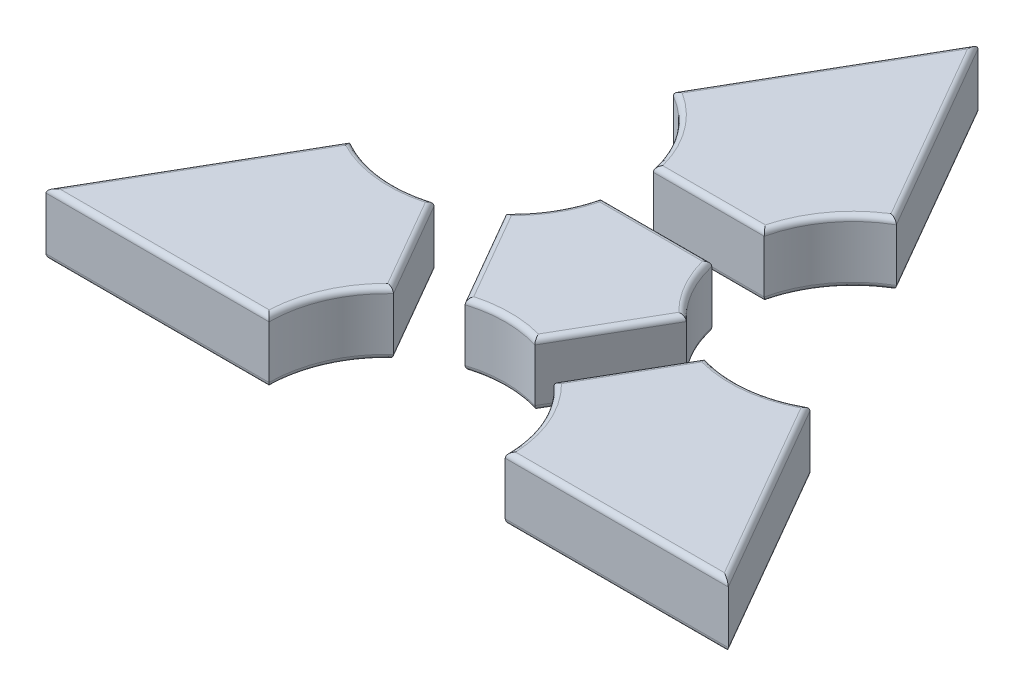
ISO-10303-21;
HEADER;
FILE_DESCRIPTION(('STEP AP214'),'2;1');
FILE_NAME('part.step','',(''),(''),'','','');
FILE_SCHEMA(('AUTOMOTIVE_DESIGN { 1 0 10303 214 1 1 1 1 }'));
ENDSEC;
DATA;
#1=APPLICATION_CONTEXT('core data for automotive mechanical design processes');
#2=APPLICATION_PROTOCOL_DEFINITION('international standard','automotive_design',2000,#1);
#3=PRODUCT_CONTEXT('',#1,'mechanical');
#4=PRODUCT('Part','Part','',(#3));
#5=PRODUCT_RELATED_PRODUCT_CATEGORY('part','',(#4));
#6=PRODUCT_DEFINITION_FORMATION('','',#4);
#7=PRODUCT_DEFINITION_CONTEXT('part definition',#1,'design');
#8=PRODUCT_DEFINITION('design','',#6,#7);
#9=PRODUCT_DEFINITION_SHAPE('','',#8);
#10=(LENGTH_UNIT() NAMED_UNIT(*) SI_UNIT(.MILLI.,.METRE.));
#11=(NAMED_UNIT(*) PLANE_ANGLE_UNIT() SI_UNIT($,.RADIAN.));
#12=(NAMED_UNIT(*) SI_UNIT($,.STERADIAN.) SOLID_ANGLE_UNIT());
#13=UNCERTAINTY_MEASURE_WITH_UNIT(LENGTH_MEASURE(1.E-05),#10,'distance_accuracy_value','');
#14=(GEOMETRIC_REPRESENTATION_CONTEXT(3) GLOBAL_UNCERTAINTY_ASSIGNED_CONTEXT((#13)) GLOBAL_UNIT_ASSIGNED_CONTEXT((#10,
#11,#12)) REPRESENTATION_CONTEXT('',''));
#15=CARTESIAN_POINT('',(0.,0.,0.));
#16=DIRECTION('',(0.,0.,1.));
#17=DIRECTION('',(1.,0.,0.));
#18=AXIS2_PLACEMENT_3D('',#15,#16,#17);
#19=CARTESIAN_POINT('',(-32.5,12.,-18.7638837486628));
#20=DIRECTION('',(0.,-1.,0.));
#21=DIRECTION('',(0.,0.,-1.));
#22=AXIS2_PLACEMENT_3D('',#19,#20,#21);
#23=CYLINDRICAL_SURFACE('',#22,22.5);
#24=DIRECTION('',(0.,-1.,0.));
#25=VECTOR('',#24,1.);
#26=CARTESIAN_POINT('',(-17.2011674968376,12.,-2.2655285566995));
#27=LINE('',#26,#25);
#28=CARTESIAN_POINT('',(-17.2011674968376,11.,-2.2655285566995));
#29=VERTEX_POINT('',#28);
#30=CARTESIAN_POINT('',(-17.2011674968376,1.,-2.2655285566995));
#31=VERTEX_POINT('',#30);
#32=EDGE_CURVE('E157',#29,#31,#27,.T.);
#33=ORIENTED_EDGE('',*,*,#32,.F.);
#34=CARTESIAN_POINT('',(-32.5,11.,-18.7638837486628));
#35=DIRECTION('',(0.,1.,0.));
#36=DIRECTION('',(0.,0.,1.));
#37=AXIS2_PLACEMENT_3D('',#34,#35,#36);
#38=CIRCLE('',#37,22.5);
#39=CARTESIAN_POINT('',(-10.5625890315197,11.,-13.7638837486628));
#40=VERTEX_POINT('',#39);
#41=EDGE_CURVE('E190',#29,#40,#38,.T.);
#42=ORIENTED_EDGE('',*,*,#41,.T.);
#43=DIRECTION('',(0.,-1.,0.));
#44=VECTOR('',#43,1.);
#45=CARTESIAN_POINT('',(-10.5625890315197,12.,-13.7638837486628));
#46=LINE('',#45,#44);
#47=CARTESIAN_POINT('',(-10.5625890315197,1.,-13.7638837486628));
#48=VERTEX_POINT('',#47);
#49=EDGE_CURVE('E360',#40,#48,#46,.T.);
#50=ORIENTED_EDGE('',*,*,#49,.T.);
#51=CARTESIAN_POINT('',(-32.5,1.,-18.7638837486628));
#52=DIRECTION('',(0.,1.,0.));
#53=DIRECTION('',(0.,0.,1.));
#54=AXIS2_PLACEMENT_3D('',#51,#52,#53);
#55=CIRCLE('',#54,22.5);
#56=EDGE_CURVE('E188',#48,#31,#55,.F.);
#57=ORIENTED_EDGE('',*,*,#56,.T.);
#58=EDGE_LOOP('',(#33,#42,#50,#57));
#59=FACE_BOUND('',#58,.T.);
#60=ADVANCED_FACE('F44',(#59),#23,.F.);
#61=CARTESIAN_POINT('',(-6.63857846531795,12.,16.0294123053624));
#62=DIRECTION('',(0.866025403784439,0.,-0.5));
#63=DIRECTION('',(-0.5,0.,-0.866025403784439));
#64=AXIS2_PLACEMENT_3D('',#61,#62,#63);
#65=PLANE('',#64);
#66=DIRECTION('',(0.,-1.,0.));
#67=VECTOR('',#66,1.);
#68=CARTESIAN_POINT('',(-6.63857846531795,12.,16.0294123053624));
#69=LINE('',#68,#67);
#70=CARTESIAN_POINT('',(-6.63857846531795,11.,16.0294123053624));
#71=VERTEX_POINT('',#70);
#72=CARTESIAN_POINT('',(-6.63857846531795,1.,16.0294123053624));
#73=VERTEX_POINT('',#72);
#74=EDGE_CURVE('E323',#71,#73,#69,.T.);
#75=ORIENTED_EDGE('',*,*,#74,.F.);
#76=DIRECTION('',(0.5,0.,0.866025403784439));
#77=VECTOR('',#76,1.);
#78=CARTESIAN_POINT('',(-17.2011674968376,11.,-2.2655285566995));
#79=LINE('',#78,#77);
#80=EDGE_CURVE('E186',#71,#29,#79,.F.);
#81=ORIENTED_EDGE('',*,*,#80,.T.);
#82=ORIENTED_EDGE('',*,*,#32,.T.);
#83=DIRECTION('',(0.5,0.,0.866025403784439));
#84=VECTOR('',#83,1.);
#85=CARTESIAN_POINT('',(-6.63857846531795,1.,16.0294123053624));
#86=LINE('',#85,#84);
#87=EDGE_CURVE('E183',#31,#73,#86,.T.);
#88=ORIENTED_EDGE('',*,*,#87,.T.);
#89=EDGE_LOOP('',(#75,#81,#82,#88));
#90=FACE_BOUND('',#89,.T.);
#91=ADVANCED_FACE('F322',(#90),#65,.F.);
#92=CARTESIAN_POINT('',(0.,12.,37.5277674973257));
#93=DIRECTION('',(0.,-1.,0.));
#94=DIRECTION('',(0.,0.,-1.));
#95=AXIS2_PLACEMENT_3D('',#92,#93,#94);
#96=CYLINDRICAL_SURFACE('',#95,22.5);
#97=DIRECTION('',(0.,-1.,0.));
#98=VECTOR('',#97,1.);
#99=CARTESIAN_POINT('',(6.63857846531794,12.,16.0294123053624));
#100=LINE('',#99,#98);
#101=CARTESIAN_POINT('',(6.63857846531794,11.,16.0294123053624));
#102=VERTEX_POINT('',#101);
#103=CARTESIAN_POINT('',(6.63857846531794,1.,16.0294123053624));
#104=VERTEX_POINT('',#103);
#105=EDGE_CURVE('E331',#102,#104,#100,.T.);
#106=ORIENTED_EDGE('',*,*,#105,.F.);
#107=CARTESIAN_POINT('',(0.,11.,37.5277674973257));
#108=DIRECTION('',(0.,1.,0.));
#109=DIRECTION('',(0.,0.,1.));
#110=AXIS2_PLACEMENT_3D('',#107,#108,#109);
#111=CIRCLE('',#110,22.5);
#112=EDGE_CURVE('E181',#102,#71,#111,.T.);
#113=ORIENTED_EDGE('',*,*,#112,.T.);
#114=ORIENTED_EDGE('',*,*,#74,.T.);
#115=CARTESIAN_POINT('',(0.,1.,37.5277674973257));
#116=DIRECTION('',(0.,1.,0.));
#117=DIRECTION('',(0.,0.,1.));
#118=AXIS2_PLACEMENT_3D('',#115,#116,#117);
#119=CIRCLE('',#118,22.5);
#120=EDGE_CURVE('E179',#73,#104,#119,.F.);
#121=ORIENTED_EDGE('',*,*,#120,.T.);
#122=EDGE_LOOP('',(#106,#113,#114,#121));
#123=FACE_BOUND('',#122,.T.);
#124=ADVANCED_FACE('F328',(#123),#96,.F.);
#125=CARTESIAN_POINT('',(17.2011674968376,12.,-2.26552855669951));
#126=DIRECTION('',(-0.866025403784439,0.,-0.5));
#127=DIRECTION('',(-0.5,0.,0.866025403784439));
#128=AXIS2_PLACEMENT_3D('',#125,#126,#127);
#129=PLANE('',#128);
#130=DIRECTION('',(0.,-1.,0.));
#131=VECTOR('',#130,1.);
#132=CARTESIAN_POINT('',(17.2011674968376,12.,-2.26552855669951));
#133=LINE('',#132,#131);
#134=CARTESIAN_POINT('',(17.2011674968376,11.,-2.26552855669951));
#135=VERTEX_POINT('',#134);
#136=CARTESIAN_POINT('',(17.2011674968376,1.,-2.26552855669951));
#137=VERTEX_POINT('',#136);
#138=EDGE_CURVE('E334',#135,#137,#133,.T.);
#139=ORIENTED_EDGE('',*,*,#138,.F.);
#140=DIRECTION('',(0.5,0.,-0.866025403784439));
#141=VECTOR('',#140,1.);
#142=CARTESIAN_POINT('',(6.63857846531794,11.,16.0294123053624));
#143=LINE('',#142,#141);
#144=EDGE_CURVE('E177',#135,#102,#143,.F.);
#145=ORIENTED_EDGE('',*,*,#144,.T.);
#146=ORIENTED_EDGE('',*,*,#105,.T.);
#147=DIRECTION('',(0.5,0.,-0.866025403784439));
#148=VECTOR('',#147,1.);
#149=CARTESIAN_POINT('',(17.2011674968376,1.,-2.26552855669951));
#150=LINE('',#149,#148);
#151=EDGE_CURVE('E175',#104,#137,#150,.T.);
#152=ORIENTED_EDGE('',*,*,#151,.T.);
#153=EDGE_LOOP('',(#139,#145,#146,#152));
#154=FACE_BOUND('',#153,.T.);
#155=ADVANCED_FACE('F374',(#154),#129,.F.);
#156=CARTESIAN_POINT('',(32.5,12.,-18.7638837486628));
#157=DIRECTION('',(0.,-1.,0.));
#158=DIRECTION('',(0.,0.,-1.));
#159=AXIS2_PLACEMENT_3D('',#156,#157,#158);
#160=CYLINDRICAL_SURFACE('',#159,22.5);
#161=DIRECTION('',(0.,-1.,0.));
#162=VECTOR('',#161,1.);
#163=CARTESIAN_POINT('',(10.5625890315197,12.,-13.7638837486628));
#164=LINE('',#163,#162);
#165=CARTESIAN_POINT('',(10.5625890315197,11.,-13.7638837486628));
#166=VERTEX_POINT('',#165);
#167=CARTESIAN_POINT('',(10.5625890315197,1.,-13.7638837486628));
#168=VERTEX_POINT('',#167);
#169=EDGE_CURVE('E358',#166,#168,#164,.T.);
#170=ORIENTED_EDGE('',*,*,#169,.F.);
#171=CARTESIAN_POINT('',(32.5,11.,-18.7638837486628));
#172=DIRECTION('',(0.,1.,0.));
#173=DIRECTION('',(0.,0.,1.));
#174=AXIS2_PLACEMENT_3D('',#171,#172,#173);
#175=CIRCLE('',#174,22.5);
#176=EDGE_CURVE('E173',#166,#135,#175,.T.);
#177=ORIENTED_EDGE('',*,*,#176,.T.);
#178=ORIENTED_EDGE('',*,*,#138,.T.);
#179=CARTESIAN_POINT('',(32.5,1.,-18.7638837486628));
#180=DIRECTION('',(0.,1.,0.));
#181=DIRECTION('',(0.,0.,1.));
#182=AXIS2_PLACEMENT_3D('',#179,#180,#181);
#183=CIRCLE('',#182,22.5);
#184=EDGE_CURVE('E171',#137,#168,#183,.F.);
#185=ORIENTED_EDGE('',*,*,#184,.T.);
#186=EDGE_LOOP('',(#170,#177,#178,#185));
#187=FACE_BOUND('',#186,.T.);
#188=ADVANCED_FACE('F361',(#187),#160,.F.);
#189=CARTESIAN_POINT('',(-10.5625890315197,12.,-13.7638837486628));
#190=DIRECTION('',(0.,0.,1.));
#191=DIRECTION('',(1.,0.,0.));
#192=AXIS2_PLACEMENT_3D('',#189,#190,#191);
#193=PLANE('',#192);
#194=ORIENTED_EDGE('',*,*,#49,.F.);
#195=DIRECTION('',(-1.,0.,0.));
#196=VECTOR('',#195,1.);
#197=CARTESIAN_POINT('',(10.5625890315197,11.,-13.7638837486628));
#198=LINE('',#197,#196);
#199=EDGE_CURVE('E144',#40,#166,#198,.F.);
#200=ORIENTED_EDGE('',*,*,#199,.T.);
#201=ORIENTED_EDGE('',*,*,#169,.T.);
#202=DIRECTION('',(-1.,0.,0.));
#203=VECTOR('',#202,1.);
#204=CARTESIAN_POINT('',(-10.5625890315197,1.,-13.7638837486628));
#205=LINE('',#204,#203);
#206=EDGE_CURVE('E163',#168,#48,#205,.T.);
#207=ORIENTED_EDGE('',*,*,#206,.T.);
#208=EDGE_LOOP('',(#194,#200,#201,#207));
#209=FACE_BOUND('',#208,.T.);
#210=ADVANCED_FACE('F357',(#209),#193,.F.);
#211=CARTESIAN_POINT('',(-32.5,12.,-18.7638837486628));
#212=DIRECTION('',(0.,1.,0.));
#213=DIRECTION('',(0.,0.,1.));
#214=AXIS2_PLACEMENT_3D('',#211,#212,#213);
#215=PLANE('',#214);
#216=CARTESIAN_POINT('',(32.5,12.,-18.7638837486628));
#217=DIRECTION('',(0.,1.,0.));
#218=DIRECTION('',(0.,0.,1.));
#219=AXIS2_PLACEMENT_3D('',#216,#217,#218);
#220=CIRCLE('',#219,23.5);
#221=CARTESIAN_POINT('',(15.9432798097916,12.,-2.08680317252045));
#222=VERTEX_POINT('',#221);
#223=CARTESIAN_POINT('',(9.77886446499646,12.,-12.7638837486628));
#224=VERTEX_POINT('',#223);
#225=EDGE_CURVE('E161',#222,#224,#220,.F.);
#226=ORIENTED_EDGE('',*,*,#225,.T.);
#227=DIRECTION('',(-1.,0.,0.));
#228=VECTOR('',#227,1.);
#229=CARTESIAN_POINT('',(-10.5625890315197,12.,-12.7638837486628));
#230=LINE('',#229,#228);
#231=CARTESIAN_POINT('',(-9.77886446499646,12.,-12.7638837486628));
#232=VERTEX_POINT('',#231);
#233=EDGE_CURVE('E142',#224,#232,#230,.T.);
#234=ORIENTED_EDGE('',*,*,#233,.T.);
#235=CARTESIAN_POINT('',(-32.5,12.,-18.7638837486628));
#236=DIRECTION('',(0.,1.,0.));
#237=DIRECTION('',(0.,0.,1.));
#238=AXIS2_PLACEMENT_3D('',#235,#236,#237);
#239=CIRCLE('',#238,23.5);
#240=CARTESIAN_POINT('',(-15.9432798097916,12.,-2.08680317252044));
#241=VERTEX_POINT('',#240);
#242=EDGE_CURVE('E150',#232,#241,#239,.F.);
#243=ORIENTED_EDGE('',*,*,#242,.T.);
#244=DIRECTION('',(0.5,0.,0.866025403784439));
#245=VECTOR('',#244,1.);
#246=CARTESIAN_POINT('',(-5.77255306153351,12.,15.5294123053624));
#247=LINE('',#246,#245);
#248=CARTESIAN_POINT('',(-6.16441534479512,12.,14.8506869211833));
#249=VERTEX_POINT('',#248);
#250=EDGE_CURVE('E156',#241,#249,#247,.T.);
#251=ORIENTED_EDGE('',*,*,#250,.T.);
#252=CARTESIAN_POINT('',(0.,12.,37.5277674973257));
#253=DIRECTION('',(0.,1.,0.));
#254=DIRECTION('',(0.,0.,1.));
#255=AXIS2_PLACEMENT_3D('',#252,#253,#254);
#256=CIRCLE('',#255,23.5);
#257=CARTESIAN_POINT('',(6.16441534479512,12.,14.8506869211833));
#258=VERTEX_POINT('',#257);
#259=EDGE_CURVE('E339',#249,#258,#256,.F.);
#260=ORIENTED_EDGE('',*,*,#259,.T.);
#261=DIRECTION('',(0.5,0.,-0.866025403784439));
#262=VECTOR('',#261,1.);
#263=CARTESIAN_POINT('',(16.3351420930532,12.,-2.76552855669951));
#264=LINE('',#263,#262);
#265=EDGE_CURVE('E166',#258,#222,#264,.T.);
#266=ORIENTED_EDGE('',*,*,#265,.T.);
#267=EDGE_LOOP('',(#226,#234,#243,#251,#260,#266));
#268=FACE_BOUND('',#267,.T.);
#269=ADVANCED_FACE('F159',(#268),#215,.T.);
#270=CARTESIAN_POINT('',(-32.5,0.,-18.7638837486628));
#271=DIRECTION('',(0.,1.,0.));
#272=DIRECTION('',(0.,0.,1.));
#273=AXIS2_PLACEMENT_3D('',#270,#271,#272);
#274=PLANE('',#273);
#275=CARTESIAN_POINT('',(0.,0.,37.5277674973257));
#276=DIRECTION('',(0.,1.,0.));
#277=DIRECTION('',(0.,0.,1.));
#278=AXIS2_PLACEMENT_3D('',#275,#276,#277);
#279=CIRCLE('',#278,23.5);
#280=CARTESIAN_POINT('',(6.16441534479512,0.,14.8506869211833));
#281=VERTEX_POINT('',#280);
#282=CARTESIAN_POINT('',(-6.16441534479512,0.,14.8506869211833));
#283=VERTEX_POINT('',#282);
#284=EDGE_CURVE('E57',#281,#283,#279,.T.);
#285=ORIENTED_EDGE('',*,*,#284,.T.);
#286=DIRECTION('',(0.5,0.,0.866025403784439));
#287=VECTOR('',#286,1.);
#288=CARTESIAN_POINT('',(-27.3038475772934,0.,-21.7638837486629));
#289=LINE('',#288,#287);
#290=CARTESIAN_POINT('',(-15.9432798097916,0.,-2.08680317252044));
#291=VERTEX_POINT('',#290);
#292=EDGE_CURVE('E12',#283,#291,#289,.F.);
#293=ORIENTED_EDGE('',*,*,#292,.T.);
#294=CARTESIAN_POINT('',(-32.5,0.,-18.7638837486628));
#295=DIRECTION('',(0.,1.,0.));
#296=DIRECTION('',(0.,0.,1.));
#297=AXIS2_PLACEMENT_3D('',#294,#295,#296);
#298=CIRCLE('',#297,23.5);
#299=CARTESIAN_POINT('',(-9.77886446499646,0.,-12.7638837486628));
#300=VERTEX_POINT('',#299);
#301=EDGE_CURVE('E192',#291,#300,#298,.T.);
#302=ORIENTED_EDGE('',*,*,#301,.T.);
#303=DIRECTION('',(-1.,0.,0.));
#304=VECTOR('',#303,1.);
#305=CARTESIAN_POINT('',(-32.5,0.,-12.7638837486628));
#306=LINE('',#305,#304);
#307=CARTESIAN_POINT('',(9.77886446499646,0.,-12.7638837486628));
#308=VERTEX_POINT('',#307);
#309=EDGE_CURVE('E194',#300,#308,#306,.F.);
#310=ORIENTED_EDGE('',*,*,#309,.T.);
#311=CARTESIAN_POINT('',(32.5,0.,-18.7638837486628));
#312=DIRECTION('',(0.,1.,0.));
#313=DIRECTION('',(0.,0.,1.));
#314=AXIS2_PLACEMENT_3D('',#311,#312,#313);
#315=CIRCLE('',#314,23.5);
#316=CARTESIAN_POINT('',(15.9432798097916,0.,-2.08680317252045));
#317=VERTEX_POINT('',#316);
#318=EDGE_CURVE('E196',#308,#317,#315,.T.);
#319=ORIENTED_EDGE('',*,*,#318,.T.);
#320=DIRECTION('',(0.5,0.,-0.866025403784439));
#321=VECTOR('',#320,1.);
#322=CARTESIAN_POINT('',(11.0538475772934,0.,6.3819418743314));
#323=LINE('',#322,#321);
#324=EDGE_CURVE('E68',#317,#281,#323,.F.);
#325=ORIENTED_EDGE('',*,*,#324,.T.);
#326=EDGE_LOOP('',(#285,#293,#302,#310,#319,#325));
#327=FACE_BOUND('',#326,.T.);
#328=ADVANCED_FACE('F251',(#327),#274,.F.);
#329=CARTESIAN_POINT('',(0.,11.,37.5277674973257));
#330=DIRECTION('',(0.,1.,0.));
#331=DIRECTION('',(0.,0.,1.));
#332=AXIS2_PLACEMENT_3D('',#329,#330,#331);
#333=TOROIDAL_SURFACE('',#332,23.5,1.);
#334=CARTESIAN_POINT('',(-6.63857846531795,11.,16.0294123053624));
#335=CARTESIAN_POINT('',(-6.63857952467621,11.0238443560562,16.0294152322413));
#336=CARTESIAN_POINT('',(-6.63817972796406,11.0476751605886,16.0283958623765));
#337=CARTESIAN_POINT('',(-6.63659243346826,11.0951263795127,16.0243501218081));
#338=CARTESIAN_POINT('',(-6.63540537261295,11.1187469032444,16.0213248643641));
#339=CARTESIAN_POINT('',(-6.63070629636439,11.1887203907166,16.0093526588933));
#340=CARTESIAN_POINT('',(-6.62605592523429,11.2345336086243,15.99750804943));
#341=CARTESIAN_POINT('',(-6.61400932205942,11.323229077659,15.9668635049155));
#342=CARTESIAN_POINT('',(-6.60661811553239,11.3661165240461,15.9480762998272));
#343=CARTESIAN_POINT('',(-6.58946176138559,11.4482776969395,15.9045391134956));
#344=CARTESIAN_POINT('',(-6.57969331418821,11.4875462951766,15.8797808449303));
#345=CARTESIAN_POINT('',(-6.55735810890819,11.5647579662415,15.8232821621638));
#346=CARTESIAN_POINT('',(-6.54463410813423,11.6023679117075,15.7911516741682));
#347=CARTESIAN_POINT('',(-6.51735414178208,11.6724685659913,15.7224280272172));
#348=CARTESIAN_POINT('',(-6.5027972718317,11.7049567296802,15.6858326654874));
#349=CARTESIAN_POINT('',(-6.46493842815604,11.7790209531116,15.5909030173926));
#350=CARTESIAN_POINT('',(-6.44077522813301,11.8175481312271,15.5305208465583));
#351=CARTESIAN_POINT('',(-6.39024230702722,11.8835055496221,15.4047664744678));
#352=CARTESIAN_POINT('',(-6.36386818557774,11.9109129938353,15.3393843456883));
#353=CARTESIAN_POINT('',(-6.30945931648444,11.9550352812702,15.2050775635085));
#354=CARTESIAN_POINT('',(-6.28141198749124,11.9716538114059,15.1361267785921));
#355=CARTESIAN_POINT('',(-6.22455444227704,11.9939629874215,14.9969527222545));
#356=CARTESIAN_POINT('',(-6.19574631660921,11.9996809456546,14.9267330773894));
#357=CARTESIAN_POINT('',(-6.1660490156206,11.9999956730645,14.8546514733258));
#358=CARTESIAN_POINT('',(-6.16523220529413,12.0000000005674,14.8526691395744));
#359=CARTESIAN_POINT('',(-6.16441534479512,12.,14.8506869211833));
#360=B_SPLINE_CURVE_WITH_KNOTS('',3,(#334,#335,#336,#337,#338,#339,#340,#341,#342,#343,#344,
#345,#346,#347,#348,#349,#350,#351,#352,#353,#354,#355,#356,#357,#358,#359),.UNSPECIFIED.,.F.,
.F.,(4,2,2,2,2,2,2,2,2,2,2,2,4),(0.,0.0714819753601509,0.14292431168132,0.28477927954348,
0.426375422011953,0.568169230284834,0.72084723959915,0.873600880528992,1.09916085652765,
1.32518093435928,1.55319192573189,1.78063086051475,1.78706291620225),.UNSPECIFIED.);
#361=EDGE_CURVE('E236',#71,#249,#360,.T.);
#362=ORIENTED_EDGE('',*,*,#361,.F.);
#363=ORIENTED_EDGE('',*,*,#112,.F.);
#364=CARTESIAN_POINT('',(6.63857846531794,11.,16.0294123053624));
#365=CARTESIAN_POINT('',(6.6385795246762,11.0238443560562,16.0294152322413));
#366=CARTESIAN_POINT('',(6.63817972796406,11.0476751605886,16.0283958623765));
#367=CARTESIAN_POINT('',(6.63659243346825,11.0951263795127,16.0243501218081));
#368=CARTESIAN_POINT('',(6.63540537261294,11.1187469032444,16.0213248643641));
#369=CARTESIAN_POINT('',(6.63070629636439,11.1887203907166,16.0093526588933));
#370=CARTESIAN_POINT('',(6.62605592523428,11.2345336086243,15.99750804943));
#371=CARTESIAN_POINT('',(6.61400932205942,11.323229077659,15.9668635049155));
#372=CARTESIAN_POINT('',(6.60661811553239,11.3661165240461,15.9480762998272));
#373=CARTESIAN_POINT('',(6.58946176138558,11.4482776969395,15.9045391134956));
#374=CARTESIAN_POINT('',(6.57969331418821,11.4875462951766,15.8797808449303));
#375=CARTESIAN_POINT('',(6.55735810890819,11.5647579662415,15.8232821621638));
#376=CARTESIAN_POINT('',(6.54463410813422,11.6023679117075,15.7911516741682));
#377=CARTESIAN_POINT('',(6.51735414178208,11.6724685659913,15.7224280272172));
#378=CARTESIAN_POINT('',(6.50279727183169,11.7049567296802,15.6858326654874));
#379=CARTESIAN_POINT('',(6.46493842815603,11.7790209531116,15.5909030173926));
#380=CARTESIAN_POINT('',(6.440775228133,11.8175481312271,15.5305208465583));
#381=CARTESIAN_POINT('',(6.39024230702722,11.8835055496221,15.4047664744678));
#382=CARTESIAN_POINT('',(6.36386818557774,11.9109129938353,15.3393843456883));
#383=CARTESIAN_POINT('',(6.30945931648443,11.9550352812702,15.2050775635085));
#384=CARTESIAN_POINT('',(6.28141198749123,11.9716538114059,15.1361267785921));
#385=CARTESIAN_POINT('',(6.22455444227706,11.9939629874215,14.9969527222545));
#386=CARTESIAN_POINT('',(6.19574631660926,11.9996809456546,14.9267330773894));
#387=CARTESIAN_POINT('',(6.1660490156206,11.9999956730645,14.8546514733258));
#388=CARTESIAN_POINT('',(6.16523220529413,12.0000000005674,14.8526691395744));
#389=CARTESIAN_POINT('',(6.16441534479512,12.,14.8506869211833));
#390=B_SPLINE_CURVE_WITH_KNOTS('',3,(#364,#365,#366,#367,#368,#369,#370,#371,#372,#373,#374,
#375,#376,#377,#378,#379,#380,#381,#382,#383,#384,#385,#386,#387,#388,#389),.UNSPECIFIED.,.F.,
.F.,(4,2,2,2,2,2,2,2,2,2,2,2,4),(0.,0.0714819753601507,0.14292431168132,0.28477927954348,
0.426375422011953,0.568169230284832,0.720847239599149,0.873600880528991,1.09916085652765,
1.32518093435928,1.55319192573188,1.78063086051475,1.78706291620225),.UNSPECIFIED.);
#391=EDGE_CURVE('E242',#258,#102,#390,.F.);
#392=ORIENTED_EDGE('',*,*,#391,.F.);
#393=ORIENTED_EDGE('',*,*,#259,.F.);
#394=EDGE_LOOP('',(#362,#363,#392,#393));
#395=FACE_BOUND('',#394,.T.);
#396=ADVANCED_FACE('F247',(#395),#333,.T.);
#397=CARTESIAN_POINT('',(11.0538475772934,11.,6.38194187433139));
#398=DIRECTION('',(-0.5,0.,0.866025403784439));
#399=DIRECTION('',(0.866025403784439,0.,0.5));
#400=AXIS2_PLACEMENT_3D('',#397,#398,#399);
#401=CYLINDRICAL_SURFACE('',#400,1.);
#402=ORIENTED_EDGE('',*,*,#391,.T.);
#403=ORIENTED_EDGE('',*,*,#144,.F.);
#404=CARTESIAN_POINT('',(17.2011674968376,11.,-2.26552855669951));
#405=CARTESIAN_POINT('',(17.2011705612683,11.0238443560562,-2.2655291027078));
#406=CARTESIAN_POINT('',(17.2000878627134,11.0476751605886,-2.26536565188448));
#407=CARTESIAN_POINT('',(17.1957905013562,11.0951263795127,-2.26471741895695));
#408=CARTESIAN_POINT('',(17.192577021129,11.1187469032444,-2.26423281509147));
#409=CARTESIAN_POINT('',(17.1798592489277,11.1887203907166,-2.26231623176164));
#410=CARTESIAN_POINT('',(17.1672763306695,11.2345336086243,-2.26042126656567));
#411=CARTESIAN_POINT('',(17.1347140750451,11.323229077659,-2.25553165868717));
#412=CARTESIAN_POINT('',(17.114748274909,11.3661165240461,-2.25253902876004));
#413=CARTESIAN_POINT('',(17.0684657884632,11.4482776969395,-2.24562827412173));
#414=CARTESIAN_POINT('',(17.0421402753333,11.4875462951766,-2.24170886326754));
#415=CARTESIAN_POINT('',(16.9820433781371,11.5647579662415,-2.23280237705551));
#416=CARTESIAN_POINT('',(16.9478555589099,11.6023679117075,-2.22775644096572));
#417=CARTESIAN_POINT('',(16.8746991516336,11.6724685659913,-2.21701976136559));
#418=CARTESIAN_POINT('',(16.8357282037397,11.7049567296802,-2.21132869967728));
#419=CARTESIAN_POINT('',(16.7345872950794,11.7790209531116,-2.19665059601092));
#420=CARTESIAN_POINT('',(16.6702132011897,11.8175481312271,-2.18738545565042));
#421=CARTESIAN_POINT('',(16.5360402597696,11.8835055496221,-2.16827106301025));
#422=CARTESIAN_POINT('',(16.4662306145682,11.9109129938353,-2.1584206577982));
#423=CARTESIAN_POINT('',(16.3227130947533,11.9550352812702,-2.13838672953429));
#424=CARTESIAN_POINT('',(16.2489762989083,11.9716538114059,-2.12820103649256));
#425=CARTESIAN_POINT('',(16.1000192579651,11.9939629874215,-2.107854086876));
#426=CARTESIAN_POINT('',(16.0248031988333,11.9996809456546,-2.09769283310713));
#427=CARTESIAN_POINT('',(15.9475300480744,11.9999956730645,-2.08737064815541));
#428=CARTESIAN_POINT('',(15.9454048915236,12.0000000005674,-2.0870868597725));
#429=CARTESIAN_POINT('',(15.9432798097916,12.,-2.08680317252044));
#430=B_SPLINE_CURVE_WITH_KNOTS('',3,(#404,#405,#406,#407,#408,#409,#410,#411,#412,#413,#414,
#415,#416,#417,#418,#419,#420,#421,#422,#423,#424,#425,#426,#427,#428,#429),.UNSPECIFIED.,.F.,
.F.,(4,2,2,2,2,2,2,2,2,2,2,2,4),(0.,0.0714819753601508,0.142924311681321,0.284779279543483,
0.426375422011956,0.568169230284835,0.720847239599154,0.873600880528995,1.09916085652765,
1.32518093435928,1.55319192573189,1.78063086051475,1.78706291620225),.UNSPECIFIED.);
#431=EDGE_CURVE('E222',#222,#135,#430,.F.);
#432=ORIENTED_EDGE('',*,*,#431,.F.);
#433=ORIENTED_EDGE('',*,*,#265,.F.);
#434=EDGE_LOOP('',(#402,#403,#432,#433));
#435=FACE_BOUND('',#434,.T.);
#436=ADVANCED_FACE('F231',(#435),#401,.T.);
#437=CARTESIAN_POINT('',(-27.3038475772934,11.,-21.7638837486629));
#438=DIRECTION('',(-0.5,0.,-0.866025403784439));
#439=DIRECTION('',(-0.866025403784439,0.,0.5));
#440=AXIS2_PLACEMENT_3D('',#437,#438,#439);
#441=CYLINDRICAL_SURFACE('',#440,1.);
#442=ORIENTED_EDGE('',*,*,#361,.T.);
#443=ORIENTED_EDGE('',*,*,#250,.F.);
#444=CARTESIAN_POINT('',(-17.2011674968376,11.,-2.2655285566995));
#445=CARTESIAN_POINT('',(-17.2011705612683,11.0238443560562,-2.2655291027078));
#446=CARTESIAN_POINT('',(-17.2000878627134,11.0476751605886,-2.26536565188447));
#447=CARTESIAN_POINT('',(-17.1957905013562,11.0951263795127,-2.26471741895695));
#448=CARTESIAN_POINT('',(-17.192577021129,11.1187469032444,-2.26423281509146));
#449=CARTESIAN_POINT('',(-17.1798592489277,11.1887203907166,-2.26231623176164));
#450=CARTESIAN_POINT('',(-17.1672763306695,11.2345336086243,-2.26042126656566));
#451=CARTESIAN_POINT('',(-17.1347140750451,11.323229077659,-2.25553165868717));
#452=CARTESIAN_POINT('',(-17.114748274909,11.3661165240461,-2.25253902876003));
#453=CARTESIAN_POINT('',(-17.0684657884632,11.4482776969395,-2.24562827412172));
#454=CARTESIAN_POINT('',(-17.0421402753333,11.4875462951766,-2.24170886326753));
#455=CARTESIAN_POINT('',(-16.9820433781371,11.5647579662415,-2.23280237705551));
#456=CARTESIAN_POINT('',(-16.9478555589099,11.6023679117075,-2.22775644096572));
#457=CARTESIAN_POINT('',(-16.8746991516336,11.6724685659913,-2.21701976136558));
#458=CARTESIAN_POINT('',(-16.8357282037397,11.7049567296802,-2.21132869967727));
#459=CARTESIAN_POINT('',(-16.7345872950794,11.7790209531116,-2.19665059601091));
#460=CARTESIAN_POINT('',(-16.6702132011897,11.8175481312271,-2.18738545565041));
#461=CARTESIAN_POINT('',(-16.5360402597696,11.8835055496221,-2.16827106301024));
#462=CARTESIAN_POINT('',(-16.4662306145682,11.9109129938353,-2.1584206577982));
#463=CARTESIAN_POINT('',(-16.3227130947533,11.9550352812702,-2.13838672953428));
#464=CARTESIAN_POINT('',(-16.2489762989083,11.9716538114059,-2.12820103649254));
#465=CARTESIAN_POINT('',(-16.1000192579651,11.9939629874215,-2.107854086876));
#466=CARTESIAN_POINT('',(-16.0248031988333,11.9996809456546,-2.09769283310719));
#467=CARTESIAN_POINT('',(-15.9475300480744,11.9999956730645,-2.08737064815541));
#468=CARTESIAN_POINT('',(-15.9454048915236,12.0000000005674,-2.08708685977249));
#469=CARTESIAN_POINT('',(-15.9432798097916,12.,-2.08680317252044));
#470=B_SPLINE_CURVE_WITH_KNOTS('',3,(#444,#445,#446,#447,#448,#449,#450,#451,#452,#453,#454,
#455,#456,#457,#458,#459,#460,#461,#462,#463,#464,#465,#466,#467,#468,#469),.UNSPECIFIED.,.F.,
.F.,(4,2,2,2,2,2,2,2,2,2,2,2,4),(0.,0.0714819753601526,0.142924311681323,0.284779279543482,
0.426375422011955,0.568169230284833,0.720847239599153,0.873600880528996,1.09916085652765,
1.32518093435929,1.55319192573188,1.78063086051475,1.78706291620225),.UNSPECIFIED.);
#471=EDGE_CURVE('E153',#29,#241,#470,.T.);
#472=ORIENTED_EDGE('',*,*,#471,.F.);
#473=ORIENTED_EDGE('',*,*,#80,.F.);
#474=EDGE_LOOP('',(#442,#443,#472,#473));
#475=FACE_BOUND('',#474,.T.);
#476=ADVANCED_FACE('F228',(#475),#441,.T.);
#477=CARTESIAN_POINT('',(32.5,11.,-18.7638837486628));
#478=DIRECTION('',(0.,1.,0.));
#479=DIRECTION('',(0.,0.,1.));
#480=AXIS2_PLACEMENT_3D('',#477,#478,#479);
#481=TOROIDAL_SURFACE('',#480,23.5,1.);
#482=ORIENTED_EDGE('',*,*,#431,.T.);
#483=ORIENTED_EDGE('',*,*,#176,.F.);
#484=CARTESIAN_POINT('',(10.5625890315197,11.,-13.7638837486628));
#485=CARTESIAN_POINT('',(10.5625910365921,11.0238443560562,-13.7638861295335));
#486=CARTESIAN_POINT('',(10.5619081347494,11.0476751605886,-13.763030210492));
#487=CARTESIAN_POINT('',(10.559198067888,11.0951263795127,-13.7596327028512));
#488=CARTESIAN_POINT('',(10.5571716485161,11.1187469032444,-13.7570920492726));
#489=CARTESIAN_POINT('',(10.5491529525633,11.1887203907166,-13.7470364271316));
#490=CARTESIAN_POINT('',(10.5412204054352,11.2345336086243,-13.7370867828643));
#491=CARTESIAN_POINT('',(10.5207047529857,11.323229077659,-13.7113318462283));
#492=CARTESIAN_POINT('',(10.5081301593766,11.3661165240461,-13.6955372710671));
#493=CARTESIAN_POINT('',(10.4790040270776,11.4482776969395,-13.6589108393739));
#494=CARTESIAN_POINT('',(10.4624469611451,11.4875462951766,-13.6380719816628));
#495=CARTESIAN_POINT('',(10.4246852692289,11.5647579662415,-13.5904797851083));
#496=CARTESIAN_POINT('',(10.4032214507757,11.6023679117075,-13.5633952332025));
#497=CARTESIAN_POINT('',(10.3573450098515,11.6724685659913,-13.5054082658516));
#498=CARTESIAN_POINT('',(10.332930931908,11.7049567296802,-13.4745039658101));
#499=CARTESIAN_POINT('',(10.2696488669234,11.7790209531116,-13.3942524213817));
#500=CARTESIAN_POINT('',(10.2294379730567,11.8175481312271,-13.3431353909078));
#501=CARTESIAN_POINT('',(10.1457979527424,11.8835055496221,-13.2364954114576));
#502=CARTESIAN_POINT('',(10.1023624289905,11.9109129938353,-13.18096368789));
#503=CARTESIAN_POINT('',(10.0132537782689,11.9550352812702,-13.0666908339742));
#504=CARTESIAN_POINT('',(9.967564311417,11.9716538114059,-13.0079257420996));
#505=CARTESIAN_POINT('',(9.87546481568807,11.9939629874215,-12.8890986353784));
#506=CARTESIAN_POINT('',(9.82905688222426,11.9996809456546,-12.829040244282));
#507=CARTESIAN_POINT('',(9.78148103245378,11.9999956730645,-12.7672808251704));
#508=CARTESIAN_POINT('',(9.78017268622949,12.0000000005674,-12.7655822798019));
#509=CARTESIAN_POINT('',(9.77886446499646,12.,-12.7638837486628));
#510=B_SPLINE_CURVE_WITH_KNOTS('',3,(#484,#485,#486,#487,#488,#489,#490,#491,#492,#493,#494,
#495,#496,#497,#498,#499,#500,#501,#502,#503,#504,#505,#506,#507,#508,#509),.UNSPECIFIED.,.F.,
.F.,(4,2,2,2,2,2,2,2,2,2,2,2,4),(0.,0.0714819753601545,0.142924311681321,0.284779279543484,
0.426375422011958,0.568169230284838,0.720847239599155,0.873600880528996,1.09916085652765,
1.32518093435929,1.55319192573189,1.78063086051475,1.78706291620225),.UNSPECIFIED.);
#511=EDGE_CURVE('E147',#224,#166,#510,.F.);
#512=ORIENTED_EDGE('',*,*,#511,.F.);
#513=ORIENTED_EDGE('',*,*,#225,.F.);
#514=EDGE_LOOP('',(#482,#483,#512,#513));
#515=FACE_BOUND('',#514,.T.);
#516=ADVANCED_FACE('F214',(#515),#481,.T.);
#517=CARTESIAN_POINT('',(-32.5,11.,-18.7638837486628));
#518=DIRECTION('',(0.,1.,0.));
#519=DIRECTION('',(0.,0.,1.));
#520=AXIS2_PLACEMENT_3D('',#517,#518,#519);
#521=TOROIDAL_SURFACE('',#520,23.5,1.);
#522=ORIENTED_EDGE('',*,*,#471,.T.);
#523=ORIENTED_EDGE('',*,*,#242,.F.);
#524=CARTESIAN_POINT('',(-10.5625890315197,11.,-13.7638837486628));
#525=CARTESIAN_POINT('',(-10.562591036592,11.0238443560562,-13.7638861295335));
#526=CARTESIAN_POINT('',(-10.5619081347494,11.0476751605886,-13.763030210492));
#527=CARTESIAN_POINT('',(-10.559198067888,11.0951263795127,-13.7596327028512));
#528=CARTESIAN_POINT('',(-10.5571716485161,11.1187469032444,-13.7570920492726));
#529=CARTESIAN_POINT('',(-10.5491529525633,11.1887203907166,-13.7470364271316));
#530=CARTESIAN_POINT('',(-10.5412204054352,11.2345336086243,-13.7370867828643));
#531=CARTESIAN_POINT('',(-10.5207047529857,11.323229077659,-13.7113318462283));
#532=CARTESIAN_POINT('',(-10.5081301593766,11.3661165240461,-13.6955372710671));
#533=CARTESIAN_POINT('',(-10.4790040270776,11.4482776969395,-13.6589108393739));
#534=CARTESIAN_POINT('',(-10.4624469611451,11.4875462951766,-13.6380719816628));
#535=CARTESIAN_POINT('',(-10.4246852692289,11.5647579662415,-13.5904797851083));
#536=CARTESIAN_POINT('',(-10.4032214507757,11.6023679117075,-13.5633952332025));
#537=CARTESIAN_POINT('',(-10.3573450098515,11.6724685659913,-13.5054082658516));
#538=CARTESIAN_POINT('',(-10.332930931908,11.7049567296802,-13.4745039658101));
#539=CARTESIAN_POINT('',(-10.2696488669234,11.7790209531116,-13.3942524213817));
#540=CARTESIAN_POINT('',(-10.2294379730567,11.8175481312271,-13.3431353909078));
#541=CARTESIAN_POINT('',(-10.1457979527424,11.8835055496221,-13.2364954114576));
#542=CARTESIAN_POINT('',(-10.1023624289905,11.9109129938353,-13.18096368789));
#543=CARTESIAN_POINT('',(-10.0132537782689,11.9550352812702,-13.0666908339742));
#544=CARTESIAN_POINT('',(-9.96756431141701,11.9716538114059,-13.0079257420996));
#545=CARTESIAN_POINT('',(-9.87546481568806,11.9939629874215,-12.8890986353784));
#546=CARTESIAN_POINT('',(-9.82905688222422,11.9996809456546,-12.829040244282));
#547=CARTESIAN_POINT('',(-9.78148103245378,11.9999956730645,-12.7672808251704));
#548=CARTESIAN_POINT('',(-9.78017268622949,12.0000000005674,-12.7655822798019));
#549=CARTESIAN_POINT('',(-9.77886446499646,12.,-12.7638837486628));
#550=B_SPLINE_CURVE_WITH_KNOTS('',3,(#524,#525,#526,#527,#528,#529,#530,#531,#532,#533,#534,
#535,#536,#537,#538,#539,#540,#541,#542,#543,#544,#545,#546,#547,#548,#549),.UNSPECIFIED.,.F.,
.F.,(4,2,2,2,2,2,2,2,2,2,2,2,4),(0.,0.0714819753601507,0.142924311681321,0.284779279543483,
0.42637542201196,0.568169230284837,0.720847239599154,0.873600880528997,1.09916085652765,
1.32518093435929,1.55319192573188,1.78063086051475,1.78706291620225),.UNSPECIFIED.);
#551=EDGE_CURVE('E138',#40,#232,#550,.T.);
#552=ORIENTED_EDGE('',*,*,#551,.F.);
#553=ORIENTED_EDGE('',*,*,#41,.F.);
#554=EDGE_LOOP('',(#522,#523,#552,#553));
#555=FACE_BOUND('',#554,.T.);
#556=ADVANCED_FACE('F151',(#555),#521,.T.);
#557=CARTESIAN_POINT('',(-32.5,11.,-12.7638837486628));
#558=DIRECTION('',(1.,0.,0.));
#559=DIRECTION('',(0.,0.,-1.));
#560=AXIS2_PLACEMENT_3D('',#557,#558,#559);
#561=CYLINDRICAL_SURFACE('',#560,1.);
#562=ORIENTED_EDGE('',*,*,#511,.T.);
#563=ORIENTED_EDGE('',*,*,#199,.F.);
#564=ORIENTED_EDGE('',*,*,#551,.T.);
#565=ORIENTED_EDGE('',*,*,#233,.F.);
#566=EDGE_LOOP('',(#562,#563,#564,#565));
#567=FACE_BOUND('',#566,.T.);
#568=ADVANCED_FACE('F140',(#567),#561,.T.);
#569=CARTESIAN_POINT('',(32.5,1.,-18.7638837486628));
#570=DIRECTION('',(0.,1.,0.));
#571=DIRECTION('',(0.,0.,1.));
#572=AXIS2_PLACEMENT_3D('',#569,#570,#571);
#573=TOROIDAL_SURFACE('',#572,23.5,1.);
#574=CARTESIAN_POINT('',(17.2011674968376,1.,-2.26552855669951));
#575=CARTESIAN_POINT('',(17.2011705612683,0.9761556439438,-2.2655291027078));
#576=CARTESIAN_POINT('',(17.2000878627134,0.95232483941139,-2.26536565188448));
#577=CARTESIAN_POINT('',(17.1957905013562,0.90487362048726,-2.26471741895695));
#578=CARTESIAN_POINT('',(17.192577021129,0.881253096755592,-2.26423281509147));
#579=CARTESIAN_POINT('',(17.1798592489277,0.811279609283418,-2.26231623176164));
#580=CARTESIAN_POINT('',(17.1672763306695,0.765466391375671,-2.26042126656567));
#581=CARTESIAN_POINT('',(17.1347140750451,0.67677092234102,-2.25553165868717));
#582=CARTESIAN_POINT('',(17.114748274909,0.633883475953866,-2.25253902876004));
#583=CARTESIAN_POINT('',(17.0684657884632,0.551722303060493,-2.24562827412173));
#584=CARTESIAN_POINT('',(17.0421402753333,0.512453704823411,-2.24170886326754));
#585=CARTESIAN_POINT('',(16.9820433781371,0.435242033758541,-2.23280237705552));
#586=CARTESIAN_POINT('',(16.9478555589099,0.397632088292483,-2.22775644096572));
#587=CARTESIAN_POINT('',(16.8746991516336,0.3275314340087,-2.21701976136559));
#588=CARTESIAN_POINT('',(16.8357282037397,0.295043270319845,-2.21132869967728));
#589=CARTESIAN_POINT('',(16.7345872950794,0.220979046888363,-2.19665059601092));
#590=CARTESIAN_POINT('',(16.6702132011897,0.182451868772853,-2.18738545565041));
#591=CARTESIAN_POINT('',(16.5360402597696,0.116494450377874,-2.16827106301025));
#592=CARTESIAN_POINT('',(16.4662306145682,0.0890870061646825,-2.15842065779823));
#593=CARTESIAN_POINT('',(16.3227130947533,0.0449647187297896,-2.13838672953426));
#594=CARTESIAN_POINT('',(16.2489762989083,0.028346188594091,-2.12820103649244));
#595=CARTESIAN_POINT('',(16.1000192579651,0.00603701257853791,-2.10785408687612));
#596=CARTESIAN_POINT('',(16.0248031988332,0.000319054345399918,-2.09769283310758));
#597=CARTESIAN_POINT('',(15.9475300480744,4.3269355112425E-06,-2.08737064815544));
#598=CARTESIAN_POINT('',(15.9454048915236,-5.67358935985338E-10,-2.08708685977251));
#599=CARTESIAN_POINT('',(15.9432798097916,0.,-2.08680317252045));
#600=B_SPLINE_CURVE_WITH_KNOTS('',3,(#574,#575,#576,#577,#578,#579,#580,#581,#582,#583,#584,
#585,#586,#587,#588,#589,#590,#591,#592,#593,#594,#595,#596,#597,#598,#599),.UNSPECIFIED.,.F.,
.F.,(4,2,2,2,2,2,2,2,2,2,2,2,4),(0.,0.0714819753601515,0.14292431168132,0.284779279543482,
0.426375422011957,0.568169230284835,0.72084723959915,0.873600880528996,1.09916085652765,
1.32518093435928,1.55319192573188,1.78063086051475,1.78706291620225),.UNSPECIFIED.);
#601=EDGE_CURVE('E293',#317,#137,#600,.F.);
#602=ORIENTED_EDGE('',*,*,#601,.F.);
#603=ORIENTED_EDGE('',*,*,#318,.F.);
#604=CARTESIAN_POINT('',(10.5625890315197,1.,-13.7638837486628));
#605=CARTESIAN_POINT('',(10.5625910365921,0.9761556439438,-13.7638861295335));
#606=CARTESIAN_POINT('',(10.5619081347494,0.95232483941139,-13.763030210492));
#607=CARTESIAN_POINT('',(10.559198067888,0.90487362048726,-13.7596327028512));
#608=CARTESIAN_POINT('',(10.5571716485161,0.881253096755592,-13.7570920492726));
#609=CARTESIAN_POINT('',(10.5491529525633,0.811279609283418,-13.7470364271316));
#610=CARTESIAN_POINT('',(10.5412204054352,0.765466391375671,-13.7370867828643));
#611=CARTESIAN_POINT('',(10.5207047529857,0.67677092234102,-13.7113318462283));
#612=CARTESIAN_POINT('',(10.5081301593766,0.633883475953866,-13.6955372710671));
#613=CARTESIAN_POINT('',(10.4790040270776,0.551722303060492,-13.6589108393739));
#614=CARTESIAN_POINT('',(10.4624469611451,0.512453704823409,-13.6380719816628));
#615=CARTESIAN_POINT('',(10.4246852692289,0.435242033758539,-13.5904797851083));
#616=CARTESIAN_POINT('',(10.4032214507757,0.397632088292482,-13.5633952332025));
#617=CARTESIAN_POINT('',(10.3573450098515,0.327531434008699,-13.5054082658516));
#618=CARTESIAN_POINT('',(10.332930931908,0.295043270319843,-13.4745039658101));
#619=CARTESIAN_POINT('',(10.2696488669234,0.220979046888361,-13.3942524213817));
#620=CARTESIAN_POINT('',(10.2294379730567,0.182451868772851,-13.3431353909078));
#621=CARTESIAN_POINT('',(10.1457979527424,0.116494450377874,-13.2364954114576));
#622=CARTESIAN_POINT('',(10.1023624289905,0.0890870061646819,-13.18096368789));
#623=CARTESIAN_POINT('',(10.0132537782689,0.0449647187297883,-13.0666908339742));
#624=CARTESIAN_POINT('',(9.967564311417,0.0283461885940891,-13.0079257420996));
#625=CARTESIAN_POINT('',(9.87546481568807,0.00603701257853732,-12.8890986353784));
#626=CARTESIAN_POINT('',(9.82905688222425,0.000319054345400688,-12.829040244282));
#627=CARTESIAN_POINT('',(9.78148103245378,4.3269355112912E-06,-12.7672808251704));
#628=CARTESIAN_POINT('',(9.78017268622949,-5.67358908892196E-10,-12.7655822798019));
#629=CARTESIAN_POINT('',(9.77886446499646,0.,-12.7638837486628));
#630=B_SPLINE_CURVE_WITH_KNOTS('',3,(#604,#605,#606,#607,#608,#609,#610,#611,#612,#613,#614,
#615,#616,#617,#618,#619,#620,#621,#622,#623,#624,#625,#626,#627,#628,#629),.UNSPECIFIED.,.F.,
.F.,(4,2,2,2,2,2,2,2,2,2,2,2,4),(0.,0.0714819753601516,0.142924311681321,0.284779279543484,
0.426375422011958,0.568169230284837,0.720847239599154,0.873600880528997,1.09916085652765,
1.32518093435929,1.55319192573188,1.78063086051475,1.78706291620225),.UNSPECIFIED.);
#631=EDGE_CURVE('E49',#168,#308,#630,.T.);
#632=ORIENTED_EDGE('',*,*,#631,.F.);
#633=ORIENTED_EDGE('',*,*,#184,.F.);
#634=EDGE_LOOP('',(#602,#603,#632,#633));
#635=FACE_BOUND('',#634,.T.);
#636=ADVANCED_FACE('F46',(#635),#573,.T.);
#637=CARTESIAN_POINT('',(-10.5625890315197,1.,-12.7638837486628));
#638=DIRECTION('',(-1.,0.,0.));
#639=DIRECTION('',(0.,0.,1.));
#640=AXIS2_PLACEMENT_3D('',#637,#638,#639);
#641=CYLINDRICAL_SURFACE('',#640,1.);
#642=ORIENTED_EDGE('',*,*,#631,.T.);
#643=ORIENTED_EDGE('',*,*,#309,.F.);
#644=CARTESIAN_POINT('',(-10.5625890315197,1.,-13.7638837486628));
#645=CARTESIAN_POINT('',(-10.5625910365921,0.9761556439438,-13.7638861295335));
#646=CARTESIAN_POINT('',(-10.5619081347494,0.95232483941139,-13.763030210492));
#647=CARTESIAN_POINT('',(-10.559198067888,0.90487362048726,-13.7596327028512));
#648=CARTESIAN_POINT('',(-10.5571716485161,0.881253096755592,-13.7570920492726));
#649=CARTESIAN_POINT('',(-10.5491529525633,0.811279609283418,-13.7470364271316));
#650=CARTESIAN_POINT('',(-10.5412204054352,0.76546639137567,-13.7370867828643));
#651=CARTESIAN_POINT('',(-10.5207047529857,0.676770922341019,-13.7113318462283));
#652=CARTESIAN_POINT('',(-10.5081301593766,0.633883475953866,-13.6955372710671));
#653=CARTESIAN_POINT('',(-10.4790040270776,0.551722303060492,-13.6589108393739));
#654=CARTESIAN_POINT('',(-10.4624469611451,0.512453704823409,-13.6380719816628));
#655=CARTESIAN_POINT('',(-10.4246852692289,0.435242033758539,-13.5904797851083));
#656=CARTESIAN_POINT('',(-10.4032214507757,0.397632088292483,-13.5633952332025));
#657=CARTESIAN_POINT('',(-10.3573450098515,0.3275314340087,-13.5054082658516));
#658=CARTESIAN_POINT('',(-10.332930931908,0.295043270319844,-13.4745039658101));
#659=CARTESIAN_POINT('',(-10.2696488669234,0.220979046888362,-13.3942524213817));
#660=CARTESIAN_POINT('',(-10.2294379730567,0.182451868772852,-13.3431353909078));
#661=CARTESIAN_POINT('',(-10.1457979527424,0.116494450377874,-13.2364954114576));
#662=CARTESIAN_POINT('',(-10.1023624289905,0.089087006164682,-13.18096368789));
#663=CARTESIAN_POINT('',(-10.0132537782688,0.0449647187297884,-13.0666908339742));
#664=CARTESIAN_POINT('',(-9.96756431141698,0.0283461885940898,-13.0079257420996));
#665=CARTESIAN_POINT('',(-9.8754648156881,0.00603701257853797,-12.8890986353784));
#666=CARTESIAN_POINT('',(-9.82905688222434,0.000319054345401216,-12.8290402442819));
#667=CARTESIAN_POINT('',(-9.78148103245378,4.32693551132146E-06,-12.7672808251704));
#668=CARTESIAN_POINT('',(-9.78017268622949,-5.67358892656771E-10,-12.7655822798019));
#669=CARTESIAN_POINT('',(-9.77886446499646,0.,-12.7638837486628));
#670=B_SPLINE_CURVE_WITH_KNOTS('',3,(#644,#645,#646,#647,#648,#649,#650,#651,#652,#653,#654,
#655,#656,#657,#658,#659,#660,#661,#662,#663,#664,#665,#666,#667,#668,#669),.UNSPECIFIED.,.F.,
.F.,(4,2,2,2,2,2,2,2,2,2,2,2,4),(0.,0.0714819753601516,0.142924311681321,0.284779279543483,
0.426375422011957,0.568169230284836,0.720847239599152,0.873600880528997,1.09916085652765,
1.32518093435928,1.55319192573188,1.78063086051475,1.78706291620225),.UNSPECIFIED.);
#671=EDGE_CURVE('E277',#48,#300,#670,.T.);
#672=ORIENTED_EDGE('',*,*,#671,.F.);
#673=ORIENTED_EDGE('',*,*,#206,.F.);
#674=EDGE_LOOP('',(#642,#643,#672,#673));
#675=FACE_BOUND('',#674,.T.);
#676=ADVANCED_FACE('F288',(#675),#641,.T.);
#677=CARTESIAN_POINT('',(16.3351420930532,1.,-2.76552855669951));
#678=DIRECTION('',(0.5,0.,-0.866025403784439));
#679=DIRECTION('',(-0.866025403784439,0.,-0.5));
#680=AXIS2_PLACEMENT_3D('',#677,#678,#679);
#681=CYLINDRICAL_SURFACE('',#680,1.);
#682=ORIENTED_EDGE('',*,*,#601,.T.);
#683=ORIENTED_EDGE('',*,*,#151,.F.);
#684=CARTESIAN_POINT('',(6.63857846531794,1.,16.0294123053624));
#685=CARTESIAN_POINT('',(6.6385795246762,0.9761556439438,16.0294152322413));
#686=CARTESIAN_POINT('',(6.63817972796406,0.95232483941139,16.0283958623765));
#687=CARTESIAN_POINT('',(6.63659243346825,0.904873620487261,16.0243501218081));
#688=CARTESIAN_POINT('',(6.63540537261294,0.881253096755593,16.0213248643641));
#689=CARTESIAN_POINT('',(6.63070629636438,0.81127960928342,16.0093526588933));
#690=CARTESIAN_POINT('',(6.62605592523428,0.765466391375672,15.99750804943));
#691=CARTESIAN_POINT('',(6.61400932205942,0.676770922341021,15.9668635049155));
#692=CARTESIAN_POINT('',(6.60661811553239,0.633883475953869,15.9480762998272));
#693=CARTESIAN_POINT('',(6.58946176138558,0.551722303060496,15.9045391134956));
#694=CARTESIAN_POINT('',(6.57969331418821,0.512453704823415,15.8797808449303));
#695=CARTESIAN_POINT('',(6.55735810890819,0.435242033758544,15.8232821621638));
#696=CARTESIAN_POINT('',(6.54463410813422,0.397632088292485,15.7911516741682));
#697=CARTESIAN_POINT('',(6.51735414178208,0.3275314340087,15.7224280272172));
#698=CARTESIAN_POINT('',(6.50279727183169,0.295043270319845,15.6858326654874));
#699=CARTESIAN_POINT('',(6.46493842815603,0.220979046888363,15.5909030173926));
#700=CARTESIAN_POINT('',(6.44077522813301,0.182451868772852,15.5305208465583));
#701=CARTESIAN_POINT('',(6.39024230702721,0.116494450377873,15.4047664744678));
#702=CARTESIAN_POINT('',(6.36386818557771,0.0890870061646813,15.3393843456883));
#703=CARTESIAN_POINT('',(6.30945931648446,0.044964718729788,15.2050775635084));
#704=CARTESIAN_POINT('',(6.28141198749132,0.0283461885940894,15.1361267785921));
#705=CARTESIAN_POINT('',(6.22455444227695,0.00603701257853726,14.9969527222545));
#706=CARTESIAN_POINT('',(6.19574631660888,0.000319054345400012,14.9267330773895));
#707=CARTESIAN_POINT('',(6.16604901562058,4.32693551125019E-06,14.8546514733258));
#708=CARTESIAN_POINT('',(6.16523220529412,-5.67358931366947E-10,14.8526691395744));
#709=CARTESIAN_POINT('',(6.16441534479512,0.,14.8506869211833));
#710=B_SPLINE_CURVE_WITH_KNOTS('',3,(#684,#685,#686,#687,#688,#689,#690,#691,#692,#693,#694,
#695,#696,#697,#698,#699,#700,#701,#702,#703,#704,#705,#706,#707,#708,#709),.UNSPECIFIED.,.F.,
.F.,(4,2,2,2,2,2,2,2,2,2,2,2,4),(0.,0.0714819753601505,0.14292431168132,0.28477927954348,
0.426375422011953,0.568169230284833,0.72084723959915,0.873600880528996,1.09916085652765,
1.32518093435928,1.55319192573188,1.78063086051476,1.78706291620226),.UNSPECIFIED.);
#711=EDGE_CURVE('E270',#281,#104,#710,.F.);
#712=ORIENTED_EDGE('',*,*,#711,.F.);
#713=ORIENTED_EDGE('',*,*,#324,.F.);
#714=EDGE_LOOP('',(#682,#683,#712,#713));
#715=FACE_BOUND('',#714,.T.);
#716=ADVANCED_FACE('F285',(#715),#681,.T.);
#717=CARTESIAN_POINT('',(-32.5,1.,-18.7638837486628));
#718=DIRECTION('',(0.,1.,0.));
#719=DIRECTION('',(0.,0.,1.));
#720=AXIS2_PLACEMENT_3D('',#717,#718,#719);
#721=TOROIDAL_SURFACE('',#720,23.5,1.);
#722=ORIENTED_EDGE('',*,*,#671,.T.);
#723=ORIENTED_EDGE('',*,*,#301,.F.);
#724=CARTESIAN_POINT('',(-17.2011674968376,1.,-2.2655285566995));
#725=CARTESIAN_POINT('',(-17.2011705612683,0.9761556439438,-2.2655291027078));
#726=CARTESIAN_POINT('',(-17.2000878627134,0.95232483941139,-2.26536565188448));
#727=CARTESIAN_POINT('',(-17.1957905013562,0.90487362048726,-2.26471741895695));
#728=CARTESIAN_POINT('',(-17.192577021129,0.881253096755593,-2.26423281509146));
#729=CARTESIAN_POINT('',(-17.1798592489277,0.811279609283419,-2.26231623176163));
#730=CARTESIAN_POINT('',(-17.1672763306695,0.765466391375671,-2.26042126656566));
#731=CARTESIAN_POINT('',(-17.1347140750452,0.67677092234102,-2.25553165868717));
#732=CARTESIAN_POINT('',(-17.114748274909,0.633883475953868,-2.25253902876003));
#733=CARTESIAN_POINT('',(-17.0684657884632,0.551722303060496,-2.24562827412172));
#734=CARTESIAN_POINT('',(-17.0421402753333,0.512453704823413,-2.24170886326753));
#735=CARTESIAN_POINT('',(-16.9820433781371,0.435242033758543,-2.23280237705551));
#736=CARTESIAN_POINT('',(-16.9478555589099,0.397632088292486,-2.22775644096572));
#737=CARTESIAN_POINT('',(-16.8746991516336,0.327531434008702,-2.21701976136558));
#738=CARTESIAN_POINT('',(-16.8357282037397,0.295043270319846,-2.21132869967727));
#739=CARTESIAN_POINT('',(-16.7345872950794,0.220979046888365,-2.19665059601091));
#740=CARTESIAN_POINT('',(-16.6702132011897,0.182451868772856,-2.18738545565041));
#741=CARTESIAN_POINT('',(-16.5360402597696,0.116494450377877,-2.16827106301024));
#742=CARTESIAN_POINT('',(-16.4662306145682,0.0890870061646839,-2.15842065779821));
#743=CARTESIAN_POINT('',(-16.3227130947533,0.0449647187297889,-2.13838672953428));
#744=CARTESIAN_POINT('',(-16.2489762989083,0.0283461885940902,-2.12820103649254));
#745=CARTESIAN_POINT('',(-16.1000192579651,0.00603701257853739,-2.10785408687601));
#746=CARTESIAN_POINT('',(-16.0248031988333,0.000319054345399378,-2.0976928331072));
#747=CARTESIAN_POINT('',(-15.9475300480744,4.32693551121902E-06,-2.08737064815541));
#748=CARTESIAN_POINT('',(-15.9454048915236,-5.67358945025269E-10,-2.08708685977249));
#749=CARTESIAN_POINT('',(-15.9432798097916,0.,-2.08680317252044));
#750=B_SPLINE_CURVE_WITH_KNOTS('',3,(#724,#725,#726,#727,#728,#729,#730,#731,#732,#733,#734,
#735,#736,#737,#738,#739,#740,#741,#742,#743,#744,#745,#746,#747,#748,#749),.UNSPECIFIED.,.F.,
.F.,(4,2,2,2,2,2,2,2,2,2,2,2,4),(0.,0.0714819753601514,0.142924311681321,0.284779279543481,
0.426375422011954,0.568169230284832,0.720847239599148,0.873600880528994,1.09916085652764,
1.32518093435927,1.55319192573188,1.78063086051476,1.78706291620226),.UNSPECIFIED.);
#751=EDGE_CURVE('E278',#31,#291,#750,.T.);
#752=ORIENTED_EDGE('',*,*,#751,.F.);
#753=ORIENTED_EDGE('',*,*,#56,.F.);
#754=EDGE_LOOP('',(#722,#723,#752,#753));
#755=FACE_BOUND('',#754,.T.);
#756=ADVANCED_FACE('F259',(#755),#721,.T.);
#757=CARTESIAN_POINT('',(0.,1.,37.5277674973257));
#758=DIRECTION('',(0.,1.,0.));
#759=DIRECTION('',(0.,0.,1.));
#760=AXIS2_PLACEMENT_3D('',#757,#758,#759);
#761=TOROIDAL_SURFACE('',#760,23.5,1.);
#762=ORIENTED_EDGE('',*,*,#711,.T.);
#763=ORIENTED_EDGE('',*,*,#120,.F.);
#764=CARTESIAN_POINT('',(-6.63857846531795,1.,16.0294123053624));
#765=CARTESIAN_POINT('',(-6.63857952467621,0.9761556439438,16.0294152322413));
#766=CARTESIAN_POINT('',(-6.63817972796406,0.95232483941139,16.0283958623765));
#767=CARTESIAN_POINT('',(-6.63659243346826,0.90487362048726,16.0243501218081));
#768=CARTESIAN_POINT('',(-6.63540537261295,0.881253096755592,16.0213248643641));
#769=CARTESIAN_POINT('',(-6.63070629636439,0.811279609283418,16.0093526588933));
#770=CARTESIAN_POINT('',(-6.62605592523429,0.765466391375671,15.99750804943));
#771=CARTESIAN_POINT('',(-6.61400932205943,0.67677092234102,15.9668635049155));
#772=CARTESIAN_POINT('',(-6.60661811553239,0.633883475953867,15.9480762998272));
#773=CARTESIAN_POINT('',(-6.58946176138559,0.551722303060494,15.9045391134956));
#774=CARTESIAN_POINT('',(-6.57969331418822,0.512453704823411,15.8797808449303));
#775=CARTESIAN_POINT('',(-6.5573581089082,0.435242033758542,15.8232821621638));
#776=CARTESIAN_POINT('',(-6.54463410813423,0.397632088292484,15.7911516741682));
#777=CARTESIAN_POINT('',(-6.51735414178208,0.3275314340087,15.7224280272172));
#778=CARTESIAN_POINT('',(-6.5027972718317,0.295043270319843,15.6858326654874));
#779=CARTESIAN_POINT('',(-6.46493842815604,0.220979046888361,15.5909030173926));
#780=CARTESIAN_POINT('',(-6.44077522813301,0.182451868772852,15.5305208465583));
#781=CARTESIAN_POINT('',(-6.39024230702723,0.116494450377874,15.4047664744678));
#782=CARTESIAN_POINT('',(-6.36386818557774,0.0890870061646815,15.3393843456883));
#783=CARTESIAN_POINT('',(-6.30945931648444,0.0449647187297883,15.2050775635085));
#784=CARTESIAN_POINT('',(-6.28141198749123,0.0283461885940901,15.1361267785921));
#785=CARTESIAN_POINT('',(-6.22455444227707,0.00603701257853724,14.9969527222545));
#786=CARTESIAN_POINT('',(-6.19574631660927,0.000319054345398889,14.9267330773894));
#787=CARTESIAN_POINT('',(-6.16604901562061,4.32693551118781E-06,14.8546514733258));
#788=CARTESIAN_POINT('',(-6.16523220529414,-5.67358962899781E-10,14.8526691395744));
#789=CARTESIAN_POINT('',(-6.16441534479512,0.,14.8506869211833));
#790=B_SPLINE_CURVE_WITH_KNOTS('',3,(#764,#765,#766,#767,#768,#769,#770,#771,#772,#773,#774,
#775,#776,#777,#778,#779,#780,#781,#782,#783,#784,#785,#786,#787,#788,#789),.UNSPECIFIED.,.F.,
.F.,(4,2,2,2,2,2,2,2,2,2,2,2,4),(0.,0.0714819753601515,0.142924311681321,0.284779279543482,
0.426375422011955,0.568169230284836,0.72084723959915,0.873600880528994,1.09916085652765,
1.32518093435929,1.55319192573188,1.78063086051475,1.78706291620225),.UNSPECIFIED.);
#791=EDGE_CURVE('E264',#283,#73,#790,.F.);
#792=ORIENTED_EDGE('',*,*,#791,.F.);
#793=ORIENTED_EDGE('',*,*,#284,.F.);
#794=EDGE_LOOP('',(#762,#763,#792,#793));
#795=FACE_BOUND('',#794,.T.);
#796=ADVANCED_FACE('F253',(#795),#761,.T.);
#797=CARTESIAN_POINT('',(-5.77255306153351,1.,15.5294123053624));
#798=DIRECTION('',(0.5,0.,0.866025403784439));
#799=DIRECTION('',(0.866025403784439,0.,-0.5));
#800=AXIS2_PLACEMENT_3D('',#797,#798,#799);
#801=CYLINDRICAL_SURFACE('',#800,1.);
#802=ORIENTED_EDGE('',*,*,#751,.T.);
#803=ORIENTED_EDGE('',*,*,#292,.F.);
#804=ORIENTED_EDGE('',*,*,#791,.T.);
#805=ORIENTED_EDGE('',*,*,#87,.F.);
#806=EDGE_LOOP('',(#802,#803,#804,#805));
#807=FACE_BOUND('',#806,.T.);
#808=ADVANCED_FACE('F258',(#807),#801,.T.);
#809=CLOSED_SHELL('',(#60,#91,#124,#155,#188,#210,#269,#328,#396,#436,#476,#516,#556,#568,#636,
#676,#716,#756,#796,#808));
#810=MANIFOLD_SOLID_BREP('B2',#809);
#811=CARTESIAN_POINT('',(21.25,12.,-38.2494553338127));
#812=DIRECTION('',(-0.866025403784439,0.,0.5));
#813=DIRECTION('',(0.5,0.,0.866025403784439));
#814=AXIS2_PLACEMENT_3D('',#811,#812,#813);
#815=PLANE('',#814);
#816=DIRECTION('',(0.,-1.,0.));
#817=VECTOR('',#816,1.);
#818=CARTESIAN_POINT('',(0.,12.,-75.0555349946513));
#819=LINE('',#818,#817);
#820=CARTESIAN_POINT('',(0.,11.,-75.0555349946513));
#821=VERTEX_POINT('',#820);
#822=CARTESIAN_POINT('',(0.,1.,-75.0555349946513));
#823=VERTEX_POINT('',#822);
#824=EDGE_CURVE('E632',#821,#823,#819,.T.);
#825=ORIENTED_EDGE('',*,*,#824,.F.);
#826=DIRECTION('',(-0.5,0.,-0.866025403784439));
#827=VECTOR('',#826,1.);
#828=CARTESIAN_POINT('',(21.25,11.,-38.2494553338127));
#829=LINE('',#828,#827);
#830=CARTESIAN_POINT('',(21.25,11.,-38.2494553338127));
#831=VERTEX_POINT('',#830);
#832=EDGE_CURVE('E661',#821,#831,#829,.F.);
#833=ORIENTED_EDGE('',*,*,#832,.T.);
#834=DIRECTION('',(0.,-1.,0.));
#835=VECTOR('',#834,1.);
#836=CARTESIAN_POINT('',(21.25,12.,-38.2494553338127));
#837=LINE('',#836,#835);
#838=CARTESIAN_POINT('',(21.25,1.,-38.2494553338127));
#839=VERTEX_POINT('',#838);
#840=EDGE_CURVE('E706',#831,#839,#837,.T.);
#841=ORIENTED_EDGE('',*,*,#840,.T.);
#842=DIRECTION('',(-0.5,0.,-0.866025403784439));
#843=VECTOR('',#842,1.);
#844=CARTESIAN_POINT('',(21.25,1.,-38.2494553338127));
#845=LINE('',#844,#843);
#846=EDGE_CURVE('E659',#839,#823,#845,.T.);
#847=ORIENTED_EDGE('',*,*,#846,.T.);
#848=EDGE_LOOP('',(#825,#833,#841,#847));
#849=FACE_BOUND('',#848,.T.);
#850=ADVANCED_FACE('F530',(#849),#815,.F.);
#851=CARTESIAN_POINT('',(0.,12.,-75.0555349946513));
#852=DIRECTION('',(0.866025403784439,0.,0.5));
#853=DIRECTION('',(0.5,0.,-0.866025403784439));
#854=AXIS2_PLACEMENT_3D('',#851,#852,#853);
#855=PLANE('',#854);
#856=DIRECTION('',(0.,-1.,0.));
#857=VECTOR('',#856,1.);
#858=CARTESIAN_POINT('',(-21.25,12.,-38.2494553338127));
#859=LINE('',#858,#857);
#860=CARTESIAN_POINT('',(-21.25,11.,-38.2494553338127));
#861=VERTEX_POINT('',#860);
#862=CARTESIAN_POINT('',(-21.25,1.,-38.2494553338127));
#863=VERTEX_POINT('',#862);
#864=EDGE_CURVE('E853',#861,#863,#859,.T.);
#865=ORIENTED_EDGE('',*,*,#864,.F.);
#866=DIRECTION('',(-0.5,0.,0.866025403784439));
#867=VECTOR('',#866,1.);
#868=CARTESIAN_POINT('',(0.,11.,-75.0555349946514));
#869=LINE('',#868,#867);
#870=EDGE_CURVE('E657',#861,#821,#869,.F.);
#871=ORIENTED_EDGE('',*,*,#870,.T.);
#872=ORIENTED_EDGE('',*,*,#824,.T.);
#873=DIRECTION('',(-0.5,0.,0.866025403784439));
#874=VECTOR('',#873,1.);
#875=CARTESIAN_POINT('',(0.,1.,-75.0555349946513));
#876=LINE('',#875,#874);
#877=EDGE_CURVE('E654',#823,#863,#876,.T.);
#878=ORIENTED_EDGE('',*,*,#877,.T.);
#879=EDGE_LOOP('',(#865,#871,#872,#878));
#880=FACE_BOUND('',#879,.T.);
#881=ADVANCED_FACE('F748',(#880),#855,.F.);
#882=CARTESIAN_POINT('',(-32.5,12.,-18.7638837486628));
#883=DIRECTION('',(0.,-1.,0.));
#884=DIRECTION('',(0.,0.,-1.));
#885=AXIS2_PLACEMENT_3D('',#882,#883,#884);
#886=CYLINDRICAL_SURFACE('',#885,22.5);
#887=DIRECTION('',(0.,-1.,0.));
#888=VECTOR('',#887,1.);
#889=CARTESIAN_POINT('',(-10.5625890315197,12.,-23.7638837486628));
#890=LINE('',#889,#888);
#891=CARTESIAN_POINT('',(-10.5625890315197,11.,-23.7638837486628));
#892=VERTEX_POINT('',#891);
#893=CARTESIAN_POINT('',(-10.5625890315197,1.,-23.7638837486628));
#894=VERTEX_POINT('',#893);
#895=EDGE_CURVE('E856',#892,#894,#890,.T.);
#896=ORIENTED_EDGE('',*,*,#895,.F.);
#897=CARTESIAN_POINT('',(-32.5,11.,-18.7638837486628));
#898=DIRECTION('',(0.,1.,0.));
#899=DIRECTION('',(0.,0.,1.));
#900=AXIS2_PLACEMENT_3D('',#897,#898,#899);
#901=CIRCLE('',#900,22.5);
#902=EDGE_CURVE('E652',#892,#861,#901,.T.);
#903=ORIENTED_EDGE('',*,*,#902,.T.);
#904=ORIENTED_EDGE('',*,*,#864,.T.);
#905=CARTESIAN_POINT('',(-32.5,1.,-18.7638837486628));
#906=DIRECTION('',(0.,1.,0.));
#907=DIRECTION('',(0.,0.,1.));
#908=AXIS2_PLACEMENT_3D('',#905,#906,#907);
#909=CIRCLE('',#908,22.5);
#910=EDGE_CURVE('E650',#863,#894,#909,.F.);
#911=ORIENTED_EDGE('',*,*,#910,.T.);
#912=EDGE_LOOP('',(#896,#903,#904,#911));
#913=FACE_BOUND('',#912,.T.);
#914=ADVANCED_FACE('F753',(#913),#886,.F.);
#915=CARTESIAN_POINT('',(-10.5625890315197,12.,-23.7638837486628));
#916=DIRECTION('',(0.,0.,-1.));
#917=DIRECTION('',(-1.,0.,0.));
#918=AXIS2_PLACEMENT_3D('',#915,#916,#917);
#919=PLANE('',#918);
#920=DIRECTION('',(0.,-1.,0.));
#921=VECTOR('',#920,1.);
#922=CARTESIAN_POINT('',(10.5625890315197,12.,-23.7638837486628));
#923=LINE('',#922,#921);
#924=CARTESIAN_POINT('',(10.5625890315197,11.,-23.7638837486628));
#925=VERTEX_POINT('',#924);
#926=CARTESIAN_POINT('',(10.5625890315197,1.,-23.7638837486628));
#927=VERTEX_POINT('',#926);
#928=EDGE_CURVE('E859',#925,#927,#923,.T.);
#929=ORIENTED_EDGE('',*,*,#928,.F.);
#930=DIRECTION('',(1.,0.,0.));
#931=VECTOR('',#930,1.);
#932=CARTESIAN_POINT('',(-10.5625890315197,11.,-23.7638837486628));
#933=LINE('',#932,#931);
#934=EDGE_CURVE('E648',#925,#892,#933,.F.);
#935=ORIENTED_EDGE('',*,*,#934,.T.);
#936=ORIENTED_EDGE('',*,*,#895,.T.);
#937=DIRECTION('',(1.,0.,0.));
#938=VECTOR('',#937,1.);
#939=CARTESIAN_POINT('',(-10.5625890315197,1.,-23.7638837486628));
#940=LINE('',#939,#938);
#941=EDGE_CURVE('E646',#894,#927,#940,.T.);
#942=ORIENTED_EDGE('',*,*,#941,.T.);
#943=EDGE_LOOP('',(#929,#935,#936,#942));
#944=FACE_BOUND('',#943,.T.);
#945=ADVANCED_FACE('F760',(#944),#919,.F.);
#946=CARTESIAN_POINT('',(32.5,12.,-18.7638837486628));
#947=DIRECTION('',(0.,-1.,0.));
#948=DIRECTION('',(0.,0.,-1.));
#949=AXIS2_PLACEMENT_3D('',#946,#947,#948);
#950=CYLINDRICAL_SURFACE('',#949,22.5);
#951=ORIENTED_EDGE('',*,*,#840,.F.);
#952=CARTESIAN_POINT('',(32.5,11.,-18.7638837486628));
#953=DIRECTION('',(0.,1.,0.));
#954=DIRECTION('',(0.,0.,1.));
#955=AXIS2_PLACEMENT_3D('',#952,#953,#954);
#956=CIRCLE('',#955,22.5);
#957=EDGE_CURVE('E619',#831,#925,#956,.T.);
#958=ORIENTED_EDGE('',*,*,#957,.T.);
#959=ORIENTED_EDGE('',*,*,#928,.T.);
#960=CARTESIAN_POINT('',(32.5,1.,-18.7638837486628));
#961=DIRECTION('',(0.,1.,0.));
#962=DIRECTION('',(0.,0.,1.));
#963=AXIS2_PLACEMENT_3D('',#960,#961,#962);
#964=CIRCLE('',#963,22.5);
#965=EDGE_CURVE('E638',#927,#839,#964,.F.);
#966=ORIENTED_EDGE('',*,*,#965,.T.);
#967=EDGE_LOOP('',(#951,#958,#959,#966));
#968=FACE_BOUND('',#967,.T.);
#969=ADVANCED_FACE('F764',(#968),#950,.F.);
#970=CARTESIAN_POINT('',(-32.5,12.,-18.7638837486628));
#971=DIRECTION('',(0.,1.,0.));
#972=DIRECTION('',(0.,0.,1.));
#973=AXIS2_PLACEMENT_3D('',#970,#971,#972);
#974=PLANE('',#973);
#975=DIRECTION('',(1.,0.,0.));
#976=VECTOR('',#975,1.);
#977=CARTESIAN_POINT('',(10.5625890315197,12.,-24.7638837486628));
#978=LINE('',#977,#976);
#979=CARTESIAN_POINT('',(-9.77886446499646,12.,-24.7638837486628));
#980=VERTEX_POINT('',#979);
#981=CARTESIAN_POINT('',(9.77886446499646,12.,-24.7638837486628));
#982=VERTEX_POINT('',#981);
#983=EDGE_CURVE('E636',#980,#982,#978,.T.);
#984=ORIENTED_EDGE('',*,*,#983,.T.);
#985=CARTESIAN_POINT('',(32.5,12.,-18.7638837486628));
#986=DIRECTION('',(0.,1.,0.));
#987=DIRECTION('',(0.,0.,1.));
#988=AXIS2_PLACEMENT_3D('',#985,#986,#987);
#989=CIRCLE('',#988,23.5);
#990=CARTESIAN_POINT('',(19.8946177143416,12.,-38.5970463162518));
#991=VERTEX_POINT('',#990);
#992=EDGE_CURVE('E617',#982,#991,#989,.F.);
#993=ORIENTED_EDGE('',*,*,#992,.T.);
#994=DIRECTION('',(-0.5,0.,-0.866025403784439));
#995=VECTOR('',#994,1.);
#996=CARTESIAN_POINT('',(-0.866025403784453,12.,-74.5555349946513));
#997=LINE('',#996,#995);
#998=CARTESIAN_POINT('',(0.,12.,-73.0555349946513));
#999=VERTEX_POINT('',#998);
#1000=EDGE_CURVE('E625',#991,#999,#997,.T.);
#1001=ORIENTED_EDGE('',*,*,#1000,.T.);
#1002=DIRECTION('',(-0.5,0.,0.866025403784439));
#1003=VECTOR('',#1002,1.);
#1004=CARTESIAN_POINT('',(-20.3839745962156,12.,-37.7494553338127));
#1005=LINE('',#1004,#1003);
#1006=CARTESIAN_POINT('',(-19.8946177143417,12.,-38.5970463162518));
#1007=VERTEX_POINT('',#1006);
#1008=EDGE_CURVE('E631',#999,#1007,#1005,.T.);
#1009=ORIENTED_EDGE('',*,*,#1008,.T.);
#1010=CARTESIAN_POINT('',(-32.5,12.,-18.7638837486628));
#1011=DIRECTION('',(0.,1.,0.));
#1012=DIRECTION('',(0.,0.,1.));
#1013=AXIS2_PLACEMENT_3D('',#1010,#1011,#1012);
#1014=CIRCLE('',#1013,23.5);
#1015=EDGE_CURVE('E641',#1007,#980,#1014,.F.);
#1016=ORIENTED_EDGE('',*,*,#1015,.T.);
#1017=EDGE_LOOP('',(#984,#993,#1001,#1009,#1016));
#1018=FACE_BOUND('',#1017,.T.);
#1019=ADVANCED_FACE('F634',(#1018),#974,.T.);
#1020=CARTESIAN_POINT('',(-32.5,0.,-18.7638837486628));
#1021=DIRECTION('',(0.,1.,0.));
#1022=DIRECTION('',(0.,0.,1.));
#1023=AXIS2_PLACEMENT_3D('',#1020,#1021,#1022);
#1024=PLANE('',#1023);
#1025=CARTESIAN_POINT('',(-32.5,0.,-18.7638837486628));
#1026=DIRECTION('',(0.,1.,0.));
#1027=DIRECTION('',(0.,0.,1.));
#1028=AXIS2_PLACEMENT_3D('',#1025,#1026,#1027);
#1029=CIRCLE('',#1028,23.5);
#1030=CARTESIAN_POINT('',(-9.77886446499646,0.,-24.7638837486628));
#1031=VERTEX_POINT('',#1030);
#1032=CARTESIAN_POINT('',(-19.8946177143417,0.,-38.5970463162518));
#1033=VERTEX_POINT('',#1032);
#1034=EDGE_CURVE('E544',#1031,#1033,#1029,.T.);
#1035=ORIENTED_EDGE('',*,*,#1034,.T.);
#1036=DIRECTION('',(-0.5,0.,0.866025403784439));
#1037=VECTOR('',#1036,1.);
#1038=CARTESIAN_POINT('',(-31.6339745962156,0.,-18.2638837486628));
#1039=LINE('',#1038,#1037);
#1040=CARTESIAN_POINT('',(0.,0.,-73.0555349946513));
#1041=VERTEX_POINT('',#1040);
#1042=EDGE_CURVE('E42',#1033,#1041,#1039,.F.);
#1043=ORIENTED_EDGE('',*,*,#1042,.T.);
#1044=DIRECTION('',(-0.5,0.,-0.866025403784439));
#1045=VECTOR('',#1044,1.);
#1046=CARTESIAN_POINT('',(15.3839745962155,0.,-46.4097093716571));
#1047=LINE('',#1046,#1045);
#1048=CARTESIAN_POINT('',(19.8946177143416,0.,-38.5970463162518));
#1049=VERTEX_POINT('',#1048);
#1050=EDGE_CURVE('E663',#1041,#1049,#1047,.F.);
#1051=ORIENTED_EDGE('',*,*,#1050,.T.);
#1052=CARTESIAN_POINT('',(32.5,0.,-18.7638837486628));
#1053=DIRECTION('',(0.,1.,0.));
#1054=DIRECTION('',(0.,0.,1.));
#1055=AXIS2_PLACEMENT_3D('',#1052,#1053,#1054);
#1056=CIRCLE('',#1055,23.5);
#1057=CARTESIAN_POINT('',(9.77886446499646,0.,-24.7638837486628));
#1058=VERTEX_POINT('',#1057);
#1059=EDGE_CURVE('E665',#1049,#1058,#1056,.T.);
#1060=ORIENTED_EDGE('',*,*,#1059,.T.);
#1061=DIRECTION('',(1.,0.,0.));
#1062=VECTOR('',#1061,1.);
#1063=CARTESIAN_POINT('',(-32.5,0.,-24.7638837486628));
#1064=LINE('',#1063,#1062);
#1065=EDGE_CURVE('E555',#1058,#1031,#1064,.F.);
#1066=ORIENTED_EDGE('',*,*,#1065,.T.);
#1067=EDGE_LOOP('',(#1035,#1043,#1051,#1060,#1066));
#1068=FACE_BOUND('',#1067,.T.);
#1069=ADVANCED_FACE('F769',(#1068),#1024,.F.);
#1070=CARTESIAN_POINT('',(-32.5,11.,-18.7638837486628));
#1071=DIRECTION('',(0.,1.,0.));
#1072=DIRECTION('',(0.,0.,1.));
#1073=AXIS2_PLACEMENT_3D('',#1070,#1071,#1072);
#1074=TOROIDAL_SURFACE('',#1073,23.5,1.);
#1075=CARTESIAN_POINT('',(-10.5625890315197,11.,-23.7638837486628));
#1076=CARTESIAN_POINT('',(-10.5625910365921,11.0238443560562,-23.7638813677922));
#1077=CARTESIAN_POINT('',(-10.5619081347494,11.0476751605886,-23.7647372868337));
#1078=CARTESIAN_POINT('',(-10.559198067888,11.0951263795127,-23.7681347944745));
#1079=CARTESIAN_POINT('',(-10.5571716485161,11.1187469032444,-23.7706754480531));
#1080=CARTESIAN_POINT('',(-10.5491529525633,11.1887203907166,-23.780731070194));
#1081=CARTESIAN_POINT('',(-10.5412204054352,11.2345336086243,-23.7906807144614));
#1082=CARTESIAN_POINT('',(-10.5207047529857,11.323229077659,-23.8164356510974));
#1083=CARTESIAN_POINT('',(-10.5081301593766,11.3661165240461,-23.8322302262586));
#1084=CARTESIAN_POINT('',(-10.4790040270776,11.4482776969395,-23.8688566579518));
#1085=CARTESIAN_POINT('',(-10.4624469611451,11.4875462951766,-23.8896955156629));
#1086=CARTESIAN_POINT('',(-10.4246852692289,11.5647579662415,-23.9372877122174));
#1087=CARTESIAN_POINT('',(-10.4032214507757,11.6023679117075,-23.9643722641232));
#1088=CARTESIAN_POINT('',(-10.3573450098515,11.6724685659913,-24.022359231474));
#1089=CARTESIAN_POINT('',(-10.332930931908,11.7049567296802,-24.0532635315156));
#1090=CARTESIAN_POINT('',(-10.2696488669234,11.7790209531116,-24.133515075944));
#1091=CARTESIAN_POINT('',(-10.2294379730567,11.8175481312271,-24.1846321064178));
#1092=CARTESIAN_POINT('',(-10.1457979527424,11.8835055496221,-24.2912720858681));
#1093=CARTESIAN_POINT('',(-10.1023624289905,11.9109129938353,-24.3468038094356));
#1094=CARTESIAN_POINT('',(-10.0132537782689,11.9550352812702,-24.4610766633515));
#1095=CARTESIAN_POINT('',(-9.96756431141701,11.9716538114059,-24.519841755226));
#1096=CARTESIAN_POINT('',(-9.87546481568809,11.9939629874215,-24.6386688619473));
#1097=CARTESIAN_POINT('',(-9.82905688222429,11.9996809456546,-24.6987272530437));
#1098=CARTESIAN_POINT('',(-9.78148103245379,11.9999956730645,-24.7604866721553));
#1099=CARTESIAN_POINT('',(-9.7801726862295,12.0000000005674,-24.7621852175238));
#1100=CARTESIAN_POINT('',(-9.77886446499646,12.,-24.7638837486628));
#1101=B_SPLINE_CURVE_WITH_KNOTS('',3,(#1075,#1076,#1077,#1078,#1079,#1080,#1081,#1082,#1083,
#1084,#1085,#1086,#1087,#1088,#1089,#1090,#1091,#1092,#1093,#1094,#1095,#1096,#1097,#1098,#1099,
#1100),.UNSPECIFIED.,.F.,.F.,(4,2,2,2,2,2,2,2,2,2,2,2,4),(0.,0.0714819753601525,
0.142924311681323,0.284779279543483,0.426375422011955,0.568169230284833,0.720847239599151,
0.873600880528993,1.09916085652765,1.32518093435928,1.55319192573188,1.78063086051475,
1.78706291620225),.UNSPECIFIED.);
#1102=EDGE_CURVE('E694',#980,#892,#1101,.F.);
#1103=ORIENTED_EDGE('',*,*,#1102,.F.);
#1104=ORIENTED_EDGE('',*,*,#1015,.F.);
#1105=CARTESIAN_POINT('',(-21.25,11.,-38.2494553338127));
#1106=CARTESIAN_POINT('',(-21.250004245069,11.0224751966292,-38.2494541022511));
#1107=CARTESIAN_POINT('',(-21.2489640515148,11.0449364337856,-38.2497329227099));
#1108=CARTESIAN_POINT('',(-21.2448440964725,11.0896399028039,-38.2508366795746));
#1109=CARTESIAN_POINT('',(-21.2417659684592,11.1118822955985,-38.2516611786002));
#1110=CARTESIAN_POINT('',(-21.2296235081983,11.1776293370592,-38.2549121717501));
#1111=CARTESIAN_POINT('',(-21.2176489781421,11.2205878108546,-38.2581167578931));
#1112=CARTESIAN_POINT('',(-21.1868762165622,11.3035889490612,-38.2663366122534));
#1113=CARTESIAN_POINT('',(-21.1680973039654,11.343639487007,-38.2713467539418));
#1114=CARTESIAN_POINT('',(-21.1248331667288,11.4203685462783,-38.2828615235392));
#1115=CARTESIAN_POINT('',(-21.1003348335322,11.4570390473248,-38.2893695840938));
#1116=CARTESIAN_POINT('',(-21.0357081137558,11.5409694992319,-38.3064883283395));
#1117=CARTESIAN_POINT('',(-20.9933017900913,11.586353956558,-38.3176837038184));
#1118=CARTESIAN_POINT('',(-20.9019954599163,11.6695120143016,-38.341672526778));
#1119=CARTESIAN_POINT('',(-20.8530830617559,11.7072707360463,-38.354469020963));
#1120=CARTESIAN_POINT('',(-20.7314440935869,11.7883000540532,-38.3861242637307));
#1121=CARTESIAN_POINT('',(-20.65667452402,11.8283118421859,-38.4054543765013));
#1122=CARTESIAN_POINT('',(-20.5018874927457,11.8955033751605,-38.4451564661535));
#1123=CARTESIAN_POINT('',(-20.4218645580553,11.9226694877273,-38.4655295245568));
#1124=CARTESIAN_POINT('',(-20.2685640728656,11.9623874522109,-38.5042414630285));
#1125=CARTESIAN_POINT('',(-20.1956166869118,11.9762934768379,-38.5225339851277));
#1126=CARTESIAN_POINT('',(-20.04868949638,11.9949594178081,-38.5591104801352));
#1127=CARTESIAN_POINT('',(-19.9747121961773,11.9997385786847,-38.5773943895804));
#1128=CARTESIAN_POINT('',(-19.8987144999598,11.9999965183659,-38.5960414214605));
#1129=CARTESIAN_POINT('',(-19.8966660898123,11.9999999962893,-38.5965439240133));
#1130=CARTESIAN_POINT('',(-19.8946177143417,12.,-38.5970463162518));
#1131=B_SPLINE_CURVE_WITH_KNOTS('',3,(#1105,#1106,#1107,#1108,#1109,#1110,#1111,#1112,#1113,
#1114,#1115,#1116,#1117,#1118,#1119,#1120,#1121,#1122,#1123,#1124,#1125,#1126,#1127,#1128,#1129,
#1130),.UNSPECIFIED.,.F.,.F.,(4,2,2,2,2,2,2,2,2,2,2,2,4),(0.,0.0673734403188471,
0.134692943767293,0.268050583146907,0.401032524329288,0.534322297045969,0.722620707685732,
0.911283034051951,1.17082544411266,1.4306426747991,1.65954882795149,1.88797178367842,
1.89429921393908),.UNSPECIFIED.);
#1132=EDGE_CURVE('E700',#861,#1007,#1131,.T.);
#1133=ORIENTED_EDGE('',*,*,#1132,.F.);
#1134=ORIENTED_EDGE('',*,*,#902,.F.);
#1135=EDGE_LOOP('',(#1103,#1104,#1133,#1134));
#1136=FACE_BOUND('',#1135,.T.);
#1137=ADVANCED_FACE('F689',(#1136),#1074,.T.);
#1138=CARTESIAN_POINT('',(-31.6339745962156,11.,-18.2638837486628));
#1139=DIRECTION('',(0.5,0.,-0.866025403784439));
#1140=DIRECTION('',(-0.866025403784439,0.,-0.5));
#1141=AXIS2_PLACEMENT_3D('',#1138,#1139,#1140);
#1142=CYLINDRICAL_SURFACE('',#1141,1.);
#1143=ORIENTED_EDGE('',*,*,#1132,.T.);
#1144=ORIENTED_EDGE('',*,*,#1008,.F.);
#1145=CARTESIAN_POINT('',(0.,11.,-73.0555349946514));
#1146=DIRECTION('',(1.,0.,0.));
#1147=DIRECTION('',(0.,0.,1.));
#1148=AXIS2_PLACEMENT_3D('',#1145,#1146,#1147);
#1149=ELLIPSE('',#1148,2.,1.);
#1150=EDGE_CURVE('E628',#821,#999,#1149,.T.);
#1151=ORIENTED_EDGE('',*,*,#1150,.F.);
#1152=ORIENTED_EDGE('',*,*,#870,.F.);
#1153=EDGE_LOOP('',(#1143,#1144,#1151,#1152));
#1154=FACE_BOUND('',#1153,.T.);
#1155=ADVANCED_FACE('F687',(#1154),#1142,.T.);
#1156=CARTESIAN_POINT('',(-32.5,11.,-24.7638837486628));
#1157=DIRECTION('',(-1.,0.,0.));
#1158=DIRECTION('',(0.,0.,1.));
#1159=AXIS2_PLACEMENT_3D('',#1156,#1157,#1158);
#1160=CYLINDRICAL_SURFACE('',#1159,1.);
#1161=ORIENTED_EDGE('',*,*,#1102,.T.);
#1162=ORIENTED_EDGE('',*,*,#934,.F.);
#1163=CARTESIAN_POINT('',(10.5625890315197,11.,-23.7638837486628));
#1164=CARTESIAN_POINT('',(10.5625910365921,11.0238443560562,-23.7638813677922));
#1165=CARTESIAN_POINT('',(10.5619081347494,11.0476751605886,-23.7647372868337));
#1166=CARTESIAN_POINT('',(10.559198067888,11.0951263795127,-23.7681347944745));
#1167=CARTESIAN_POINT('',(10.5571716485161,11.1187469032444,-23.7706754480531));
#1168=CARTESIAN_POINT('',(10.5491529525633,11.1887203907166,-23.780731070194));
#1169=CARTESIAN_POINT('',(10.5412204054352,11.2345336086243,-23.7906807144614));
#1170=CARTESIAN_POINT('',(10.5207047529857,11.323229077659,-23.8164356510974));
#1171=CARTESIAN_POINT('',(10.5081301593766,11.3661165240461,-23.8322302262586));
#1172=CARTESIAN_POINT('',(10.4790040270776,11.4482776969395,-23.8688566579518));
#1173=CARTESIAN_POINT('',(10.4624469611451,11.4875462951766,-23.8896955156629));
#1174=CARTESIAN_POINT('',(10.4246852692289,11.5647579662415,-23.9372877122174));
#1175=CARTESIAN_POINT('',(10.4032214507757,11.6023679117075,-23.9643722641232));
#1176=CARTESIAN_POINT('',(10.3573450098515,11.6724685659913,-24.022359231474));
#1177=CARTESIAN_POINT('',(10.332930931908,11.7049567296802,-24.0532635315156));
#1178=CARTESIAN_POINT('',(10.2696488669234,11.7790209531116,-24.133515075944));
#1179=CARTESIAN_POINT('',(10.2294379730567,11.8175481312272,-24.1846321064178));
#1180=CARTESIAN_POINT('',(10.1457979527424,11.8835055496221,-24.2912720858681));
#1181=CARTESIAN_POINT('',(10.1023624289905,11.9109129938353,-24.3468038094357));
#1182=CARTESIAN_POINT('',(10.0132537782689,11.9550352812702,-24.4610766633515));
#1183=CARTESIAN_POINT('',(9.96756431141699,11.9716538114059,-24.519841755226));
#1184=CARTESIAN_POINT('',(9.8754648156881,11.9939629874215,-24.6386688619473));
#1185=CARTESIAN_POINT('',(9.82905688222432,11.9996809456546,-24.6987272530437));
#1186=CARTESIAN_POINT('',(9.78148103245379,11.9999956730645,-24.7604866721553));
#1187=CARTESIAN_POINT('',(9.78017268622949,12.0000000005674,-24.7621852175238));
#1188=CARTESIAN_POINT('',(9.77886446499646,12.,-24.7638837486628));
#1189=B_SPLINE_CURVE_WITH_KNOTS('',3,(#1163,#1164,#1165,#1166,#1167,#1168,#1169,#1170,#1171,
#1172,#1173,#1174,#1175,#1176,#1177,#1178,#1179,#1180,#1181,#1182,#1183,#1184,#1185,#1186,#1187,
#1188),.UNSPECIFIED.,.F.,.F.,(4,2,2,2,2,2,2,2,2,2,2,2,4),(0.,0.0714819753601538,
0.142924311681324,0.284779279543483,0.426375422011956,0.568169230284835,0.720847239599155,
0.873600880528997,1.09916085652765,1.32518093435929,1.55319192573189,1.78063086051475,
1.78706291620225),.UNSPECIFIED.);
#1190=EDGE_CURVE('E622',#982,#925,#1189,.F.);
#1191=ORIENTED_EDGE('',*,*,#1190,.F.);
#1192=ORIENTED_EDGE('',*,*,#983,.F.);
#1193=EDGE_LOOP('',(#1161,#1162,#1191,#1192));
#1194=FACE_BOUND('',#1193,.T.);
#1195=ADVANCED_FACE('F683',(#1194),#1160,.T.);
#1196=CARTESIAN_POINT('',(15.3839745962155,11.,-46.4097093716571));
#1197=DIRECTION('',(0.5,0.,0.866025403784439));
#1198=DIRECTION('',(0.866025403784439,0.,-0.5));
#1199=AXIS2_PLACEMENT_3D('',#1196,#1197,#1198);
#1200=CYLINDRICAL_SURFACE('',#1199,1.);
#1201=ORIENTED_EDGE('',*,*,#1150,.T.);
#1202=ORIENTED_EDGE('',*,*,#1000,.F.);
#1203=CARTESIAN_POINT('',(21.25,11.,-38.2494553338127));
#1204=CARTESIAN_POINT('',(21.250004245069,11.0224751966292,-38.2494541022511));
#1205=CARTESIAN_POINT('',(21.2489640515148,11.0449364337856,-38.2497329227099));
#1206=CARTESIAN_POINT('',(21.2448440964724,11.0896399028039,-38.2508366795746));
#1207=CARTESIAN_POINT('',(21.2417659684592,11.1118822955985,-38.2516611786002));
#1208=CARTESIAN_POINT('',(21.2296235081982,11.1776293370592,-38.2549121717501));
#1209=CARTESIAN_POINT('',(21.2176489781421,11.2205878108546,-38.2581167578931));
#1210=CARTESIAN_POINT('',(21.1868762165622,11.3035889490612,-38.2663366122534));
#1211=CARTESIAN_POINT('',(21.1680973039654,11.343639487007,-38.2713467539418));
#1212=CARTESIAN_POINT('',(21.1248331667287,11.4203685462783,-38.2828615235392));
#1213=CARTESIAN_POINT('',(21.1003348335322,11.4570390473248,-38.2893695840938));
#1214=CARTESIAN_POINT('',(21.0357081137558,11.5409694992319,-38.3064883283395));
#1215=CARTESIAN_POINT('',(20.9933017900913,11.586353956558,-38.3176837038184));
#1216=CARTESIAN_POINT('',(20.9019954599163,11.6695120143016,-38.341672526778));
#1217=CARTESIAN_POINT('',(20.8530830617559,11.7072707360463,-38.354469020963));
#1218=CARTESIAN_POINT('',(20.7314440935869,11.7883000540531,-38.3861242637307));
#1219=CARTESIAN_POINT('',(20.65667452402,11.8283118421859,-38.4054543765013));
#1220=CARTESIAN_POINT('',(20.5018874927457,11.8955033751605,-38.4451564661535));
#1221=CARTESIAN_POINT('',(20.4218645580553,11.9226694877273,-38.4655295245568));
#1222=CARTESIAN_POINT('',(20.2685640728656,11.9623874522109,-38.5042414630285));
#1223=CARTESIAN_POINT('',(20.1956166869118,11.9762934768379,-38.5225339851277));
#1224=CARTESIAN_POINT('',(20.04868949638,11.9949594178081,-38.5591104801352));
#1225=CARTESIAN_POINT('',(19.9747121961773,11.9997385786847,-38.5773943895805));
#1226=CARTESIAN_POINT('',(19.8987144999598,11.9999965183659,-38.5960414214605));
#1227=CARTESIAN_POINT('',(19.8966660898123,11.9999999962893,-38.5965439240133));
#1228=CARTESIAN_POINT('',(19.8946177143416,12.,-38.5970463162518));
#1229=B_SPLINE_CURVE_WITH_KNOTS('',3,(#1203,#1204,#1205,#1206,#1207,#1208,#1209,#1210,#1211,
#1212,#1213,#1214,#1215,#1216,#1217,#1218,#1219,#1220,#1221,#1222,#1223,#1224,#1225,#1226,#1227,
#1228),.UNSPECIFIED.,.F.,.F.,(4,2,2,2,2,2,2,2,2,2,2,2,4),(0.,0.0673734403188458,
0.134692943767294,0.268050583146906,0.401032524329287,0.534322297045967,0.722620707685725,
0.91128303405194,1.17082544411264,1.43064267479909,1.65954882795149,1.88797178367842,
1.89429921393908),.UNSPECIFIED.);
#1230=EDGE_CURVE('E613',#831,#991,#1229,.T.);
#1231=ORIENTED_EDGE('',*,*,#1230,.F.);
#1232=ORIENTED_EDGE('',*,*,#832,.F.);
#1233=EDGE_LOOP('',(#1201,#1202,#1231,#1232));
#1234=FACE_BOUND('',#1233,.T.);
#1235=ADVANCED_FACE('F626',(#1234),#1200,.T.);
#1236=CARTESIAN_POINT('',(32.5,11.,-18.7638837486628));
#1237=DIRECTION('',(0.,1.,0.));
#1238=DIRECTION('',(0.,0.,1.));
#1239=AXIS2_PLACEMENT_3D('',#1236,#1237,#1238);
#1240=TOROIDAL_SURFACE('',#1239,23.5,1.);
#1241=ORIENTED_EDGE('',*,*,#1190,.T.);
#1242=ORIENTED_EDGE('',*,*,#957,.F.);
#1243=ORIENTED_EDGE('',*,*,#1230,.T.);
#1244=ORIENTED_EDGE('',*,*,#992,.F.);
#1245=EDGE_LOOP('',(#1241,#1242,#1243,#1244));
#1246=FACE_BOUND('',#1245,.T.);
#1247=ADVANCED_FACE('F615',(#1246),#1240,.T.);
#1248=CARTESIAN_POINT('',(32.5,1.,-18.7638837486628));
#1249=DIRECTION('',(0.,1.,0.));
#1250=DIRECTION('',(0.,0.,1.));
#1251=AXIS2_PLACEMENT_3D('',#1248,#1249,#1250);
#1252=TOROIDAL_SURFACE('',#1251,23.5,1.);
#1253=CARTESIAN_POINT('',(21.25,1.,-38.2494553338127));
#1254=CARTESIAN_POINT('',(21.250004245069,0.977524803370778,-38.2494541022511));
#1255=CARTESIAN_POINT('',(21.2489640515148,0.955063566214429,-38.2497329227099));
#1256=CARTESIAN_POINT('',(21.2448440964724,0.910360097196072,-38.2508366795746));
#1257=CARTESIAN_POINT('',(21.2417659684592,0.888117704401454,-38.2516611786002));
#1258=CARTESIAN_POINT('',(21.2296235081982,0.822370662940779,-38.2549121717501));
#1259=CARTESIAN_POINT('',(21.2176489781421,0.779412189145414,-38.2581167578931));
#1260=CARTESIAN_POINT('',(21.1868762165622,0.696411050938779,-38.2663366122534));
#1261=CARTESIAN_POINT('',(21.1680973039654,0.656360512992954,-38.2713467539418));
#1262=CARTESIAN_POINT('',(21.1248331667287,0.579631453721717,-38.2828615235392));
#1263=CARTESIAN_POINT('',(21.1003348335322,0.542960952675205,-38.2893695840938));
#1264=CARTESIAN_POINT('',(21.0357081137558,0.45903050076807,-38.3064883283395));
#1265=CARTESIAN_POINT('',(20.9933017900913,0.413646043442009,-38.3176837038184));
#1266=CARTESIAN_POINT('',(20.9019954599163,0.33048798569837,-38.341672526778));
#1267=CARTESIAN_POINT('',(20.8530830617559,0.292729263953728,-38.354469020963));
#1268=CARTESIAN_POINT('',(20.7314440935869,0.211699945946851,-38.3861242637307));
#1269=CARTESIAN_POINT('',(20.65667452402,0.171688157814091,-38.4054543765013));
#1270=CARTESIAN_POINT('',(20.5018874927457,0.104496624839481,-38.4451564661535));
#1271=CARTESIAN_POINT('',(20.4218645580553,0.0773305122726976,-38.4655295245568));
#1272=CARTESIAN_POINT('',(20.2685640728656,0.0376125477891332,-38.5042414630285));
#1273=CARTESIAN_POINT('',(20.1956166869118,0.0237065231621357,-38.5225339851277));
#1274=CARTESIAN_POINT('',(20.04868949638,0.00504058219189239,-38.5591104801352));
#1275=CARTESIAN_POINT('',(19.9747121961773,0.000261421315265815,-38.5773943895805));
#1276=CARTESIAN_POINT('',(19.8987144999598,3.48163410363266E-06,-38.5960414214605));
#1277=CARTESIAN_POINT('',(19.8966660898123,3.71070382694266E-09,-38.5965439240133));
#1278=CARTESIAN_POINT('',(19.8946177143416,0.,-38.5970463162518));
#1279=B_SPLINE_CURVE_WITH_KNOTS('',3,(#1253,#1254,#1255,#1256,#1257,#1258,#1259,#1260,#1261,
#1262,#1263,#1264,#1265,#1266,#1267,#1268,#1269,#1270,#1271,#1272,#1273,#1274,#1275,#1276,#1277,
#1278),.UNSPECIFIED.,.F.,.F.,(4,2,2,2,2,2,2,2,2,2,2,2,4),(0.,0.0673734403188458,
0.134692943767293,0.268050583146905,0.401032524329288,0.534322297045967,0.722620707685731,
0.911283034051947,1.17082544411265,1.4306426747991,1.65954882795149,1.88797178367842,
1.89429921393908),.UNSPECIFIED.);
#1280=EDGE_CURVE('E731',#839,#1049,#1279,.T.);
#1281=ORIENTED_EDGE('',*,*,#1280,.F.);
#1282=ORIENTED_EDGE('',*,*,#965,.F.);
#1283=CARTESIAN_POINT('',(10.5625890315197,1.,-23.7638837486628));
#1284=CARTESIAN_POINT('',(10.5625910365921,0.976155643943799,-23.7638813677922));
#1285=CARTESIAN_POINT('',(10.5619081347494,0.952324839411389,-23.7647372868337));
#1286=CARTESIAN_POINT('',(10.559198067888,0.904873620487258,-23.7681347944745));
#1287=CARTESIAN_POINT('',(10.5571716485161,0.881253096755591,-23.7706754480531));
#1288=CARTESIAN_POINT('',(10.5491529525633,0.811279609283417,-23.780731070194));
#1289=CARTESIAN_POINT('',(10.5412204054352,0.76546639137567,-23.7906807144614));
#1290=CARTESIAN_POINT('',(10.5207047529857,0.67677092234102,-23.8164356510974));
#1291=CARTESIAN_POINT('',(10.5081301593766,0.633883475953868,-23.8322302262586));
#1292=CARTESIAN_POINT('',(10.4790040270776,0.551722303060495,-23.8688566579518));
#1293=CARTESIAN_POINT('',(10.4624469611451,0.512453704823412,-23.8896955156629));
#1294=CARTESIAN_POINT('',(10.4246852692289,0.43524203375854,-23.9372877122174));
#1295=CARTESIAN_POINT('',(10.4032214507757,0.397632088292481,-23.9643722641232));
#1296=CARTESIAN_POINT('',(10.3573450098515,0.327531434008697,-24.022359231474));
#1297=CARTESIAN_POINT('',(10.332930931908,0.295043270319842,-24.0532635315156));
#1298=CARTESIAN_POINT('',(10.2696488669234,0.220979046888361,-24.133515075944));
#1299=CARTESIAN_POINT('',(10.2294379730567,0.182451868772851,-24.1846321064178));
#1300=CARTESIAN_POINT('',(10.1457979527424,0.116494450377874,-24.2912720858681));
#1301=CARTESIAN_POINT('',(10.1023624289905,0.0890870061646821,-24.3468038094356));
#1302=CARTESIAN_POINT('',(10.0132537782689,0.0449647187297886,-24.4610766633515));
#1303=CARTESIAN_POINT('',(9.96756431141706,0.0283461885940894,-24.5198417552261));
#1304=CARTESIAN_POINT('',(9.87546481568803,0.00603701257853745,-24.6386688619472));
#1305=CARTESIAN_POINT('',(9.82905688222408,0.000319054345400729,-24.6987272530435));
#1306=CARTESIAN_POINT('',(9.78148103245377,4.32693551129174E-06,-24.7604866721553));
#1307=CARTESIAN_POINT('',(9.78017268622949,-5.67358909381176E-10,-24.7621852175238));
#1308=CARTESIAN_POINT('',(9.77886446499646,0.,-24.7638837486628));
#1309=B_SPLINE_CURVE_WITH_KNOTS('',3,(#1283,#1284,#1285,#1286,#1287,#1288,#1289,#1290,#1291,
#1292,#1293,#1294,#1295,#1296,#1297,#1298,#1299,#1300,#1301,#1302,#1303,#1304,#1305,#1306,#1307,
#1308),.UNSPECIFIED.,.F.,.F.,(4,2,2,2,2,2,2,2,2,2,2,2,4),(0.,0.0714819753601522,
0.142924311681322,0.284779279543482,0.426375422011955,0.568169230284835,0.720847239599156,
0.873600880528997,1.09916085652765,1.32518093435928,1.55319192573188,1.78063086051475,
1.78706291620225),.UNSPECIFIED.);
#1310=EDGE_CURVE('E535',#1058,#927,#1309,.F.);
#1311=ORIENTED_EDGE('',*,*,#1310,.F.);
#1312=ORIENTED_EDGE('',*,*,#1059,.F.);
#1313=EDGE_LOOP('',(#1281,#1282,#1311,#1312));
#1314=FACE_BOUND('',#1313,.T.);
#1315=ADVANCED_FACE('F532',(#1314),#1252,.T.);
#1316=CARTESIAN_POINT('',(-10.5625890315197,1.,-24.7638837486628));
#1317=DIRECTION('',(1.,0.,0.));
#1318=DIRECTION('',(0.,0.,-1.));
#1319=AXIS2_PLACEMENT_3D('',#1316,#1317,#1318);
#1320=CYLINDRICAL_SURFACE('',#1319,1.);
#1321=ORIENTED_EDGE('',*,*,#1310,.T.);
#1322=ORIENTED_EDGE('',*,*,#941,.F.);
#1323=CARTESIAN_POINT('',(-10.5625890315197,1.,-23.7638837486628));
#1324=CARTESIAN_POINT('',(-10.5625910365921,0.976155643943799,-23.7638813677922));
#1325=CARTESIAN_POINT('',(-10.5619081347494,0.95232483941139,-23.7647372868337));
#1326=CARTESIAN_POINT('',(-10.559198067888,0.90487362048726,-23.7681347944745));
#1327=CARTESIAN_POINT('',(-10.5571716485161,0.881253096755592,-23.7706754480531));
#1328=CARTESIAN_POINT('',(-10.5491529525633,0.811279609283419,-23.780731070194));
#1329=CARTESIAN_POINT('',(-10.5412204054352,0.765466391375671,-23.7906807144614));
#1330=CARTESIAN_POINT('',(-10.5207047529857,0.67677092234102,-23.8164356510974));
#1331=CARTESIAN_POINT('',(-10.5081301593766,0.633883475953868,-23.8322302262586));
#1332=CARTESIAN_POINT('',(-10.4790040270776,0.551722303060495,-23.8688566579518));
#1333=CARTESIAN_POINT('',(-10.4624469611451,0.512453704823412,-23.8896955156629));
#1334=CARTESIAN_POINT('',(-10.4246852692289,0.435242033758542,-23.9372877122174));
#1335=CARTESIAN_POINT('',(-10.4032214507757,0.397632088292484,-23.9643722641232));
#1336=CARTESIAN_POINT('',(-10.3573450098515,0.3275314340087,-24.022359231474));
#1337=CARTESIAN_POINT('',(-10.332930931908,0.295043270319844,-24.0532635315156));
#1338=CARTESIAN_POINT('',(-10.2696488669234,0.220979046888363,-24.133515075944));
#1339=CARTESIAN_POINT('',(-10.2294379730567,0.182451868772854,-24.1846321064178));
#1340=CARTESIAN_POINT('',(-10.1457979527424,0.116494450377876,-24.2912720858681));
#1341=CARTESIAN_POINT('',(-10.1023624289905,0.0890870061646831,-24.3468038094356));
#1342=CARTESIAN_POINT('',(-10.0132537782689,0.0449647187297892,-24.4610766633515));
#1343=CARTESIAN_POINT('',(-9.96756431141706,0.0283461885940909,-24.5198417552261));
#1344=CARTESIAN_POINT('',(-9.87546481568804,0.00603701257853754,-24.6386688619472));
#1345=CARTESIAN_POINT('',(-9.82905688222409,0.000319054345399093,-24.6987272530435));
#1346=CARTESIAN_POINT('',(-9.78148103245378,4.32693551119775E-06,-24.7604866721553));
#1347=CARTESIAN_POINT('',(-9.78017268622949,-5.67358958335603E-10,-24.7621852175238));
#1348=CARTESIAN_POINT('',(-9.77886446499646,0.,-24.7638837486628));
#1349=B_SPLINE_CURVE_WITH_KNOTS('',3,(#1323,#1324,#1325,#1326,#1327,#1328,#1329,#1330,#1331,
#1332,#1333,#1334,#1335,#1336,#1337,#1338,#1339,#1340,#1341,#1342,#1343,#1344,#1345,#1346,#1347,
#1348),.UNSPECIFIED.,.F.,.F.,(4,2,2,2,2,2,2,2,2,2,2,2,4),(0.,0.0714819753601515,
0.142924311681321,0.284779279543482,0.426375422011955,0.568169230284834,0.720847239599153,
0.873600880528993,1.09916085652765,1.32518093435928,1.55319192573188,1.78063086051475,
1.78706291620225),.UNSPECIFIED.);
#1350=EDGE_CURVE('E726',#1031,#894,#1349,.F.);
#1351=ORIENTED_EDGE('',*,*,#1350,.F.);
#1352=ORIENTED_EDGE('',*,*,#1065,.F.);
#1353=EDGE_LOOP('',(#1321,#1322,#1351,#1352));
#1354=FACE_BOUND('',#1353,.T.);
#1355=ADVANCED_FACE('F736',(#1354),#1320,.T.);
#1356=CARTESIAN_POINT('',(20.3839745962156,1.,-37.7494553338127));
#1357=DIRECTION('',(-0.5,0.,-0.866025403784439));
#1358=DIRECTION('',(-0.866025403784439,0.,0.5));
#1359=AXIS2_PLACEMENT_3D('',#1356,#1357,#1358);
#1360=CYLINDRICAL_SURFACE('',#1359,1.);
#1361=ORIENTED_EDGE('',*,*,#1280,.T.);
#1362=ORIENTED_EDGE('',*,*,#1050,.F.);
#1363=CARTESIAN_POINT('',(0.,1.,-73.0555349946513));
#1364=DIRECTION('',(-1.,0.,0.));
#1365=DIRECTION('',(0.,0.,-1.));
#1366=AXIS2_PLACEMENT_3D('',#1363,#1364,#1365);
#1367=ELLIPSE('',#1366,2.,1.);
#1368=EDGE_CURVE('E732',#823,#1041,#1367,.T.);
#1369=ORIENTED_EDGE('',*,*,#1368,.F.);
#1370=ORIENTED_EDGE('',*,*,#846,.F.);
#1371=EDGE_LOOP('',(#1361,#1362,#1369,#1370));
#1372=FACE_BOUND('',#1371,.T.);
#1373=ADVANCED_FACE('F721',(#1372),#1360,.T.);
#1374=CARTESIAN_POINT('',(-32.5,1.,-18.7638837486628));
#1375=DIRECTION('',(0.,1.,0.));
#1376=DIRECTION('',(0.,0.,1.));
#1377=AXIS2_PLACEMENT_3D('',#1374,#1375,#1376);
#1378=TOROIDAL_SURFACE('',#1377,23.5,1.);
#1379=ORIENTED_EDGE('',*,*,#1350,.T.);
#1380=ORIENTED_EDGE('',*,*,#910,.F.);
#1381=CARTESIAN_POINT('',(-21.25,1.,-38.2494553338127));
#1382=CARTESIAN_POINT('',(-21.250004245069,0.977524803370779,-38.2494541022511));
#1383=CARTESIAN_POINT('',(-21.2489640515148,0.955063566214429,-38.2497329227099));
#1384=CARTESIAN_POINT('',(-21.2448440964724,0.910360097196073,-38.2508366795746));
#1385=CARTESIAN_POINT('',(-21.2417659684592,0.888117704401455,-38.2516611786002));
#1386=CARTESIAN_POINT('',(-21.2296235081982,0.82237066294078,-38.25491217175));
#1387=CARTESIAN_POINT('',(-21.2176489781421,0.779412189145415,-38.258116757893));
#1388=CARTESIAN_POINT('',(-21.1868762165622,0.696411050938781,-38.2663366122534));
#1389=CARTESIAN_POINT('',(-21.1680973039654,0.656360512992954,-38.2713467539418));
#1390=CARTESIAN_POINT('',(-21.1248331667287,0.579631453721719,-38.2828615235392));
#1391=CARTESIAN_POINT('',(-21.1003348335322,0.542960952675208,-38.2893695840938));
#1392=CARTESIAN_POINT('',(-21.0357081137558,0.459030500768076,-38.3064883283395));
#1393=CARTESIAN_POINT('',(-20.9933017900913,0.413646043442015,-38.3176837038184));
#1394=CARTESIAN_POINT('',(-20.9019954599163,0.330487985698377,-38.341672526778));
#1395=CARTESIAN_POINT('',(-20.8530830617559,0.292729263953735,-38.354469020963));
#1396=CARTESIAN_POINT('',(-20.7314440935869,0.211699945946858,-38.3861242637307));
#1397=CARTESIAN_POINT('',(-20.65667452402,0.171688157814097,-38.4054543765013));
#1398=CARTESIAN_POINT('',(-20.5018874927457,0.104496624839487,-38.4451564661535));
#1399=CARTESIAN_POINT('',(-20.4218645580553,0.0773305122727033,-38.4655295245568));
#1400=CARTESIAN_POINT('',(-20.2685640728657,0.0376125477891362,-38.5042414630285));
#1401=CARTESIAN_POINT('',(-20.1956166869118,0.0237065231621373,-38.5225339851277));
#1402=CARTESIAN_POINT('',(-20.04868949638,0.00504058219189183,-38.5591104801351));
#1403=CARTESIAN_POINT('',(-19.9747121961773,0.000261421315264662,-38.5773943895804));
#1404=CARTESIAN_POINT('',(-19.8987144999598,3.48163410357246E-06,-38.5960414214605));
#1405=CARTESIAN_POINT('',(-19.8966660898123,3.71070379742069E-09,-38.5965439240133));
#1406=CARTESIAN_POINT('',(-19.8946177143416,0.,-38.5970463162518));
#1407=B_SPLINE_CURVE_WITH_KNOTS('',3,(#1381,#1382,#1383,#1384,#1385,#1386,#1387,#1388,#1389,
#1390,#1391,#1392,#1393,#1394,#1395,#1396,#1397,#1398,#1399,#1400,#1401,#1402,#1403,#1404,#1405,
#1406),.UNSPECIFIED.,.F.,.F.,(4,2,2,2,2,2,2,2,2,2,2,2,4),(0.,0.0673734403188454,
0.134692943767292,0.268050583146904,0.401032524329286,0.534322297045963,0.722620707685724,
0.911283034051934,1.17082544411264,1.43064267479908,1.65954882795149,1.88797178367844,
1.8942992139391),.UNSPECIFIED.);
#1408=EDGE_CURVE('E707',#1033,#863,#1407,.F.);
#1409=ORIENTED_EDGE('',*,*,#1408,.F.);
#1410=ORIENTED_EDGE('',*,*,#1034,.F.);
#1411=EDGE_LOOP('',(#1379,#1380,#1409,#1410));
#1412=FACE_BOUND('',#1411,.T.);
#1413=ADVANCED_FACE('F717',(#1412),#1378,.T.);
#1414=CARTESIAN_POINT('',(0.866025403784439,1.,-74.5555349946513));
#1415=DIRECTION('',(-0.5,0.,0.866025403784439));
#1416=DIRECTION('',(0.866025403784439,0.,0.5));
#1417=AXIS2_PLACEMENT_3D('',#1414,#1415,#1416);
#1418=CYLINDRICAL_SURFACE('',#1417,1.);
#1419=ORIENTED_EDGE('',*,*,#1368,.T.);
#1420=ORIENTED_EDGE('',*,*,#1042,.F.);
#1421=ORIENTED_EDGE('',*,*,#1408,.T.);
#1422=ORIENTED_EDGE('',*,*,#877,.F.);
#1423=EDGE_LOOP('',(#1419,#1420,#1421,#1422));
#1424=FACE_BOUND('',#1423,.T.);
#1425=ADVANCED_FACE('F720',(#1424),#1418,.T.);
#1426=CLOSED_SHELL('',(#850,#881,#914,#945,#969,#1019,#1069,#1137,#1155,#1195,#1235,#1247,#1315,
#1355,#1373,#1413,#1425));
#1427=MANIFOLD_SOLID_BREP('B6',#1426);
#1428=CARTESIAN_POINT('',(22.5,12.,37.5277674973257));
#1429=DIRECTION('',(0.,0.,-1.));
#1430=DIRECTION('',(-1.,0.,0.));
#1431=AXIS2_PLACEMENT_3D('',#1428,#1429,#1430);
#1432=PLANE('',#1431);
#1433=DIRECTION('',(0.,-1.,0.));
#1434=VECTOR('',#1433,1.);
#1435=CARTESIAN_POINT('',(22.5,12.,37.5277674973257));
#1436=LINE('',#1435,#1434);
#1437=CARTESIAN_POINT('',(22.5,11.,37.5277674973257));
#1438=VERTEX_POINT('',#1437);
#1439=CARTESIAN_POINT('',(22.5,1.,37.5277674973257));
#1440=VERTEX_POINT('',#1439);
#1441=EDGE_CURVE('E1116',#1438,#1440,#1436,.T.);
#1442=ORIENTED_EDGE('',*,*,#1441,.T.);
#1443=DIRECTION('',(1.,0.,0.));
#1444=VECTOR('',#1443,1.);
#1445=CARTESIAN_POINT('',(22.5,1.,37.5277674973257));
#1446=LINE('',#1445,#1444);
#1447=CARTESIAN_POINT('',(65.,1.,37.5277674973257));
#1448=VERTEX_POINT('',#1447);
#1449=EDGE_CURVE('E1070',#1440,#1448,#1446,.T.);
#1450=ORIENTED_EDGE('',*,*,#1449,.T.);
#1451=DIRECTION('',(0.,-1.,0.));
#1452=VECTOR('',#1451,1.);
#1453=CARTESIAN_POINT('',(65.,12.,37.5277674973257));
#1454=LINE('',#1453,#1452);
#1455=CARTESIAN_POINT('',(65.,11.,37.5277674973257));
#1456=VERTEX_POINT('',#1455);
#1457=EDGE_CURVE('E1032',#1456,#1448,#1454,.T.);
#1458=ORIENTED_EDGE('',*,*,#1457,.F.);
#1459=DIRECTION('',(1.,0.,0.));
#1460=VECTOR('',#1459,1.);
#1461=CARTESIAN_POINT('',(22.5,11.,37.5277674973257));
#1462=LINE('',#1461,#1460);
#1463=EDGE_CURVE('E1068',#1456,#1438,#1462,.F.);
#1464=ORIENTED_EDGE('',*,*,#1463,.T.);
#1465=EDGE_LOOP('',(#1442,#1450,#1458,#1464));
#1466=FACE_BOUND('',#1465,.T.);
#1467=ADVANCED_FACE('F929',(#1466),#1432,.F.);
#1468=CARTESIAN_POINT('',(65.,12.,37.5277674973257));
#1469=DIRECTION('',(-0.866025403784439,0.,0.499999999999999));
#1470=DIRECTION('',(0.5,0.,0.866025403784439));
#1471=AXIS2_PLACEMENT_3D('',#1468,#1469,#1470);
#1472=PLANE('',#1471);
#1473=ORIENTED_EDGE('',*,*,#1457,.T.);
#1474=DIRECTION('',(-0.5,0.,-0.866025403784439));
#1475=VECTOR('',#1474,1.);
#1476=CARTESIAN_POINT('',(65.,1.,37.5277674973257));
#1477=LINE('',#1476,#1475);
#1478=CARTESIAN_POINT('',(43.75,1.,0.721687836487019));
#1479=VERTEX_POINT('',#1478);
#1480=EDGE_CURVE('E1031',#1448,#1479,#1477,.T.);
#1481=ORIENTED_EDGE('',*,*,#1480,.T.);
#1482=DIRECTION('',(0.,-1.,0.));
#1483=VECTOR('',#1482,1.);
#1484=CARTESIAN_POINT('',(43.75,12.,0.721687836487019));
#1485=LINE('',#1484,#1483);
#1486=CARTESIAN_POINT('',(43.75,11.,0.721687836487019));
#1487=VERTEX_POINT('',#1486);
#1488=EDGE_CURVE('E1014',#1487,#1479,#1485,.T.);
#1489=ORIENTED_EDGE('',*,*,#1488,.F.);
#1490=DIRECTION('',(-0.5,0.,-0.866025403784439));
#1491=VECTOR('',#1490,1.);
#1492=CARTESIAN_POINT('',(65.,11.,37.5277674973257));
#1493=LINE('',#1492,#1491);
#1494=EDGE_CURVE('E1028',#1487,#1456,#1493,.F.);
#1495=ORIENTED_EDGE('',*,*,#1494,.T.);
#1496=EDGE_LOOP('',(#1473,#1481,#1489,#1495));
#1497=FACE_BOUND('',#1496,.T.);
#1498=ADVANCED_FACE('F1026',(#1497),#1472,.F.);
#1499=CARTESIAN_POINT('',(32.5,12.,-18.7638837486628));
#1500=DIRECTION('',(0.,-1.,0.));
#1501=DIRECTION('',(0.,0.,-1.));
#1502=AXIS2_PLACEMENT_3D('',#1499,#1500,#1501);
#1503=CYLINDRICAL_SURFACE('',#1502,22.5);
#1504=ORIENTED_EDGE('',*,*,#1488,.T.);
#1505=CARTESIAN_POINT('',(32.5,1.,-18.7638837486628));
#1506=DIRECTION('',(0.,1.,0.));
#1507=DIRECTION('',(0.,0.,1.));
#1508=AXIS2_PLACEMENT_3D('',#1505,#1506,#1507);
#1509=CIRCLE('',#1508,22.5);
#1510=CARTESIAN_POINT('',(25.861421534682,1.,2.73447144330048));
#1511=VERTEX_POINT('',#1510);
#1512=EDGE_CURVE('E1020',#1479,#1511,#1509,.F.);
#1513=ORIENTED_EDGE('',*,*,#1512,.T.);
#1514=DIRECTION('',(0.,-1.,0.));
#1515=VECTOR('',#1514,1.);
#1516=CARTESIAN_POINT('',(25.861421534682,12.,2.73447144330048));
#1517=LINE('',#1516,#1515);
#1518=CARTESIAN_POINT('',(25.861421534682,11.,2.73447144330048));
#1519=VERTEX_POINT('',#1518);
#1520=EDGE_CURVE('E1016',#1519,#1511,#1517,.T.);
#1521=ORIENTED_EDGE('',*,*,#1520,.F.);
#1522=CARTESIAN_POINT('',(32.5,11.,-18.7638837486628));
#1523=DIRECTION('',(0.,1.,0.));
#1524=DIRECTION('',(0.,0.,1.));
#1525=AXIS2_PLACEMENT_3D('',#1522,#1523,#1524);
#1526=CIRCLE('',#1525,22.5);
#1527=EDGE_CURVE('E1011',#1519,#1487,#1526,.T.);
#1528=ORIENTED_EDGE('',*,*,#1527,.T.);
#1529=EDGE_LOOP('',(#1504,#1513,#1521,#1528));
#1530=FACE_BOUND('',#1529,.T.);
#1531=ADVANCED_FACE('F1013',(#1530),#1503,.F.);
#1532=CARTESIAN_POINT('',(25.861421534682,12.,2.7344714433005));
#1533=DIRECTION('',(0.866025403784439,0.,0.5));
#1534=DIRECTION('',(0.5,0.,-0.866025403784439));
#1535=AXIS2_PLACEMENT_3D('',#1532,#1533,#1534);
#1536=PLANE('',#1535);
#1537=ORIENTED_EDGE('',*,*,#1520,.T.);
#1538=DIRECTION('',(-0.5,0.,0.866025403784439));
#1539=VECTOR('',#1538,1.);
#1540=CARTESIAN_POINT('',(25.861421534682,1.,2.7344714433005));
#1541=LINE('',#1540,#1539);
#1542=CARTESIAN_POINT('',(15.2988325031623,1.,21.0294123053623));
#1543=VERTEX_POINT('',#1542);
#1544=EDGE_CURVE('E1061',#1511,#1543,#1541,.T.);
#1545=ORIENTED_EDGE('',*,*,#1544,.T.);
#1546=DIRECTION('',(0.,-1.,0.));
#1547=VECTOR('',#1546,1.);
#1548=CARTESIAN_POINT('',(15.2988325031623,12.,21.0294123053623));
#1549=LINE('',#1548,#1547);
#1550=CARTESIAN_POINT('',(15.2988325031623,11.,21.0294123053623));
#1551=VERTEX_POINT('',#1550);
#1552=EDGE_CURVE('E1169',#1551,#1543,#1549,.T.);
#1553=ORIENTED_EDGE('',*,*,#1552,.F.);
#1554=DIRECTION('',(-0.5,0.,0.866025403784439));
#1555=VECTOR('',#1554,1.);
#1556=CARTESIAN_POINT('',(25.861421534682,11.,2.73447144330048));
#1557=LINE('',#1556,#1555);
#1558=EDGE_CURVE('E1059',#1551,#1519,#1557,.F.);
#1559=ORIENTED_EDGE('',*,*,#1558,.T.);
#1560=EDGE_LOOP('',(#1537,#1545,#1553,#1559));
#1561=FACE_BOUND('',#1560,.T.);
#1562=ADVANCED_FACE('F1173',(#1561),#1536,.F.);
#1563=CARTESIAN_POINT('',(0.,12.,37.5277674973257));
#1564=DIRECTION('',(0.,-1.,0.));
#1565=DIRECTION('',(0.,0.,-1.));
#1566=AXIS2_PLACEMENT_3D('',#1563,#1564,#1565);
#1567=CYLINDRICAL_SURFACE('',#1566,22.5);
#1568=ORIENTED_EDGE('',*,*,#1552,.T.);
#1569=CARTESIAN_POINT('',(0.,1.,37.5277674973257));
#1570=DIRECTION('',(0.,1.,0.));
#1571=DIRECTION('',(0.,0.,1.));
#1572=AXIS2_PLACEMENT_3D('',#1569,#1570,#1571);
#1573=CIRCLE('',#1572,22.5);
#1574=EDGE_CURVE('E1066',#1543,#1440,#1573,.F.);
#1575=ORIENTED_EDGE('',*,*,#1574,.T.);
#1576=ORIENTED_EDGE('',*,*,#1441,.F.);
#1577=CARTESIAN_POINT('',(0.,11.,37.5277674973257));
#1578=DIRECTION('',(0.,1.,0.));
#1579=DIRECTION('',(0.,0.,1.));
#1580=AXIS2_PLACEMENT_3D('',#1577,#1578,#1579);
#1581=CIRCLE('',#1580,22.5);
#1582=EDGE_CURVE('E1063',#1438,#1551,#1581,.T.);
#1583=ORIENTED_EDGE('',*,*,#1582,.T.);
#1584=EDGE_LOOP('',(#1568,#1575,#1576,#1583));
#1585=FACE_BOUND('',#1584,.T.);
#1586=ADVANCED_FACE('F1166',(#1585),#1567,.F.);
#1587=CARTESIAN_POINT('',(32.5,12.,-18.7638837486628));
#1588=DIRECTION('',(0.,1.,0.));
#1589=DIRECTION('',(0.,0.,1.));
#1590=AXIS2_PLACEMENT_3D('',#1587,#1588,#1589);
#1591=PLANE('',#1590);
#1592=DIRECTION('',(-0.5,0.,0.866025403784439));
#1593=VECTOR('',#1592,1.);
#1594=CARTESIAN_POINT('',(16.1648579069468,12.,21.5294123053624));
#1595=LINE('',#1594,#1593);
#1596=CARTESIAN_POINT('',(26.3355846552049,12.,3.91319682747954));
#1597=VERTEX_POINT('',#1596);
#1598=CARTESIAN_POINT('',(16.5567201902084,12.,20.8506869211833));
#1599=VERTEX_POINT('',#1598);
#1600=EDGE_CURVE('E942',#1597,#1599,#1595,.T.);
#1601=ORIENTED_EDGE('',*,*,#1600,.T.);
#1602=CARTESIAN_POINT('',(0.,12.,37.5277674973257));
#1603=DIRECTION('',(0.,1.,0.));
#1604=DIRECTION('',(0.,0.,1.));
#1605=AXIS2_PLACEMENT_3D('',#1602,#1603,#1604);
#1606=CIRCLE('',#1605,23.5);
#1607=CARTESIAN_POINT('',(23.4787137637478,12.,36.5277674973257));
#1608=VERTEX_POINT('',#1607);
#1609=EDGE_CURVE('E528',#1599,#1608,#1606,.F.);
#1610=ORIENTED_EDGE('',*,*,#1609,.T.);
#1611=DIRECTION('',(1.,0.,0.));
#1612=VECTOR('',#1611,1.);
#1613=CARTESIAN_POINT('',(65.,12.,36.5277674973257));
#1614=LINE('',#1613,#1612);
#1615=CARTESIAN_POINT('',(63.2679491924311,12.,36.5277674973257));
#1616=VERTEX_POINT('',#1615);
#1617=EDGE_CURVE('E1072',#1608,#1616,#1614,.T.);
#1618=ORIENTED_EDGE('',*,*,#1617,.T.);
#1619=DIRECTION('',(-0.5,0.,-0.866025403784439));
#1620=VECTOR('',#1619,1.);
#1621=CARTESIAN_POINT('',(42.8839745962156,12.,1.22168783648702));
#1622=LINE('',#1621,#1620);
#1623=CARTESIAN_POINT('',(43.3733314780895,12.,2.0692788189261));
#1624=VERTEX_POINT('',#1623);
#1625=EDGE_CURVE('E1074',#1616,#1624,#1622,.T.);
#1626=ORIENTED_EDGE('',*,*,#1625,.T.);
#1627=CARTESIAN_POINT('',(32.5,12.,-18.7638837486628));
#1628=DIRECTION('',(0.,1.,0.));
#1629=DIRECTION('',(0.,0.,1.));
#1630=AXIS2_PLACEMENT_3D('',#1627,#1628,#1629);
#1631=CIRCLE('',#1630,23.5);
#1632=EDGE_CURVE('E953',#1624,#1597,#1631,.F.);
#1633=ORIENTED_EDGE('',*,*,#1632,.T.);
#1634=EDGE_LOOP('',(#1601,#1610,#1618,#1626,#1633));
#1635=FACE_BOUND('',#1634,.T.);
#1636=ADVANCED_FACE('F1209',(#1635),#1591,.T.);
#1637=CARTESIAN_POINT('',(32.5,0.,-18.7638837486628));
#1638=DIRECTION('',(0.,1.,0.));
#1639=DIRECTION('',(0.,0.,1.));
#1640=AXIS2_PLACEMENT_3D('',#1637,#1638,#1639);
#1641=PLANE('',#1640);
#1642=CARTESIAN_POINT('',(32.5,0.,-18.7638837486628));
#1643=DIRECTION('',(0.,1.,0.));
#1644=DIRECTION('',(0.,0.,1.));
#1645=AXIS2_PLACEMENT_3D('',#1642,#1643,#1644);
#1646=CIRCLE('',#1645,23.5);
#1647=CARTESIAN_POINT('',(26.3355846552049,0.,3.91319682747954));
#1648=VERTEX_POINT('',#1647);
#1649=CARTESIAN_POINT('',(43.3733314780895,0.,2.06927881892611));
#1650=VERTEX_POINT('',#1649);
#1651=EDGE_CURVE('E1054',#1648,#1650,#1646,.T.);
#1652=ORIENTED_EDGE('',*,*,#1651,.T.);
#1653=DIRECTION('',(-0.5,0.,-0.866025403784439));
#1654=VECTOR('',#1653,1.);
#1655=CARTESIAN_POINT('',(31.6339745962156,0.,-18.2638837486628));
#1656=LINE('',#1655,#1654);
#1657=CARTESIAN_POINT('',(63.2679491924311,0.,36.5277674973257));
#1658=VERTEX_POINT('',#1657);
#1659=EDGE_CURVE('E1021',#1650,#1658,#1656,.F.);
#1660=ORIENTED_EDGE('',*,*,#1659,.T.);
#1661=DIRECTION('',(1.,0.,0.));
#1662=VECTOR('',#1661,1.);
#1663=CARTESIAN_POINT('',(32.5,0.,36.5277674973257));
#1664=LINE('',#1663,#1662);
#1665=CARTESIAN_POINT('',(23.4787137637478,0.,36.5277674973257));
#1666=VERTEX_POINT('',#1665);
#1667=EDGE_CURVE('E1045',#1658,#1666,#1664,.F.);
#1668=ORIENTED_EDGE('',*,*,#1667,.T.);
#1669=CARTESIAN_POINT('',(0.,0.,37.5277674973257));
#1670=DIRECTION('',(0.,1.,0.));
#1671=DIRECTION('',(0.,0.,1.));
#1672=AXIS2_PLACEMENT_3D('',#1669,#1670,#1671);
#1673=CIRCLE('',#1672,23.5);
#1674=CARTESIAN_POINT('',(16.5567201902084,0.,20.8506869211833));
#1675=VERTEX_POINT('',#1674);
#1676=EDGE_CURVE('E1050',#1666,#1675,#1673,.T.);
#1677=ORIENTED_EDGE('',*,*,#1676,.T.);
#1678=DIRECTION('',(-0.5,0.,0.866025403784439));
#1679=VECTOR('',#1678,1.);
#1680=CARTESIAN_POINT('',(37.6961524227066,0.,-15.7638837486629));
#1681=LINE('',#1680,#1679);
#1682=EDGE_CURVE('E1052',#1675,#1648,#1681,.F.);
#1683=ORIENTED_EDGE('',*,*,#1682,.T.);
#1684=EDGE_LOOP('',(#1652,#1660,#1668,#1677,#1683));
#1685=FACE_BOUND('',#1684,.T.);
#1686=ADVANCED_FACE('F1130',(#1685),#1641,.F.);
#1687=CARTESIAN_POINT('',(0.,1.,37.5277674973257));
#1688=DIRECTION('',(0.,1.,0.));
#1689=DIRECTION('',(0.,0.,1.));
#1690=AXIS2_PLACEMENT_3D('',#1687,#1688,#1689);
#1691=TOROIDAL_SURFACE('',#1690,23.5,1.);
#1692=CARTESIAN_POINT('',(22.5,1.,37.5277674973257));
#1693=CARTESIAN_POINT('',(22.4999968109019,0.977524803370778,37.5277705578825));
#1694=CARTESIAN_POINT('',(22.5007583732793,0.955063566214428,37.5270091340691));
#1695=CARTESIAN_POINT('',(22.503774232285,0.910360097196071,37.5239930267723));
#1696=CARTESIAN_POINT('',(22.5060273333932,0.888117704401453,37.5217395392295));
#1697=CARTESIAN_POINT('',(22.5149140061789,0.822370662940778,37.512849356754));
#1698=CARTESIAN_POINT('',(22.5236765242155,0.779412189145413,37.5040814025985));
#1699=CARTESIAN_POINT('',(22.5461815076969,0.69641105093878,37.4815413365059));
#1700=CARTESIAN_POINT('',(22.559909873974,0.656360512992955,37.4677833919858));
#1701=CARTESIAN_POINT('',(22.5915140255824,0.57963145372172,37.4360729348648));
#1702=CARTESIAN_POINT('',(22.6093993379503,0.542960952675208,37.4181107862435));
#1703=CARTESIAN_POINT('',(22.6565379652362,0.459030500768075,37.3707017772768));
#1704=CARTESIAN_POINT('',(22.687436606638,0.413646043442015,37.3395745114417));
#1705=CARTESIAN_POINT('',(22.7538647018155,0.330487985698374,37.2724953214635));
#1706=CARTESIAN_POINT('',(22.7894029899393,0.292729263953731,37.2365341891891));
#1707=CARTESIAN_POINT('',(22.8776367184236,0.211699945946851,37.1470193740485));
#1708=CARTESIAN_POINT('',(22.9317618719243,0.171688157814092,37.0919320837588));
#1709=CARTESIAN_POINT('',(23.0435384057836,0.104496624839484,36.977733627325));
#1710=CARTESIAN_POINT('',(23.1011934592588,0.0773305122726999,36.9186182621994));
#1711=CARTESIAN_POINT('',(23.2113692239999,0.0376125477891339,36.8052121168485));
#1712=CARTESIAN_POINT('',(23.2636847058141,0.023706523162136,36.7511840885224));
#1713=CARTESIAN_POINT('',(23.3688244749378,0.00504058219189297,36.6422296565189));
#1714=CARTESIAN_POINT('',(23.4216474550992,0.000261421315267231,36.5873053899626));
#1715=CARTESIAN_POINT('',(23.4757951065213,3.48163410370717E-06,36.5308129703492));
#1716=CARTESIAN_POINT('',(23.4772544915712,3.71070386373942E-09,36.5292902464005));
#1717=CARTESIAN_POINT('',(23.4787137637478,0.,36.5277674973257));
#1718=B_SPLINE_CURVE_WITH_KNOTS('',3,(#1692,#1693,#1694,#1695,#1696,#1697,#1698,#1699,#1700,
#1701,#1702,#1703,#1704,#1705,#1706,#1707,#1708,#1709,#1710,#1711,#1712,#1713,#1714,#1715,#1716,
#1717),.UNSPECIFIED.,.F.,.F.,(4,2,2,2,2,2,2,2,2,2,2,2,4),(0.,0.0673734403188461,
0.134692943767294,0.268050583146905,0.401032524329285,0.534322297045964,0.722620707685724,
0.911283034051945,1.17082544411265,1.43064267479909,1.65954882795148,1.88797178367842,
1.89429921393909),.UNSPECIFIED.);
#1719=EDGE_CURVE('E1117',#1440,#1666,#1718,.T.);
#1720=ORIENTED_EDGE('',*,*,#1719,.F.);
#1721=ORIENTED_EDGE('',*,*,#1574,.F.);
#1722=CARTESIAN_POINT('',(15.2988325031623,1.,21.0294123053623));
#1723=CARTESIAN_POINT('',(15.2988294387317,0.9761556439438,21.0294128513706));
#1724=CARTESIAN_POINT('',(15.2999121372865,0.95232483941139,21.0292494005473));
#1725=CARTESIAN_POINT('',(15.3042094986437,0.904873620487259,21.0286011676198));
#1726=CARTESIAN_POINT('',(15.3074229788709,0.881253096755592,21.0281165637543));
#1727=CARTESIAN_POINT('',(15.3201407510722,0.811279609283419,21.0261999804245));
#1728=CARTESIAN_POINT('',(15.3327236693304,0.765466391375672,21.0243050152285));
#1729=CARTESIAN_POINT('',(15.3652859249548,0.676770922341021,21.01941540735));
#1730=CARTESIAN_POINT('',(15.3852517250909,0.633883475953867,21.0164227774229));
#1731=CARTESIAN_POINT('',(15.4315342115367,0.551722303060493,21.0095120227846));
#1732=CARTESIAN_POINT('',(15.4578597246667,0.512453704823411,21.0055926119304));
#1733=CARTESIAN_POINT('',(15.5179566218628,0.435242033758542,20.9966861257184));
#1734=CARTESIAN_POINT('',(15.55214444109,0.397632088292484,20.9916401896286));
#1735=CARTESIAN_POINT('',(15.6253008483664,0.3275314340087,20.9809035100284));
#1736=CARTESIAN_POINT('',(15.6642717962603,0.295043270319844,20.9752124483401));
#1737=CARTESIAN_POINT('',(15.7654127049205,0.220979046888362,20.9605343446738));
#1738=CARTESIAN_POINT('',(15.8297867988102,0.182451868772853,20.9512692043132));
#1739=CARTESIAN_POINT('',(15.9639597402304,0.116494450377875,20.9321548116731));
#1740=CARTESIAN_POINT('',(16.0337693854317,0.0890870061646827,20.9223044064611));
#1741=CARTESIAN_POINT('',(16.1772869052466,0.0449647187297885,20.9022704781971));
#1742=CARTESIAN_POINT('',(16.2510237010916,0.0283461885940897,20.8920847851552));
#1743=CARTESIAN_POINT('',(16.3999807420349,0.00603701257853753,20.8717378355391));
#1744=CARTESIAN_POINT('',(16.4751968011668,0.000319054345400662,20.8615765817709));
#1745=CARTESIAN_POINT('',(16.5524699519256,4.32693551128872E-06,20.8512543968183));
#1746=CARTESIAN_POINT('',(16.5545951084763,-5.67358910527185E-10,20.8509706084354));
#1747=CARTESIAN_POINT('',(16.5567201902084,0.,20.8506869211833));
#1748=B_SPLINE_CURVE_WITH_KNOTS('',3,(#1722,#1723,#1724,#1725,#1726,#1727,#1728,#1729,#1730,
#1731,#1732,#1733,#1734,#1735,#1736,#1737,#1738,#1739,#1740,#1741,#1742,#1743,#1744,#1745,#1746,
#1747),.UNSPECIFIED.,.F.,.F.,(4,2,2,2,2,2,2,2,2,2,2,2,4),(0.,0.0714819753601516,
0.14292431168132,0.284779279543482,0.426375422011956,0.568169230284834,0.72084723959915,
0.873600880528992,1.09916085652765,1.32518093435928,1.55319192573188,1.78063086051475,
1.78706291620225),.UNSPECIFIED.);
#1749=EDGE_CURVE('E1110',#1675,#1543,#1748,.F.);
#1750=ORIENTED_EDGE('',*,*,#1749,.F.);
#1751=ORIENTED_EDGE('',*,*,#1676,.F.);
#1752=EDGE_LOOP('',(#1720,#1721,#1750,#1751));
#1753=FACE_BOUND('',#1752,.T.);
#1754=ADVANCED_FACE('F1099',(#1753),#1691,.T.);
#1755=CARTESIAN_POINT('',(26.7274469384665,1.,3.2344714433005));
#1756=DIRECTION('',(-0.5,0.,0.866025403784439));
#1757=DIRECTION('',(0.866025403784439,0.,0.5));
#1758=AXIS2_PLACEMENT_3D('',#1755,#1756,#1757);
#1759=CYLINDRICAL_SURFACE('',#1758,1.);
#1760=ORIENTED_EDGE('',*,*,#1749,.T.);
#1761=ORIENTED_EDGE('',*,*,#1544,.F.);
#1762=CARTESIAN_POINT('',(25.861421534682,1.,2.73447144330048));
#1763=CARTESIAN_POINT('',(25.8614204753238,0.9761556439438,2.73446851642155));
#1764=CARTESIAN_POINT('',(25.8618202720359,0.95232483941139,2.73548788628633));
#1765=CARTESIAN_POINT('',(25.8634075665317,0.90487362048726,2.73953362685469));
#1766=CARTESIAN_POINT('',(25.864594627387,0.881253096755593,2.74255888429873));
#1767=CARTESIAN_POINT('',(25.8692937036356,0.811279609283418,2.75453108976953));
#1768=CARTESIAN_POINT('',(25.8739440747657,0.765466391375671,2.76637569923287));
#1769=CARTESIAN_POINT('',(25.8859906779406,0.67677092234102,2.79702024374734));
#1770=CARTESIAN_POINT('',(25.8933818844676,0.633883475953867,2.81580744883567));
#1771=CARTESIAN_POINT('',(25.9105382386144,0.551722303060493,2.8593446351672));
#1772=CARTESIAN_POINT('',(25.9203066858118,0.512453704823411,2.88410290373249));
#1773=CARTESIAN_POINT('',(25.9426418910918,0.435242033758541,2.940601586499));
#1774=CARTESIAN_POINT('',(25.9553658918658,0.397632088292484,2.97273207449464));
#1775=CARTESIAN_POINT('',(25.9826458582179,0.3275314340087,3.04145572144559));
#1776=CARTESIAN_POINT('',(25.9972027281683,0.295043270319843,3.07805108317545));
#1777=CARTESIAN_POINT('',(26.035061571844,0.220979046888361,3.17298073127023));
#1778=CARTESIAN_POINT('',(26.059224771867,0.182451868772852,3.23336290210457));
#1779=CARTESIAN_POINT('',(26.1097576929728,0.116494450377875,3.35911727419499));
#1780=CARTESIAN_POINT('',(26.1361318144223,0.0890870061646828,3.42449940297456));
#1781=CARTESIAN_POINT('',(26.1905406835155,0.0449647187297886,3.55880618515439));
#1782=CARTESIAN_POINT('',(26.2185880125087,0.0283461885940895,3.62775697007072));
#1783=CARTESIAN_POINT('',(26.275445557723,0.00603701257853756,3.76693102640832));
#1784=CARTESIAN_POINT('',(26.304253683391,0.000319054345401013,3.83715067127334));
#1785=CARTESIAN_POINT('',(26.3339509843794,4.32693551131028E-06,3.90923227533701));
#1786=CARTESIAN_POINT('',(26.3347677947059,-5.67358898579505E-10,3.91121460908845));
#1787=CARTESIAN_POINT('',(26.3355846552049,0.,3.91319682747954));
#1788=B_SPLINE_CURVE_WITH_KNOTS('',3,(#1762,#1763,#1764,#1765,#1766,#1767,#1768,#1769,#1770,
#1771,#1772,#1773,#1774,#1775,#1776,#1777,#1778,#1779,#1780,#1781,#1782,#1783,#1784,#1785,#1786,
#1787),.UNSPECIFIED.,.F.,.F.,(4,2,2,2,2,2,2,2,2,2,2,2,4),(0.,0.0714819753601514,
0.142924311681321,0.284779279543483,0.426375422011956,0.568169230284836,0.720847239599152,
0.873600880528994,1.09916085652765,1.32518093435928,1.55319192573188,1.78063086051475,
1.78706291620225),.UNSPECIFIED.);
#1789=EDGE_CURVE('E1104',#1648,#1511,#1788,.F.);
#1790=ORIENTED_EDGE('',*,*,#1789,.F.);
#1791=ORIENTED_EDGE('',*,*,#1682,.F.);
#1792=EDGE_LOOP('',(#1760,#1761,#1790,#1791));
#1793=FACE_BOUND('',#1792,.T.);
#1794=ADVANCED_FACE('F1094',(#1793),#1759,.T.);
#1795=CARTESIAN_POINT('',(22.5,1.,36.5277674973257));
#1796=DIRECTION('',(1.,0.,0.));
#1797=DIRECTION('',(0.,0.,-1.));
#1798=AXIS2_PLACEMENT_3D('',#1795,#1796,#1797);
#1799=CYLINDRICAL_SURFACE('',#1798,1.);
#1800=ORIENTED_EDGE('',*,*,#1719,.T.);
#1801=ORIENTED_EDGE('',*,*,#1667,.F.);
#1802=CARTESIAN_POINT('',(63.2679491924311,1.,36.5277674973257));
#1803=DIRECTION('',(0.5,0.,-0.866025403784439));
#1804=DIRECTION('',(0.866025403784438,0.,0.5));
#1805=AXIS2_PLACEMENT_3D('',#1802,#1803,#1804);
#1806=ELLIPSE('',#1805,2.,1.);
#1807=EDGE_CURVE('E1084',#1448,#1658,#1806,.T.);
#1808=ORIENTED_EDGE('',*,*,#1807,.F.);
#1809=ORIENTED_EDGE('',*,*,#1449,.F.);
#1810=EDGE_LOOP('',(#1800,#1801,#1808,#1809));
#1811=FACE_BOUND('',#1810,.T.);
#1812=ADVANCED_FACE('F1098',(#1811),#1799,.T.);
#1813=CARTESIAN_POINT('',(32.5,1.,-18.7638837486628));
#1814=DIRECTION('',(0.,1.,0.));
#1815=DIRECTION('',(0.,0.,1.));
#1816=AXIS2_PLACEMENT_3D('',#1813,#1814,#1815);
#1817=TOROIDAL_SURFACE('',#1816,23.5,1.);
#1818=ORIENTED_EDGE('',*,*,#1789,.T.);
#1819=ORIENTED_EDGE('',*,*,#1512,.F.);
#1820=CARTESIAN_POINT('',(43.75,1.,0.721687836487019));
#1821=CARTESIAN_POINT('',(43.7500010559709,0.977524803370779,0.721683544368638));
#1822=CARTESIAN_POINT('',(43.7497224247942,0.955063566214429,0.722723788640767));
#1823=CARTESIAN_POINT('',(43.7486183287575,0.910360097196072,0.726843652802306));
#1824=CARTESIAN_POINT('',(43.7477933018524,0.888117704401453,0.729921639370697));
#1825=CARTESIAN_POINT('',(43.7445375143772,0.822370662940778,0.742062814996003));
#1826=CARTESIAN_POINT('',(43.7413255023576,0.779412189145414,0.754035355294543));
#1827=CARTESIAN_POINT('',(43.7330577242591,0.696411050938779,0.784795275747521));
#1828=CARTESIAN_POINT('',(43.7280071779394,0.656360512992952,0.803563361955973));
#1829=CARTESIAN_POINT('',(43.7163471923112,0.579631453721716,0.84678858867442));
#1830=CARTESIAN_POINT('',(43.7097341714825,0.542960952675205,0.871258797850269));
#1831=CARTESIAN_POINT('',(43.692246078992,0.459030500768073,0.935786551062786));
#1832=CARTESIAN_POINT('',(43.6807383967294,0.413646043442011,0.97810919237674));
#1833=CARTESIAN_POINT('',(43.6558601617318,0.33048798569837,1.0691772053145));
#1834=CARTESIAN_POINT('',(43.6424860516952,0.292729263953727,1.11793483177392));
#1835=CARTESIAN_POINT('',(43.6090808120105,0.211699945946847,1.23910488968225));
#1836=CARTESIAN_POINT('',(43.5884363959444,0.171688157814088,1.31352229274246));
#1837=CARTESIAN_POINT('',(43.5454258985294,0.104496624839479,1.4674228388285));
#1838=CARTESIAN_POINT('',(43.5230580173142,0.0773305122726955,1.5469112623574));
#1839=CARTESIAN_POINT('',(43.4799332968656,0.0376125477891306,1.69902934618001));
#1840=CARTESIAN_POINT('',(43.4593013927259,0.0237065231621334,1.77134989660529));
#1841=CARTESIAN_POINT('',(43.4175139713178,0.00504058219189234,1.91688082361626));
#1842=CARTESIAN_POINT('',(43.3963596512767,0.000261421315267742,1.99008899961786));
#1843=CARTESIAN_POINT('',(43.3745096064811,3.48163410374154E-06,2.06522845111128));
#1844=CARTESIAN_POINT('',(43.3739205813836,3.7107038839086E-09,2.06725367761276));
#1845=CARTESIAN_POINT('',(43.3733314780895,0.,2.06927881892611));
#1846=B_SPLINE_CURVE_WITH_KNOTS('',3,(#1820,#1821,#1822,#1823,#1824,#1825,#1826,#1827,#1828,
#1829,#1830,#1831,#1832,#1833,#1834,#1835,#1836,#1837,#1838,#1839,#1840,#1841,#1842,#1843,#1844,
#1845),.UNSPECIFIED.,.F.,.F.,(4,2,2,2,2,2,2,2,2,2,2,2,4),(0.,0.0673734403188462,
0.134692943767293,0.268050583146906,0.40103252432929,0.534322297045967,0.722620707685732,
0.911283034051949,1.17082544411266,1.43064267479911,1.6595488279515,1.88797178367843,
1.89429921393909),.UNSPECIFIED.);
#1847=EDGE_CURVE('E1038',#1650,#1479,#1846,.F.);
#1848=ORIENTED_EDGE('',*,*,#1847,.F.);
#1849=ORIENTED_EDGE('',*,*,#1651,.F.);
#1850=EDGE_LOOP('',(#1818,#1819,#1848,#1849));
#1851=FACE_BOUND('',#1850,.T.);
#1852=ADVANCED_FACE('F1086',(#1851),#1817,.T.);
#1853=CARTESIAN_POINT('',(64.1339745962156,1.,38.0277674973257));
#1854=DIRECTION('',(-0.5,0.,-0.866025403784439));
#1855=DIRECTION('',(-0.866025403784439,0.,0.5));
#1856=AXIS2_PLACEMENT_3D('',#1853,#1854,#1855);
#1857=CYLINDRICAL_SURFACE('',#1856,1.);
#1858=ORIENTED_EDGE('',*,*,#1807,.T.);
#1859=ORIENTED_EDGE('',*,*,#1659,.F.);
#1860=ORIENTED_EDGE('',*,*,#1847,.T.);
#1861=ORIENTED_EDGE('',*,*,#1480,.F.);
#1862=EDGE_LOOP('',(#1858,#1859,#1860,#1861));
#1863=FACE_BOUND('',#1862,.T.);
#1864=ADVANCED_FACE('F1089',(#1863),#1857,.T.);
#1865=CARTESIAN_POINT('',(32.5,11.,-18.7638837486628));
#1866=DIRECTION('',(0.,1.,0.));
#1867=DIRECTION('',(0.,0.,1.));
#1868=AXIS2_PLACEMENT_3D('',#1865,#1866,#1867);
#1869=TOROIDAL_SURFACE('',#1868,23.5,1.);
#1870=CARTESIAN_POINT('',(25.861421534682,11.,2.73447144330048));
#1871=CARTESIAN_POINT('',(25.8614204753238,11.0238443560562,2.73446851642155));
#1872=CARTESIAN_POINT('',(25.8618202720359,11.0476751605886,2.73548788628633));
#1873=CARTESIAN_POINT('',(25.8634075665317,11.0951263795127,2.73953362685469));
#1874=CARTESIAN_POINT('',(25.864594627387,11.1187469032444,2.74255888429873));
#1875=CARTESIAN_POINT('',(25.8692937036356,11.1887203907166,2.75453108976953));
#1876=CARTESIAN_POINT('',(25.8739440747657,11.2345336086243,2.76637569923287));
#1877=CARTESIAN_POINT('',(25.8859906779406,11.323229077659,2.79702024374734));
#1878=CARTESIAN_POINT('',(25.8933818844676,11.3661165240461,2.81580744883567));
#1879=CARTESIAN_POINT('',(25.9105382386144,11.4482776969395,2.8593446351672));
#1880=CARTESIAN_POINT('',(25.9203066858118,11.4875462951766,2.88410290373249));
#1881=CARTESIAN_POINT('',(25.9426418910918,11.5647579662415,2.940601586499));
#1882=CARTESIAN_POINT('',(25.9553658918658,11.6023679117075,2.97273207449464));
#1883=CARTESIAN_POINT('',(25.9826458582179,11.6724685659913,3.04145572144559));
#1884=CARTESIAN_POINT('',(25.9972027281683,11.7049567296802,3.07805108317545));
#1885=CARTESIAN_POINT('',(26.035061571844,11.7790209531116,3.17298073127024));
#1886=CARTESIAN_POINT('',(26.059224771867,11.8175481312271,3.23336290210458));
#1887=CARTESIAN_POINT('',(26.1097576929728,11.8835055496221,3.35911727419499));
#1888=CARTESIAN_POINT('',(26.1361318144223,11.9109129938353,3.42449940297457));
#1889=CARTESIAN_POINT('',(26.1905406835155,11.9550352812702,3.55880618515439));
#1890=CARTESIAN_POINT('',(26.2185880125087,11.9716538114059,3.62775697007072));
#1891=CARTESIAN_POINT('',(26.275445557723,11.9939629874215,3.76693102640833));
#1892=CARTESIAN_POINT('',(26.3042536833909,11.9996809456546,3.83715067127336));
#1893=CARTESIAN_POINT('',(26.3339509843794,11.9999956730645,3.90923227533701));
#1894=CARTESIAN_POINT('',(26.3347677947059,12.0000000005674,3.91121460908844));
#1895=CARTESIAN_POINT('',(26.3355846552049,12.,3.91319682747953));
#1896=B_SPLINE_CURVE_WITH_KNOTS('',3,(#1870,#1871,#1872,#1873,#1874,#1875,#1876,#1877,#1878,
#1879,#1880,#1881,#1882,#1883,#1884,#1885,#1886,#1887,#1888,#1889,#1890,#1891,#1892,#1893,#1894,
#1895),.UNSPECIFIED.,.F.,.F.,(4,2,2,2,2,2,2,2,2,2,2,2,4),(0.,0.071481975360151,0.14292431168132,
0.284779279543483,0.426375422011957,0.568169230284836,0.720847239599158,0.873600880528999,
1.09916085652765,1.32518093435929,1.55319192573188,1.78063086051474,1.78706291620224),.UNSPECIFIED.);
#1897=EDGE_CURVE('E1039',#1597,#1519,#1896,.F.);
#1898=ORIENTED_EDGE('',*,*,#1897,.F.);
#1899=ORIENTED_EDGE('',*,*,#1632,.F.);
#1900=CARTESIAN_POINT('',(43.75,11.,0.721687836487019));
#1901=CARTESIAN_POINT('',(43.7500010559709,11.0224751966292,0.721683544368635));
#1902=CARTESIAN_POINT('',(43.7497224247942,11.0449364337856,0.722723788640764));
#1903=CARTESIAN_POINT('',(43.7486183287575,11.0896399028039,0.726843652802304));
#1904=CARTESIAN_POINT('',(43.7477933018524,11.1118822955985,0.729921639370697));
#1905=CARTESIAN_POINT('',(43.7445375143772,11.1776293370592,0.742062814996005));
#1906=CARTESIAN_POINT('',(43.7413255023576,11.2205878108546,0.754035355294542));
#1907=CARTESIAN_POINT('',(43.7330577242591,11.3035889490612,0.784795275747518));
#1908=CARTESIAN_POINT('',(43.7280071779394,11.343639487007,0.80356336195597));
#1909=CARTESIAN_POINT('',(43.7163471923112,11.4203685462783,0.846788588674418));
#1910=CARTESIAN_POINT('',(43.7097341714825,11.4570390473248,0.871258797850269));
#1911=CARTESIAN_POINT('',(43.692246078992,11.5409694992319,0.935786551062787));
#1912=CARTESIAN_POINT('',(43.6807383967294,11.586353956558,0.978109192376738));
#1913=CARTESIAN_POINT('',(43.6558601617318,11.6695120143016,1.0691772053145));
#1914=CARTESIAN_POINT('',(43.6424860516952,11.7072707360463,1.11793483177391));
#1915=CARTESIAN_POINT('',(43.6090808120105,11.7883000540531,1.23910488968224));
#1916=CARTESIAN_POINT('',(43.5884363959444,11.8283118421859,1.31352229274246));
#1917=CARTESIAN_POINT('',(43.5454258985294,11.8955033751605,1.46742283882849));
#1918=CARTESIAN_POINT('',(43.5230580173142,11.9226694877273,1.54691126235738));
#1919=CARTESIAN_POINT('',(43.4799332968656,11.9623874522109,1.69902934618));
#1920=CARTESIAN_POINT('',(43.4593013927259,11.9762934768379,1.77134989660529));
#1921=CARTESIAN_POINT('',(43.4175139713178,11.9949594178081,1.91688082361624));
#1922=CARTESIAN_POINT('',(43.3963596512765,11.9997385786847,1.9900889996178));
#1923=CARTESIAN_POINT('',(43.3745096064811,11.9999965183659,2.06522845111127));
#1924=CARTESIAN_POINT('',(43.3739205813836,11.9999999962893,2.06725367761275));
#1925=CARTESIAN_POINT('',(43.3733314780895,12.,2.06927881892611));
#1926=B_SPLINE_CURVE_WITH_KNOTS('',3,(#1900,#1901,#1902,#1903,#1904,#1905,#1906,#1907,#1908,
#1909,#1910,#1911,#1912,#1913,#1914,#1915,#1916,#1917,#1918,#1919,#1920,#1921,#1922,#1923,#1924,
#1925),.UNSPECIFIED.,.F.,.F.,(4,2,2,2,2,2,2,2,2,2,2,2,4),(0.,0.0673734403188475,
0.134692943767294,0.268050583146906,0.40103252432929,0.534322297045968,0.722620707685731,
0.911283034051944,1.17082544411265,1.4306426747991,1.65954882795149,1.88797178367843,
1.89429921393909),.UNSPECIFIED.);
#1927=EDGE_CURVE('E934',#1487,#1624,#1926,.T.);
#1928=ORIENTED_EDGE('',*,*,#1927,.F.);
#1929=ORIENTED_EDGE('',*,*,#1527,.F.);
#1930=EDGE_LOOP('',(#1898,#1899,#1928,#1929));
#1931=FACE_BOUND('',#1930,.T.);
#1932=ADVANCED_FACE('F1035',(#1931),#1869,.T.);
#1933=CARTESIAN_POINT('',(31.6339745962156,11.,-18.2638837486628));
#1934=DIRECTION('',(0.5,0.,0.866025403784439));
#1935=DIRECTION('',(0.866025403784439,0.,-0.5));
#1936=AXIS2_PLACEMENT_3D('',#1933,#1934,#1935);
#1937=CYLINDRICAL_SURFACE('',#1936,1.);
#1938=ORIENTED_EDGE('',*,*,#1927,.T.);
#1939=ORIENTED_EDGE('',*,*,#1625,.F.);
#1940=CARTESIAN_POINT('',(63.2679491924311,11.,36.5277674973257));
#1941=DIRECTION('',(-0.5,0.,0.866025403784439));
#1942=DIRECTION('',(-0.866025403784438,0.,-0.5));
#1943=AXIS2_PLACEMENT_3D('',#1940,#1941,#1942);
#1944=ELLIPSE('',#1943,2.,1.);
#1945=EDGE_CURVE('E1042',#1456,#1616,#1944,.T.);
#1946=ORIENTED_EDGE('',*,*,#1945,.F.);
#1947=ORIENTED_EDGE('',*,*,#1494,.F.);
#1948=EDGE_LOOP('',(#1938,#1939,#1946,#1947));
#1949=FACE_BOUND('',#1948,.T.);
#1950=ADVANCED_FACE('F931',(#1949),#1937,.T.);
#1951=CARTESIAN_POINT('',(37.6961524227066,11.,-15.7638837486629));
#1952=DIRECTION('',(0.5,0.,-0.866025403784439));
#1953=DIRECTION('',(-0.866025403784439,0.,-0.5));
#1954=AXIS2_PLACEMENT_3D('',#1951,#1952,#1953);
#1955=CYLINDRICAL_SURFACE('',#1954,1.);
#1956=ORIENTED_EDGE('',*,*,#1897,.T.);
#1957=ORIENTED_EDGE('',*,*,#1558,.F.);
#1958=CARTESIAN_POINT('',(15.2988325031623,11.,21.0294123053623));
#1959=CARTESIAN_POINT('',(15.2988294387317,11.0238443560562,21.0294128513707));
#1960=CARTESIAN_POINT('',(15.2999121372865,11.0476751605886,21.0292494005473));
#1961=CARTESIAN_POINT('',(15.3042094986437,11.0951263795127,21.0286011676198));
#1962=CARTESIAN_POINT('',(15.3074229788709,11.1187469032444,21.0281165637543));
#1963=CARTESIAN_POINT('',(15.3201407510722,11.1887203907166,21.0261999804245));
#1964=CARTESIAN_POINT('',(15.3327236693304,11.2345336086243,21.0243050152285));
#1965=CARTESIAN_POINT('',(15.3652859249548,11.323229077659,21.01941540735));
#1966=CARTESIAN_POINT('',(15.3852517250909,11.3661165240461,21.0164227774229));
#1967=CARTESIAN_POINT('',(15.4315342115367,11.4482776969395,21.0095120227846));
#1968=CARTESIAN_POINT('',(15.4578597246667,11.4875462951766,21.0055926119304));
#1969=CARTESIAN_POINT('',(15.5179566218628,11.5647579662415,20.9966861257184));
#1970=CARTESIAN_POINT('',(15.55214444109,11.6023679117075,20.9916401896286));
#1971=CARTESIAN_POINT('',(15.6253008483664,11.6724685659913,20.9809035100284));
#1972=CARTESIAN_POINT('',(15.6642717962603,11.7049567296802,20.9752124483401));
#1973=CARTESIAN_POINT('',(15.7654127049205,11.7790209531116,20.9605343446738));
#1974=CARTESIAN_POINT('',(15.8297867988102,11.8175481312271,20.9512692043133));
#1975=CARTESIAN_POINT('',(15.9639597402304,11.8835055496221,20.9321548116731));
#1976=CARTESIAN_POINT('',(16.0337693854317,11.9109129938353,20.9223044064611));
#1977=CARTESIAN_POINT('',(16.1772869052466,11.9550352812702,20.9022704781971));
#1978=CARTESIAN_POINT('',(16.2510237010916,11.9716538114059,20.8920847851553));
#1979=CARTESIAN_POINT('',(16.3999807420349,11.9939629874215,20.871737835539));
#1980=CARTESIAN_POINT('',(16.4751968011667,11.9996809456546,20.8615765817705));
#1981=CARTESIAN_POINT('',(16.5524699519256,11.9999956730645,20.8512543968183));
#1982=CARTESIAN_POINT('',(16.5545951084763,12.0000000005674,20.8509706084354));
#1983=CARTESIAN_POINT('',(16.5567201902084,12.,20.8506869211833));
#1984=B_SPLINE_CURVE_WITH_KNOTS('',3,(#1958,#1959,#1960,#1961,#1962,#1963,#1964,#1965,#1966,
#1967,#1968,#1969,#1970,#1971,#1972,#1973,#1974,#1975,#1976,#1977,#1978,#1979,#1980,#1981,#1982,
#1983),.UNSPECIFIED.,.F.,.F.,(4,2,2,2,2,2,2,2,2,2,2,2,4),(0.,0.0714819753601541,
0.142924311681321,0.284779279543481,0.426375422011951,0.56816923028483,0.720847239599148,
0.873600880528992,1.09916085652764,1.32518093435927,1.55319192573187,1.78063086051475,
1.78706291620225),.UNSPECIFIED.);
#1985=EDGE_CURVE('E1141',#1599,#1551,#1984,.F.);
#1986=ORIENTED_EDGE('',*,*,#1985,.F.);
#1987=ORIENTED_EDGE('',*,*,#1600,.F.);
#1988=EDGE_LOOP('',(#1956,#1957,#1986,#1987));
#1989=FACE_BOUND('',#1988,.T.);
#1990=ADVANCED_FACE('F1146',(#1989),#1955,.T.);
#1991=CARTESIAN_POINT('',(32.5,11.,36.5277674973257));
#1992=DIRECTION('',(-1.,0.,0.));
#1993=DIRECTION('',(0.,0.,1.));
#1994=AXIS2_PLACEMENT_3D('',#1991,#1992,#1993);
#1995=CYLINDRICAL_SURFACE('',#1994,1.);
#1996=ORIENTED_EDGE('',*,*,#1945,.T.);
#1997=ORIENTED_EDGE('',*,*,#1617,.F.);
#1998=CARTESIAN_POINT('',(22.5,11.,37.5277674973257));
#1999=CARTESIAN_POINT('',(22.4999968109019,11.0224751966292,37.5277705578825));
#2000=CARTESIAN_POINT('',(22.5007583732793,11.0449364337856,37.5270091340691));
#2001=CARTESIAN_POINT('',(22.503774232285,11.0896399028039,37.5239930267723));
#2002=CARTESIAN_POINT('',(22.5060273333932,11.1118822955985,37.5217395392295));
#2003=CARTESIAN_POINT('',(22.5149140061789,11.1776293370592,37.512849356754));
#2004=CARTESIAN_POINT('',(22.5236765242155,11.2205878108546,37.5040814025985));
#2005=CARTESIAN_POINT('',(22.5461815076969,11.3035889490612,37.4815413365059));
#2006=CARTESIAN_POINT('',(22.559909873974,11.343639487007,37.4677833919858));
#2007=CARTESIAN_POINT('',(22.5915140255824,11.4203685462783,37.4360729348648));
#2008=CARTESIAN_POINT('',(22.6093993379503,11.4570390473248,37.4181107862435));
#2009=CARTESIAN_POINT('',(22.6565379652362,11.5409694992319,37.3707017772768));
#2010=CARTESIAN_POINT('',(22.687436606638,11.586353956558,37.3395745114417));
#2011=CARTESIAN_POINT('',(22.7538647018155,11.6695120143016,37.2724953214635));
#2012=CARTESIAN_POINT('',(22.7894029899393,11.7072707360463,37.2365341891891));
#2013=CARTESIAN_POINT('',(22.8776367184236,11.7883000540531,37.1470193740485));
#2014=CARTESIAN_POINT('',(22.9317618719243,11.8283118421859,37.0919320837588));
#2015=CARTESIAN_POINT('',(23.0435384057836,11.8955033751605,36.977733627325));
#2016=CARTESIAN_POINT('',(23.1011934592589,11.9226694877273,36.9186182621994));
#2017=CARTESIAN_POINT('',(23.2113692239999,11.9623874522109,36.8052121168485));
#2018=CARTESIAN_POINT('',(23.263684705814,11.9762934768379,36.7511840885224));
#2019=CARTESIAN_POINT('',(23.3688244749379,11.9949594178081,36.642229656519));
#2020=CARTESIAN_POINT('',(23.4216474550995,11.9997385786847,36.5873053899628));
#2021=CARTESIAN_POINT('',(23.4757951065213,11.9999965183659,36.5308129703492));
#2022=CARTESIAN_POINT('',(23.4772544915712,11.9999999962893,36.5292902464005));
#2023=CARTESIAN_POINT('',(23.4787137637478,12.,36.5277674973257));
#2024=B_SPLINE_CURVE_WITH_KNOTS('',3,(#1998,#1999,#2000,#2001,#2002,#2003,#2004,#2005,#2006,
#2007,#2008,#2009,#2010,#2011,#2012,#2013,#2014,#2015,#2016,#2017,#2018,#2019,#2020,#2021,#2022,
#2023),.UNSPECIFIED.,.F.,.F.,(4,2,2,2,2,2,2,2,2,2,2,2,4),(0.,0.0673734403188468,
0.134692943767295,0.268050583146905,0.401032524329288,0.534322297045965,0.722620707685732,
0.911283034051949,1.17082544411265,1.4306426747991,1.65954882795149,1.88797178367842,
1.89429921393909),.UNSPECIFIED.);
#2025=EDGE_CURVE('E1121',#1438,#1608,#2024,.T.);
#2026=ORIENTED_EDGE('',*,*,#2025,.F.);
#2027=ORIENTED_EDGE('',*,*,#1463,.F.);
#2028=EDGE_LOOP('',(#1996,#1997,#2026,#2027));
#2029=FACE_BOUND('',#2028,.T.);
#2030=ADVANCED_FACE('F1136',(#2029),#1995,.T.);
#2031=CARTESIAN_POINT('',(0.,11.,37.5277674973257));
#2032=DIRECTION('',(0.,1.,0.));
#2033=DIRECTION('',(0.,0.,1.));
#2034=AXIS2_PLACEMENT_3D('',#2031,#2032,#2033);
#2035=TOROIDAL_SURFACE('',#2034,23.5,1.);
#2036=ORIENTED_EDGE('',*,*,#1985,.T.);
#2037=ORIENTED_EDGE('',*,*,#1582,.F.);
#2038=ORIENTED_EDGE('',*,*,#2025,.T.);
#2039=ORIENTED_EDGE('',*,*,#1609,.F.);
#2040=EDGE_LOOP('',(#2036,#2037,#2038,#2039));
#2041=FACE_BOUND('',#2040,.T.);
#2042=ADVANCED_FACE('F1132',(#2041),#2035,.T.);
#2043=CLOSED_SHELL('',(#1467,#1498,#1531,#1562,#1586,#1636,#1686,#1754,#1794,#1812,#1852,#1864,
#1932,#1950,#1990,#2030,#2042));
#2044=MANIFOLD_SOLID_BREP('B36',#2043);
#2045=CARTESIAN_POINT('',(-43.75,12.,0.721687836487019));
#2046=DIRECTION('',(0.866025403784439,0.,0.499999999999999));
#2047=DIRECTION('',(0.499999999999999,0.,-0.866025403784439));
#2048=AXIS2_PLACEMENT_3D('',#2045,#2046,#2047);
#2049=PLANE('',#2048);
#2050=DIRECTION('',(0.,-1.,0.));
#2051=VECTOR('',#2050,1.);
#2052=CARTESIAN_POINT('',(-43.75,12.,0.721687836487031));
#2053=LINE('',#2052,#2051);
#2054=CARTESIAN_POINT('',(-43.75,11.,0.721687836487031));
#2055=VERTEX_POINT('',#2054);
#2056=CARTESIAN_POINT('',(-43.75,1.,0.721687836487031));
#2057=VERTEX_POINT('',#2056);
#2058=EDGE_CURVE('E1506',#2055,#2057,#2053,.T.);
#2059=ORIENTED_EDGE('',*,*,#2058,.T.);
#2060=DIRECTION('',(-0.499999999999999,0.,0.866025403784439));
#2061=VECTOR('',#2060,1.);
#2062=CARTESIAN_POINT('',(-43.75,1.,0.721687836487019));
#2063=LINE('',#2062,#2061);
#2064=CARTESIAN_POINT('',(-65.,1.,37.5277674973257));
#2065=VERTEX_POINT('',#2064);
#2066=EDGE_CURVE('E1460',#2057,#2065,#2063,.T.);
#2067=ORIENTED_EDGE('',*,*,#2066,.T.);
#2068=DIRECTION('',(0.,-1.,0.));
#2069=VECTOR('',#2068,1.);
#2070=CARTESIAN_POINT('',(-65.,12.,37.5277674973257));
#2071=LINE('',#2070,#2069);
#2072=CARTESIAN_POINT('',(-65.,11.,37.5277674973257));
#2073=VERTEX_POINT('',#2072);
#2074=EDGE_CURVE('E1422',#2073,#2065,#2071,.T.);
#2075=ORIENTED_EDGE('',*,*,#2074,.F.);
#2076=DIRECTION('',(-0.499999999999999,0.,0.866025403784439));
#2077=VECTOR('',#2076,1.);
#2078=CARTESIAN_POINT('',(-43.75,11.,0.721687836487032));
#2079=LINE('',#2078,#2077);
#2080=EDGE_CURVE('E1458',#2073,#2055,#2079,.F.);
#2081=ORIENTED_EDGE('',*,*,#2080,.T.);
#2082=EDGE_LOOP('',(#2059,#2067,#2075,#2081));
#2083=FACE_BOUND('',#2082,.T.);
#2084=ADVANCED_FACE('F1319',(#2083),#2049,.F.);
#2085=CARTESIAN_POINT('',(-65.,12.,37.5277674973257));
#2086=DIRECTION('',(0.,0.,-1.));
#2087=DIRECTION('',(-1.,0.,0.));
#2088=AXIS2_PLACEMENT_3D('',#2085,#2086,#2087);
#2089=PLANE('',#2088);
#2090=ORIENTED_EDGE('',*,*,#2074,.T.);
#2091=DIRECTION('',(1.,0.,0.));
#2092=VECTOR('',#2091,1.);
#2093=CARTESIAN_POINT('',(-65.,1.,37.5277674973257));
#2094=LINE('',#2093,#2092);
#2095=CARTESIAN_POINT('',(-22.5,1.,37.5277674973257));
#2096=VERTEX_POINT('',#2095);
#2097=EDGE_CURVE('E1421',#2065,#2096,#2094,.T.);
#2098=ORIENTED_EDGE('',*,*,#2097,.T.);
#2099=DIRECTION('',(0.,-1.,0.));
#2100=VECTOR('',#2099,1.);
#2101=CARTESIAN_POINT('',(-22.5,12.,37.5277674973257));
#2102=LINE('',#2101,#2100);
#2103=CARTESIAN_POINT('',(-22.5,11.,37.5277674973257));
#2104=VERTEX_POINT('',#2103);
#2105=EDGE_CURVE('E1404',#2104,#2096,#2102,.T.);
#2106=ORIENTED_EDGE('',*,*,#2105,.F.);
#2107=DIRECTION('',(1.,0.,0.));
#2108=VECTOR('',#2107,1.);
#2109=CARTESIAN_POINT('',(-65.,11.,37.5277674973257));
#2110=LINE('',#2109,#2108);
#2111=EDGE_CURVE('E1418',#2104,#2073,#2110,.F.);
#2112=ORIENTED_EDGE('',*,*,#2111,.T.);
#2113=EDGE_LOOP('',(#2090,#2098,#2106,#2112));
#2114=FACE_BOUND('',#2113,.T.);
#2115=ADVANCED_FACE('F1416',(#2114),#2089,.F.);
#2116=CARTESIAN_POINT('',(0.,12.,37.5277674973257));
#2117=DIRECTION('',(0.,-1.,0.));
#2118=DIRECTION('',(0.,0.,-1.));
#2119=AXIS2_PLACEMENT_3D('',#2116,#2117,#2118);
#2120=CYLINDRICAL_SURFACE('',#2119,22.5);
#2121=ORIENTED_EDGE('',*,*,#2105,.T.);
#2122=CARTESIAN_POINT('',(0.,1.,37.5277674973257));
#2123=DIRECTION('',(0.,1.,0.));
#2124=DIRECTION('',(0.,0.,1.));
#2125=AXIS2_PLACEMENT_3D('',#2122,#2123,#2124);
#2126=CIRCLE('',#2125,22.5);
#2127=CARTESIAN_POINT('',(-15.2988325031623,1.,21.0294123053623));
#2128=VERTEX_POINT('',#2127);
#2129=EDGE_CURVE('E1410',#2096,#2128,#2126,.F.);
#2130=ORIENTED_EDGE('',*,*,#2129,.T.);
#2131=DIRECTION('',(0.,-1.,0.));
#2132=VECTOR('',#2131,1.);
#2133=CARTESIAN_POINT('',(-15.2988325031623,12.,21.0294123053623));
#2134=LINE('',#2133,#2132);
#2135=CARTESIAN_POINT('',(-15.2988325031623,11.,21.0294123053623));
#2136=VERTEX_POINT('',#2135);
#2137=EDGE_CURVE('E1406',#2136,#2128,#2134,.T.);
#2138=ORIENTED_EDGE('',*,*,#2137,.F.);
#2139=CARTESIAN_POINT('',(0.,11.,37.5277674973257));
#2140=DIRECTION('',(0.,1.,0.));
#2141=DIRECTION('',(0.,0.,1.));
#2142=AXIS2_PLACEMENT_3D('',#2139,#2140,#2141);
#2143=CIRCLE('',#2142,22.5);
#2144=EDGE_CURVE('E1401',#2136,#2104,#2143,.T.);
#2145=ORIENTED_EDGE('',*,*,#2144,.T.);
#2146=EDGE_LOOP('',(#2121,#2130,#2138,#2145));
#2147=FACE_BOUND('',#2146,.T.);
#2148=ADVANCED_FACE('F1403',(#2147),#2120,.F.);
#2149=CARTESIAN_POINT('',(-15.2988325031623,12.,21.0294123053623));
#2150=DIRECTION('',(-0.866025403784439,0.,0.5));
#2151=DIRECTION('',(0.5,0.,0.866025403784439));
#2152=AXIS2_PLACEMENT_3D('',#2149,#2150,#2151);
#2153=PLANE('',#2152);
#2154=ORIENTED_EDGE('',*,*,#2137,.T.);
#2155=DIRECTION('',(-0.5,0.,-0.866025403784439));
#2156=VECTOR('',#2155,1.);
#2157=CARTESIAN_POINT('',(-15.2988325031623,1.,21.0294123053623));
#2158=LINE('',#2157,#2156);
#2159=CARTESIAN_POINT('',(-25.861421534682,1.,2.7344714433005));
#2160=VERTEX_POINT('',#2159);
#2161=EDGE_CURVE('E1451',#2128,#2160,#2158,.T.);
#2162=ORIENTED_EDGE('',*,*,#2161,.T.);
#2163=DIRECTION('',(0.,-1.,0.));
#2164=VECTOR('',#2163,1.);
#2165=CARTESIAN_POINT('',(-25.861421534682,12.,2.7344714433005));
#2166=LINE('',#2165,#2164);
#2167=CARTESIAN_POINT('',(-25.861421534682,11.,2.7344714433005));
#2168=VERTEX_POINT('',#2167);
#2169=EDGE_CURVE('E1559',#2168,#2160,#2166,.T.);
#2170=ORIENTED_EDGE('',*,*,#2169,.F.);
#2171=DIRECTION('',(-0.5,0.,-0.866025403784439));
#2172=VECTOR('',#2171,1.);
#2173=CARTESIAN_POINT('',(-15.2988325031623,11.,21.0294123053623));
#2174=LINE('',#2173,#2172);
#2175=EDGE_CURVE('E1449',#2168,#2136,#2174,.F.);
#2176=ORIENTED_EDGE('',*,*,#2175,.T.);
#2177=EDGE_LOOP('',(#2154,#2162,#2170,#2176));
#2178=FACE_BOUND('',#2177,.T.);
#2179=ADVANCED_FACE('F1563',(#2178),#2153,.F.);
#2180=CARTESIAN_POINT('',(-32.5,12.,-18.7638837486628));
#2181=DIRECTION('',(0.,-1.,0.));
#2182=DIRECTION('',(0.,0.,-1.));
#2183=AXIS2_PLACEMENT_3D('',#2180,#2181,#2182);
#2184=CYLINDRICAL_SURFACE('',#2183,22.5);
#2185=ORIENTED_EDGE('',*,*,#2169,.T.);
#2186=CARTESIAN_POINT('',(-32.5,1.,-18.7638837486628));
#2187=DIRECTION('',(0.,1.,0.));
#2188=DIRECTION('',(0.,0.,1.));
#2189=AXIS2_PLACEMENT_3D('',#2186,#2187,#2188);
#2190=CIRCLE('',#2189,22.5);
#2191=EDGE_CURVE('E1456',#2160,#2057,#2190,.F.);
#2192=ORIENTED_EDGE('',*,*,#2191,.T.);
#2193=ORIENTED_EDGE('',*,*,#2058,.F.);
#2194=CARTESIAN_POINT('',(-32.5,11.,-18.7638837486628));
#2195=DIRECTION('',(0.,1.,0.));
#2196=DIRECTION('',(0.,0.,1.));
#2197=AXIS2_PLACEMENT_3D('',#2194,#2195,#2196);
#2198=CIRCLE('',#2197,22.5);
#2199=EDGE_CURVE('E1453',#2055,#2168,#2198,.T.);
#2200=ORIENTED_EDGE('',*,*,#2199,.T.);
#2201=EDGE_LOOP('',(#2185,#2192,#2193,#2200));
#2202=FACE_BOUND('',#2201,.T.);
#2203=ADVANCED_FACE('F1556',(#2202),#2184,.F.);
#2204=CARTESIAN_POINT('',(0.,12.,37.5277674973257));
#2205=DIRECTION('',(0.,1.,0.));
#2206=DIRECTION('',(0.,0.,1.));
#2207=AXIS2_PLACEMENT_3D('',#2204,#2205,#2206);
#2208=PLANE('',#2207);
#2209=DIRECTION('',(-0.5,0.,-0.866025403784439));
#2210=VECTOR('',#2209,1.);
#2211=CARTESIAN_POINT('',(-26.7274469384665,12.,3.23447144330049));
#2212=LINE('',#2211,#2210);
#2213=CARTESIAN_POINT('',(-16.5567201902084,12.,20.8506869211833));
#2214=VERTEX_POINT('',#2213);
#2215=CARTESIAN_POINT('',(-26.3355846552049,12.,3.91319682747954));
#2216=VERTEX_POINT('',#2215);
#2217=EDGE_CURVE('E1332',#2214,#2216,#2212,.T.);
#2218=ORIENTED_EDGE('',*,*,#2217,.T.);
#2219=CARTESIAN_POINT('',(-32.5,12.,-18.7638837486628));
#2220=DIRECTION('',(0.,1.,0.));
#2221=DIRECTION('',(0.,0.,1.));
#2222=AXIS2_PLACEMENT_3D('',#2219,#2220,#2221);
#2223=CIRCLE('',#2222,23.5);
#2224=CARTESIAN_POINT('',(-43.3733314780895,12.,2.0692788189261));
#2225=VERTEX_POINT('',#2224);
#2226=EDGE_CURVE('E927',#2216,#2225,#2223,.F.);
#2227=ORIENTED_EDGE('',*,*,#2226,.T.);
#2228=DIRECTION('',(-0.499999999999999,0.,0.866025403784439));
#2229=VECTOR('',#2228,1.);
#2230=CARTESIAN_POINT('',(-64.1339745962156,12.,38.0277674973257));
#2231=LINE('',#2230,#2229);
#2232=CARTESIAN_POINT('',(-63.2679491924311,12.,36.5277674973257));
#2233=VERTEX_POINT('',#2232);
#2234=EDGE_CURVE('E1462',#2225,#2233,#2231,.T.);
#2235=ORIENTED_EDGE('',*,*,#2234,.T.);
#2236=DIRECTION('',(1.,0.,0.));
#2237=VECTOR('',#2236,1.);
#2238=CARTESIAN_POINT('',(-22.5,12.,36.5277674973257));
#2239=LINE('',#2238,#2237);
#2240=CARTESIAN_POINT('',(-23.4787137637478,12.,36.5277674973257));
#2241=VERTEX_POINT('',#2240);
#2242=EDGE_CURVE('E1464',#2233,#2241,#2239,.T.);
#2243=ORIENTED_EDGE('',*,*,#2242,.T.);
#2244=CARTESIAN_POINT('',(0.,12.,37.5277674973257));
#2245=DIRECTION('',(0.,1.,0.));
#2246=DIRECTION('',(0.,0.,1.));
#2247=AXIS2_PLACEMENT_3D('',#2244,#2245,#2246);
#2248=CIRCLE('',#2247,23.5);
#2249=EDGE_CURVE('E1343',#2241,#2214,#2248,.F.);
#2250=ORIENTED_EDGE('',*,*,#2249,.T.);
#2251=EDGE_LOOP('',(#2218,#2227,#2235,#2243,#2250));
#2252=FACE_BOUND('',#2251,.T.);
#2253=ADVANCED_FACE('F1599',(#2252),#2208,.T.);
#2254=CARTESIAN_POINT('',(0.,0.,37.5277674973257));
#2255=DIRECTION('',(0.,1.,0.));
#2256=DIRECTION('',(0.,0.,1.));
#2257=AXIS2_PLACEMENT_3D('',#2254,#2255,#2256);
#2258=PLANE('',#2257);
#2259=CARTESIAN_POINT('',(0.,0.,37.5277674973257));
#2260=DIRECTION('',(0.,1.,0.));
#2261=DIRECTION('',(0.,0.,1.));
#2262=AXIS2_PLACEMENT_3D('',#2259,#2260,#2261);
#2263=CIRCLE('',#2262,23.5);
#2264=CARTESIAN_POINT('',(-16.5567201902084,0.,20.8506869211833));
#2265=VERTEX_POINT('',#2264);
#2266=CARTESIAN_POINT('',(-23.4787137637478,0.,36.5277674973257));
#2267=VERTEX_POINT('',#2266);
#2268=EDGE_CURVE('E1444',#2265,#2267,#2263,.T.);
#2269=ORIENTED_EDGE('',*,*,#2268,.T.);
#2270=DIRECTION('',(1.,0.,0.));
#2271=VECTOR('',#2270,1.);
#2272=CARTESIAN_POINT('',(0.,0.,36.5277674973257));
#2273=LINE('',#2272,#2271);
#2274=CARTESIAN_POINT('',(-63.2679491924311,0.,36.5277674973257));
#2275=VERTEX_POINT('',#2274);
#2276=EDGE_CURVE('E1411',#2267,#2275,#2273,.F.);
#2277=ORIENTED_EDGE('',*,*,#2276,.T.);
#2278=DIRECTION('',(-0.499999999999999,0.,0.866025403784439));
#2279=VECTOR('',#2278,1.);
#2280=CARTESIAN_POINT('',(-47.8839745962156,0.,9.88194187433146));
#2281=LINE('',#2280,#2279);
#2282=CARTESIAN_POINT('',(-43.3733314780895,0.,2.0692788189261));
#2283=VERTEX_POINT('',#2282);
#2284=EDGE_CURVE('E1435',#2275,#2283,#2281,.F.);
#2285=ORIENTED_EDGE('',*,*,#2284,.T.);
#2286=CARTESIAN_POINT('',(-32.5,0.,-18.7638837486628));
#2287=DIRECTION('',(0.,1.,0.));
#2288=DIRECTION('',(0.,0.,1.));
#2289=AXIS2_PLACEMENT_3D('',#2286,#2287,#2288);
#2290=CIRCLE('',#2289,23.5);
#2291=CARTESIAN_POINT('',(-26.3355846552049,0.,3.91319682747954));
#2292=VERTEX_POINT('',#2291);
#2293=EDGE_CURVE('E1440',#2283,#2292,#2290,.T.);
#2294=ORIENTED_EDGE('',*,*,#2293,.T.);
#2295=DIRECTION('',(-0.5,0.,-0.866025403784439));
#2296=VECTOR('',#2295,1.);
#2297=CARTESIAN_POINT('',(-5.19615242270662,0.,40.5277674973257));
#2298=LINE('',#2297,#2296);
#2299=EDGE_CURVE('E1442',#2292,#2265,#2298,.F.);
#2300=ORIENTED_EDGE('',*,*,#2299,.T.);
#2301=EDGE_LOOP('',(#2269,#2277,#2285,#2294,#2300));
#2302=FACE_BOUND('',#2301,.T.);
#2303=ADVANCED_FACE('F1520',(#2302),#2258,.F.);
#2304=CARTESIAN_POINT('',(-32.5,1.,-18.7638837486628));
#2305=DIRECTION('',(0.,1.,0.));
#2306=DIRECTION('',(0.,0.,1.));
#2307=AXIS2_PLACEMENT_3D('',#2304,#2305,#2306);
#2308=TOROIDAL_SURFACE('',#2307,23.5,1.);
#2309=CARTESIAN_POINT('',(-43.75,1.,0.721687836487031));
#2310=CARTESIAN_POINT('',(-43.7500010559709,0.977524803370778,0.72168354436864));
#2311=CARTESIAN_POINT('',(-43.7497224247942,0.955063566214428,0.722723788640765));
#2312=CARTESIAN_POINT('',(-43.7486183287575,0.910360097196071,0.726843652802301));
#2313=CARTESIAN_POINT('',(-43.7477933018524,0.888117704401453,0.729921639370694));
#2314=CARTESIAN_POINT('',(-43.7445375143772,0.822370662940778,0.742062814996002));
#2315=CARTESIAN_POINT('',(-43.7413255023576,0.779412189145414,0.754035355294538));
#2316=CARTESIAN_POINT('',(-43.7330577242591,0.69641105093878,0.784795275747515));
#2317=CARTESIAN_POINT('',(-43.7280071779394,0.656360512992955,0.80356336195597));
#2318=CARTESIAN_POINT('',(-43.7163471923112,0.579631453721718,0.846788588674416));
#2319=CARTESIAN_POINT('',(-43.7097341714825,0.542960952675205,0.871258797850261));
#2320=CARTESIAN_POINT('',(-43.692246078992,0.459030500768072,0.935786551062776));
#2321=CARTESIAN_POINT('',(-43.6807383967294,0.413646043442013,0.978109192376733));
#2322=CARTESIAN_POINT('',(-43.6558601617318,0.330487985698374,1.0691772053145));
#2323=CARTESIAN_POINT('',(-43.6424860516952,0.29272926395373,1.11793483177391));
#2324=CARTESIAN_POINT('',(-43.6090808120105,0.21169994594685,1.23910488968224));
#2325=CARTESIAN_POINT('',(-43.5884363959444,0.17168815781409,1.31352229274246));
#2326=CARTESIAN_POINT('',(-43.5454258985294,0.104496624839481,1.46742283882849));
#2327=CARTESIAN_POINT('',(-43.5230580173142,0.077330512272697,1.54691126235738));
#2328=CARTESIAN_POINT('',(-43.4799332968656,0.0376125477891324,1.69902934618));
#2329=CARTESIAN_POINT('',(-43.4593013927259,0.0237065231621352,1.7713498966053));
#2330=CARTESIAN_POINT('',(-43.4175139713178,0.00504058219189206,1.91688082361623));
#2331=CARTESIAN_POINT('',(-43.3963596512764,0.00026142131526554,1.99008899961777));
#2332=CARTESIAN_POINT('',(-43.3745096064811,3.48163410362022E-06,2.06522845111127));
#2333=CARTESIAN_POINT('',(-43.3739205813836,3.71070382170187E-09,2.06725367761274));
#2334=CARTESIAN_POINT('',(-43.3733314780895,0.,2.0692788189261));
#2335=B_SPLINE_CURVE_WITH_KNOTS('',3,(#2309,#2310,#2311,#2312,#2313,#2314,#2315,#2316,#2317,
#2318,#2319,#2320,#2321,#2322,#2323,#2324,#2325,#2326,#2327,#2328,#2329,#2330,#2331,#2332,#2333,
#2334),.UNSPECIFIED.,.F.,.F.,(4,2,2,2,2,2,2,2,2,2,2,2,4),(0.,0.067373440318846,
0.134692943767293,0.268050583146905,0.401032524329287,0.534322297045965,0.722620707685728,
0.911283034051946,1.17082544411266,1.4306426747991,1.65954882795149,1.88797178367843,
1.89429921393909),.UNSPECIFIED.);
#2336=EDGE_CURVE('E1507',#2057,#2283,#2335,.T.);
#2337=ORIENTED_EDGE('',*,*,#2336,.F.);
#2338=ORIENTED_EDGE('',*,*,#2191,.F.);
#2339=CARTESIAN_POINT('',(-25.861421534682,1.,2.7344714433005));
#2340=CARTESIAN_POINT('',(-25.8614204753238,0.9761556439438,2.73446851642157));
#2341=CARTESIAN_POINT('',(-25.8618202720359,0.952324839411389,2.73548788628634));
#2342=CARTESIAN_POINT('',(-25.8634075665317,0.904873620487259,2.73953362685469));
#2343=CARTESIAN_POINT('',(-25.864594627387,0.881253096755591,2.74255888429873));
#2344=CARTESIAN_POINT('',(-25.8692937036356,0.811279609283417,2.75453108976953));
#2345=CARTESIAN_POINT('',(-25.8739440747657,0.765466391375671,2.76637569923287));
#2346=CARTESIAN_POINT('',(-25.8859906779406,0.676770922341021,2.79702024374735));
#2347=CARTESIAN_POINT('',(-25.8933818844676,0.633883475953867,2.81580744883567));
#2348=CARTESIAN_POINT('',(-25.9105382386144,0.551722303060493,2.85934463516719));
#2349=CARTESIAN_POINT('',(-25.9203066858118,0.512453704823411,2.88410290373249));
#2350=CARTESIAN_POINT('',(-25.9426418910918,0.435242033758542,2.940601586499));
#2351=CARTESIAN_POINT('',(-25.9553658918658,0.397632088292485,2.97273207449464));
#2352=CARTESIAN_POINT('',(-25.9826458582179,0.327531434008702,3.04145572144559));
#2353=CARTESIAN_POINT('',(-25.9972027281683,0.295043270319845,3.07805108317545));
#2354=CARTESIAN_POINT('',(-26.035061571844,0.220979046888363,3.17298073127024));
#2355=CARTESIAN_POINT('',(-26.059224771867,0.182451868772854,3.23336290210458));
#2356=CARTESIAN_POINT('',(-26.1097576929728,0.116494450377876,3.35911727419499));
#2357=CARTESIAN_POINT('',(-26.1361318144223,0.0890870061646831,3.42449940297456));
#2358=CARTESIAN_POINT('',(-26.1905406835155,0.0449647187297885,3.55880618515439));
#2359=CARTESIAN_POINT('',(-26.2185880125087,0.0283461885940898,3.62775697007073));
#2360=CARTESIAN_POINT('',(-26.275445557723,0.00603701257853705,3.76693102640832));
#2361=CARTESIAN_POINT('',(-26.304253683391,0.000319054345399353,3.83715067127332));
#2362=CARTESIAN_POINT('',(-26.3339509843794,4.32693551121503E-06,3.90923227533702));
#2363=CARTESIAN_POINT('',(-26.3347677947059,-5.67358948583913E-10,3.91121460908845));
#2364=CARTESIAN_POINT('',(-26.3355846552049,0.,3.91319682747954));
#2365=B_SPLINE_CURVE_WITH_KNOTS('',3,(#2339,#2340,#2341,#2342,#2343,#2344,#2345,#2346,#2347,
#2348,#2349,#2350,#2351,#2352,#2353,#2354,#2355,#2356,#2357,#2358,#2359,#2360,#2361,#2362,#2363,
#2364),.UNSPECIFIED.,.F.,.F.,(4,2,2,2,2,2,2,2,2,2,2,2,4),(0.,0.071481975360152,0.14292431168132,
0.284779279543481,0.426375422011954,0.568169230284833,0.720847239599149,0.873600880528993,
1.09916085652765,1.32518093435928,1.55319192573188,1.78063086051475,1.78706291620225),.UNSPECIFIED.);
#2366=EDGE_CURVE('E1500',#2292,#2160,#2365,.F.);
#2367=ORIENTED_EDGE('',*,*,#2366,.F.);
#2368=ORIENTED_EDGE('',*,*,#2293,.F.);
#2369=EDGE_LOOP('',(#2337,#2338,#2367,#2368));
#2370=FACE_BOUND('',#2369,.T.);
#2371=ADVANCED_FACE('F1489',(#2370),#2308,.T.);
#2372=CARTESIAN_POINT('',(-16.1648579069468,1.,21.5294123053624));
#2373=DIRECTION('',(-0.5,0.,-0.866025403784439));
#2374=DIRECTION('',(-0.866025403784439,0.,0.5));
#2375=AXIS2_PLACEMENT_3D('',#2372,#2373,#2374);
#2376=CYLINDRICAL_SURFACE('',#2375,1.);
#2377=ORIENTED_EDGE('',*,*,#2366,.T.);
#2378=ORIENTED_EDGE('',*,*,#2161,.F.);
#2379=CARTESIAN_POINT('',(-15.2988325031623,1.,21.0294123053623));
#2380=CARTESIAN_POINT('',(-15.2988294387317,0.9761556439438,21.0294128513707));
#2381=CARTESIAN_POINT('',(-15.2999121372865,0.95232483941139,21.0292494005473));
#2382=CARTESIAN_POINT('',(-15.3042094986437,0.90487362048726,21.0286011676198));
#2383=CARTESIAN_POINT('',(-15.3074229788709,0.881253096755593,21.0281165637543));
#2384=CARTESIAN_POINT('',(-15.3201407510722,0.811279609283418,21.0261999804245));
#2385=CARTESIAN_POINT('',(-15.3327236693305,0.765466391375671,21.0243050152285));
#2386=CARTESIAN_POINT('',(-15.3652859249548,0.67677092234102,21.01941540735));
#2387=CARTESIAN_POINT('',(-15.3852517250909,0.633883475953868,21.0164227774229));
#2388=CARTESIAN_POINT('',(-15.4315342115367,0.551722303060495,21.0095120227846));
#2389=CARTESIAN_POINT('',(-15.4578597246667,0.512453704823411,21.0055926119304));
#2390=CARTESIAN_POINT('',(-15.5179566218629,0.435242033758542,20.9966861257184));
#2391=CARTESIAN_POINT('',(-15.5521444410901,0.397632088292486,20.9916401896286));
#2392=CARTESIAN_POINT('',(-15.6253008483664,0.327531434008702,20.9809035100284));
#2393=CARTESIAN_POINT('',(-15.6642717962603,0.295043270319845,20.9752124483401));
#2394=CARTESIAN_POINT('',(-15.7654127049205,0.220979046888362,20.9605343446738));
#2395=CARTESIAN_POINT('',(-15.8297867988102,0.182451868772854,20.9512692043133));
#2396=CARTESIAN_POINT('',(-15.9639597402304,0.116494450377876,20.9321548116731));
#2397=CARTESIAN_POINT('',(-16.0337693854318,0.0890870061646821,20.9223044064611));
#2398=CARTESIAN_POINT('',(-16.1772869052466,0.0449647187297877,20.9022704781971));
#2399=CARTESIAN_POINT('',(-16.2510237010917,0.0283461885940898,20.8920847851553));
#2400=CARTESIAN_POINT('',(-16.3999807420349,0.00603701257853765,20.8717378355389));
#2401=CARTESIAN_POINT('',(-16.4751968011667,0.000319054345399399,20.8615765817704));
#2402=CARTESIAN_POINT('',(-16.5524699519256,4.32693551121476E-06,20.8512543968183));
#2403=CARTESIAN_POINT('',(-16.5545951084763,-5.6735894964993E-10,20.8509706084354));
#2404=CARTESIAN_POINT('',(-16.5567201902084,0.,20.8506869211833));
#2405=B_SPLINE_CURVE_WITH_KNOTS('',3,(#2379,#2380,#2381,#2382,#2383,#2384,#2385,#2386,#2387,
#2388,#2389,#2390,#2391,#2392,#2393,#2394,#2395,#2396,#2397,#2398,#2399,#2400,#2401,#2402,#2403,
#2404),.UNSPECIFIED.,.F.,.F.,(4,2,2,2,2,2,2,2,2,2,2,2,4),(0.,0.0714819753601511,
0.142924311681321,0.284779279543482,0.426375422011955,0.568169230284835,0.720847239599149,
0.873600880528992,1.09916085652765,1.32518093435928,1.55319192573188,1.78063086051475,
1.78706291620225),.UNSPECIFIED.);
#2406=EDGE_CURVE('E1494',#2265,#2128,#2405,.F.);
#2407=ORIENTED_EDGE('',*,*,#2406,.F.);
#2408=ORIENTED_EDGE('',*,*,#2299,.F.);
#2409=EDGE_LOOP('',(#2377,#2378,#2407,#2408));
#2410=FACE_BOUND('',#2409,.T.);
#2411=ADVANCED_FACE('F1484',(#2410),#2376,.T.);
#2412=CARTESIAN_POINT('',(-42.8839745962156,1.,1.22168783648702));
#2413=DIRECTION('',(-0.499999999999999,0.,0.866025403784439));
#2414=DIRECTION('',(0.866025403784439,0.,0.499999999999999));
#2415=AXIS2_PLACEMENT_3D('',#2412,#2413,#2414);
#2416=CYLINDRICAL_SURFACE('',#2415,1.);
#2417=ORIENTED_EDGE('',*,*,#2336,.T.);
#2418=ORIENTED_EDGE('',*,*,#2284,.F.);
#2419=CARTESIAN_POINT('',(-63.2679491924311,1.,36.5277674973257));
#2420=DIRECTION('',(0.5,0.,0.866025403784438));
#2421=DIRECTION('',(-0.866025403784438,0.,0.5));
#2422=AXIS2_PLACEMENT_3D('',#2419,#2420,#2421);
#2423=ELLIPSE('',#2422,2.,1.);
#2424=EDGE_CURVE('E1474',#2065,#2275,#2423,.T.);
#2425=ORIENTED_EDGE('',*,*,#2424,.F.);
#2426=ORIENTED_EDGE('',*,*,#2066,.F.);
#2427=EDGE_LOOP('',(#2417,#2418,#2425,#2426));
#2428=FACE_BOUND('',#2427,.T.);
#2429=ADVANCED_FACE('F1488',(#2428),#2416,.T.);
#2430=CARTESIAN_POINT('',(0.,1.,37.5277674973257));
#2431=DIRECTION('',(0.,1.,0.));
#2432=DIRECTION('',(0.,0.,1.));
#2433=AXIS2_PLACEMENT_3D('',#2430,#2431,#2432);
#2434=TOROIDAL_SURFACE('',#2433,23.5,1.);
#2435=ORIENTED_EDGE('',*,*,#2406,.T.);
#2436=ORIENTED_EDGE('',*,*,#2129,.F.);
#2437=CARTESIAN_POINT('',(-22.5,1.,37.5277674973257));
#2438=CARTESIAN_POINT('',(-22.4999968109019,0.977524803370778,37.5277705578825));
#2439=CARTESIAN_POINT('',(-22.5007583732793,0.955063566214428,37.5270091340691));
#2440=CARTESIAN_POINT('',(-22.503774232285,0.910360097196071,37.5239930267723));
#2441=CARTESIAN_POINT('',(-22.5060273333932,0.888117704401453,37.5217395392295));
#2442=CARTESIAN_POINT('',(-22.5149140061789,0.822370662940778,37.512849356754));
#2443=CARTESIAN_POINT('',(-22.5236765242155,0.779412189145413,37.5040814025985));
#2444=CARTESIAN_POINT('',(-22.5461815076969,0.69641105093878,37.4815413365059));
#2445=CARTESIAN_POINT('',(-22.559909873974,0.656360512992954,37.4677833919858));
#2446=CARTESIAN_POINT('',(-22.5915140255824,0.579631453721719,37.4360729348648));
#2447=CARTESIAN_POINT('',(-22.6093993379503,0.542960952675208,37.4181107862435));
#2448=CARTESIAN_POINT('',(-22.6565379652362,0.459030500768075,37.3707017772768));
#2449=CARTESIAN_POINT('',(-22.687436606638,0.413646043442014,37.3395745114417));
#2450=CARTESIAN_POINT('',(-22.7538647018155,0.330487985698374,37.2724953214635));
#2451=CARTESIAN_POINT('',(-22.7894029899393,0.29272926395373,37.2365341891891));
#2452=CARTESIAN_POINT('',(-22.8776367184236,0.211699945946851,37.1470193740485));
#2453=CARTESIAN_POINT('',(-22.9317618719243,0.171688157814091,37.0919320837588));
#2454=CARTESIAN_POINT('',(-23.0435384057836,0.104496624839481,36.977733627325));
#2455=CARTESIAN_POINT('',(-23.1011934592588,0.0773305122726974,36.9186182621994));
#2456=CARTESIAN_POINT('',(-23.211369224,0.0376125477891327,36.8052121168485));
#2457=CARTESIAN_POINT('',(-23.2636847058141,0.0237065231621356,36.7511840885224));
#2458=CARTESIAN_POINT('',(-23.3688244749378,0.00504058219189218,36.6422296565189));
#2459=CARTESIAN_POINT('',(-23.4216474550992,0.000261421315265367,36.5873053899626));
#2460=CARTESIAN_POINT('',(-23.4757951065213,3.48163410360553E-06,36.5308129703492));
#2461=CARTESIAN_POINT('',(-23.4772544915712,3.71070381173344E-09,36.5292902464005));
#2462=CARTESIAN_POINT('',(-23.4787137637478,0.,36.5277674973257));
#2463=B_SPLINE_CURVE_WITH_KNOTS('',3,(#2437,#2438,#2439,#2440,#2441,#2442,#2443,#2444,#2445,
#2446,#2447,#2448,#2449,#2450,#2451,#2452,#2453,#2454,#2455,#2456,#2457,#2458,#2459,#2460,#2461,
#2462),.UNSPECIFIED.,.F.,.F.,(4,2,2,2,2,2,2,2,2,2,2,2,4),(0.,0.0673734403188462,
0.134692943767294,0.268050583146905,0.401032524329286,0.534322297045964,0.722620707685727,
0.911283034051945,1.17082544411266,1.4306426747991,1.65954882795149,1.88797178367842,
1.89429921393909),.UNSPECIFIED.);
#2464=EDGE_CURVE('E1428',#2267,#2096,#2463,.F.);
#2465=ORIENTED_EDGE('',*,*,#2464,.F.);
#2466=ORIENTED_EDGE('',*,*,#2268,.F.);
#2467=EDGE_LOOP('',(#2435,#2436,#2465,#2466));
#2468=FACE_BOUND('',#2467,.T.);
#2469=ADVANCED_FACE('F1476',(#2468),#2434,.T.);
#2470=CARTESIAN_POINT('',(-65.,1.,36.5277674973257));
#2471=DIRECTION('',(1.,0.,0.));
#2472=DIRECTION('',(0.,0.,-1.));
#2473=AXIS2_PLACEMENT_3D('',#2470,#2471,#2472);
#2474=CYLINDRICAL_SURFACE('',#2473,1.);
#2475=ORIENTED_EDGE('',*,*,#2424,.T.);
#2476=ORIENTED_EDGE('',*,*,#2276,.F.);
#2477=ORIENTED_EDGE('',*,*,#2464,.T.);
#2478=ORIENTED_EDGE('',*,*,#2097,.F.);
#2479=EDGE_LOOP('',(#2475,#2476,#2477,#2478));
#2480=FACE_BOUND('',#2479,.T.);
#2481=ADVANCED_FACE('F1479',(#2480),#2474,.T.);
#2482=CARTESIAN_POINT('',(0.,11.,37.5277674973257));
#2483=DIRECTION('',(0.,1.,0.));
#2484=DIRECTION('',(0.,0.,1.));
#2485=AXIS2_PLACEMENT_3D('',#2482,#2483,#2484);
#2486=TOROIDAL_SURFACE('',#2485,23.5,1.);
#2487=CARTESIAN_POINT('',(-15.2988325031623,11.,21.0294123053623));
#2488=CARTESIAN_POINT('',(-15.2988294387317,11.0238443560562,21.0294128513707));
#2489=CARTESIAN_POINT('',(-15.2999121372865,11.0476751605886,21.0292494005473));
#2490=CARTESIAN_POINT('',(-15.3042094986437,11.0951263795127,21.0286011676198));
#2491=CARTESIAN_POINT('',(-15.3074229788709,11.1187469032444,21.0281165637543));
#2492=CARTESIAN_POINT('',(-15.3201407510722,11.1887203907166,21.0261999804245));
#2493=CARTESIAN_POINT('',(-15.3327236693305,11.2345336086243,21.0243050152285));
#2494=CARTESIAN_POINT('',(-15.3652859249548,11.323229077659,21.01941540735));
#2495=CARTESIAN_POINT('',(-15.3852517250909,11.3661165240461,21.0164227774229));
#2496=CARTESIAN_POINT('',(-15.4315342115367,11.4482776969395,21.0095120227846));
#2497=CARTESIAN_POINT('',(-15.4578597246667,11.4875462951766,21.0055926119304));
#2498=CARTESIAN_POINT('',(-15.5179566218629,11.5647579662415,20.9966861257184));
#2499=CARTESIAN_POINT('',(-15.5521444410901,11.6023679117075,20.9916401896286));
#2500=CARTESIAN_POINT('',(-15.6253008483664,11.6724685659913,20.9809035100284));
#2501=CARTESIAN_POINT('',(-15.6642717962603,11.7049567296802,20.9752124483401));
#2502=CARTESIAN_POINT('',(-15.7654127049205,11.7790209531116,20.9605343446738));
#2503=CARTESIAN_POINT('',(-15.8297867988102,11.8175481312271,20.9512692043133));
#2504=CARTESIAN_POINT('',(-15.9639597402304,11.8835055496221,20.9321548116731));
#2505=CARTESIAN_POINT('',(-16.0337693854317,11.9109129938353,20.9223044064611));
#2506=CARTESIAN_POINT('',(-16.1772869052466,11.9550352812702,20.9022704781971));
#2507=CARTESIAN_POINT('',(-16.2510237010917,11.9716538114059,20.8920847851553));
#2508=CARTESIAN_POINT('',(-16.3999807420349,11.9939629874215,20.8717378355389));
#2509=CARTESIAN_POINT('',(-16.4751968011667,11.9996809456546,20.8615765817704));
#2510=CARTESIAN_POINT('',(-16.5524699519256,11.9999956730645,20.8512543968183));
#2511=CARTESIAN_POINT('',(-16.5545951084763,12.0000000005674,20.8509706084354));
#2512=CARTESIAN_POINT('',(-16.5567201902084,12.,20.8506869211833));
#2513=B_SPLINE_CURVE_WITH_KNOTS('',3,(#2487,#2488,#2489,#2490,#2491,#2492,#2493,#2494,#2495,
#2496,#2497,#2498,#2499,#2500,#2501,#2502,#2503,#2504,#2505,#2506,#2507,#2508,#2509,#2510,#2511,
#2512),.UNSPECIFIED.,.F.,.F.,(4,2,2,2,2,2,2,2,2,2,2,2,4),(0.,0.0714819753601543,
0.142924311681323,0.284779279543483,0.426375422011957,0.568169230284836,0.720847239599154,
0.873600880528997,1.09916085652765,1.32518093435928,1.55319192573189,1.78063086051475,
1.78706291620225),.UNSPECIFIED.);
#2514=EDGE_CURVE('E1429',#2214,#2136,#2513,.F.);
#2515=ORIENTED_EDGE('',*,*,#2514,.F.);
#2516=ORIENTED_EDGE('',*,*,#2249,.F.);
#2517=CARTESIAN_POINT('',(-22.5,11.,37.5277674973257));
#2518=CARTESIAN_POINT('',(-22.4999968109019,11.0224751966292,37.5277705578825));
#2519=CARTESIAN_POINT('',(-22.5007583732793,11.0449364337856,37.5270091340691));
#2520=CARTESIAN_POINT('',(-22.503774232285,11.0896399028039,37.5239930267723));
#2521=CARTESIAN_POINT('',(-22.5060273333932,11.1118822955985,37.5217395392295));
#2522=CARTESIAN_POINT('',(-22.5149140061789,11.1776293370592,37.512849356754));
#2523=CARTESIAN_POINT('',(-22.5236765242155,11.2205878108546,37.5040814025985));
#2524=CARTESIAN_POINT('',(-22.5461815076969,11.3035889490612,37.4815413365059));
#2525=CARTESIAN_POINT('',(-22.559909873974,11.343639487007,37.4677833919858));
#2526=CARTESIAN_POINT('',(-22.5915140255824,11.4203685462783,37.4360729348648));
#2527=CARTESIAN_POINT('',(-22.6093993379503,11.4570390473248,37.4181107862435));
#2528=CARTESIAN_POINT('',(-22.6565379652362,11.5409694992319,37.3707017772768));
#2529=CARTESIAN_POINT('',(-22.687436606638,11.586353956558,37.3395745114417));
#2530=CARTESIAN_POINT('',(-22.7538647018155,11.6695120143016,37.2724953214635));
#2531=CARTESIAN_POINT('',(-22.7894029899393,11.7072707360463,37.2365341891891));
#2532=CARTESIAN_POINT('',(-22.8776367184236,11.7883000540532,37.1470193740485));
#2533=CARTESIAN_POINT('',(-22.9317618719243,11.8283118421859,37.0919320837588));
#2534=CARTESIAN_POINT('',(-23.0435384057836,11.8955033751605,36.977733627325));
#2535=CARTESIAN_POINT('',(-23.1011934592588,11.9226694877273,36.9186182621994));
#2536=CARTESIAN_POINT('',(-23.211369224,11.9623874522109,36.8052121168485));
#2537=CARTESIAN_POINT('',(-23.2636847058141,11.9762934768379,36.7511840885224));
#2538=CARTESIAN_POINT('',(-23.3688244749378,11.9949594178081,36.6422296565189));
#2539=CARTESIAN_POINT('',(-23.4216474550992,11.9997385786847,36.5873053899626));
#2540=CARTESIAN_POINT('',(-23.4757951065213,11.9999965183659,36.5308129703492));
#2541=CARTESIAN_POINT('',(-23.4772544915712,11.9999999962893,36.5292902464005));
#2542=CARTESIAN_POINT('',(-23.4787137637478,12.,36.5277674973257));
#2543=B_SPLINE_CURVE_WITH_KNOTS('',3,(#2517,#2518,#2519,#2520,#2521,#2522,#2523,#2524,#2525,
#2526,#2527,#2528,#2529,#2530,#2531,#2532,#2533,#2534,#2535,#2536,#2537,#2538,#2539,#2540,#2541,
#2542),.UNSPECIFIED.,.F.,.F.,(4,2,2,2,2,2,2,2,2,2,2,2,4),(0.,0.0673734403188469,
0.134692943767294,0.268050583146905,0.401032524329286,0.534322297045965,0.722620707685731,
0.911283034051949,1.17082544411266,1.4306426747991,1.65954882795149,1.88797178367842,
1.89429921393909),.UNSPECIFIED.);
#2544=EDGE_CURVE('E1324',#2104,#2241,#2543,.T.);
#2545=ORIENTED_EDGE('',*,*,#2544,.F.);
#2546=ORIENTED_EDGE('',*,*,#2144,.F.);
#2547=EDGE_LOOP('',(#2515,#2516,#2545,#2546));
#2548=FACE_BOUND('',#2547,.T.);
#2549=ADVANCED_FACE('F1425',(#2548),#2486,.T.);
#2550=CARTESIAN_POINT('',(0.,11.,36.5277674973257));
#2551=DIRECTION('',(-1.,0.,0.));
#2552=DIRECTION('',(0.,0.,1.));
#2553=AXIS2_PLACEMENT_3D('',#2550,#2551,#2552);
#2554=CYLINDRICAL_SURFACE('',#2553,1.);
#2555=ORIENTED_EDGE('',*,*,#2544,.T.);
#2556=ORIENTED_EDGE('',*,*,#2242,.F.);
#2557=CARTESIAN_POINT('',(-63.2679491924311,11.,36.5277674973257));
#2558=DIRECTION('',(-0.5,0.,-0.866025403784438));
#2559=DIRECTION('',(0.866025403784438,0.,-0.5));
#2560=AXIS2_PLACEMENT_3D('',#2557,#2558,#2559);
#2561=ELLIPSE('',#2560,2.,1.);
#2562=EDGE_CURVE('E1432',#2073,#2233,#2561,.T.);
#2563=ORIENTED_EDGE('',*,*,#2562,.F.);
#2564=ORIENTED_EDGE('',*,*,#2111,.F.);
#2565=EDGE_LOOP('',(#2555,#2556,#2563,#2564));
#2566=FACE_BOUND('',#2565,.T.);
#2567=ADVANCED_FACE('F1321',(#2566),#2554,.T.);
#2568=CARTESIAN_POINT('',(-5.19615242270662,11.,40.5277674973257));
#2569=DIRECTION('',(0.5,0.,0.866025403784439));
#2570=DIRECTION('',(0.866025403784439,0.,-0.5));
#2571=AXIS2_PLACEMENT_3D('',#2568,#2569,#2570);
#2572=CYLINDRICAL_SURFACE('',#2571,1.);
#2573=ORIENTED_EDGE('',*,*,#2514,.T.);
#2574=ORIENTED_EDGE('',*,*,#2175,.F.);
#2575=CARTESIAN_POINT('',(-25.861421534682,11.,2.7344714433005));
#2576=CARTESIAN_POINT('',(-25.8614204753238,11.0238443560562,2.73446851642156));
#2577=CARTESIAN_POINT('',(-25.8618202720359,11.0476751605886,2.73548788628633));
#2578=CARTESIAN_POINT('',(-25.8634075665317,11.0951263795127,2.73953362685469));
#2579=CARTESIAN_POINT('',(-25.864594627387,11.1187469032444,2.74255888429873));
#2580=CARTESIAN_POINT('',(-25.8692937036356,11.1887203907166,2.75453108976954));
#2581=CARTESIAN_POINT('',(-25.8739440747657,11.2345336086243,2.76637569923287));
#2582=CARTESIAN_POINT('',(-25.8859906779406,11.323229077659,2.79702024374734));
#2583=CARTESIAN_POINT('',(-25.8933818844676,11.3661165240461,2.81580744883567));
#2584=CARTESIAN_POINT('',(-25.9105382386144,11.4482776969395,2.8593446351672));
#2585=CARTESIAN_POINT('',(-25.9203066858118,11.4875462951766,2.88410290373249));
#2586=CARTESIAN_POINT('',(-25.9426418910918,11.5647579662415,2.940601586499));
#2587=CARTESIAN_POINT('',(-25.9553658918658,11.6023679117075,2.97273207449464));
#2588=CARTESIAN_POINT('',(-25.9826458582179,11.6724685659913,3.04145572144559));
#2589=CARTESIAN_POINT('',(-25.9972027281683,11.7049567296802,3.07805108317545));
#2590=CARTESIAN_POINT('',(-26.035061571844,11.7790209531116,3.17298073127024));
#2591=CARTESIAN_POINT('',(-26.059224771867,11.8175481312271,3.23336290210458));
#2592=CARTESIAN_POINT('',(-26.1097576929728,11.8835055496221,3.359117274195));
#2593=CARTESIAN_POINT('',(-26.1361318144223,11.9109129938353,3.42449940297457));
#2594=CARTESIAN_POINT('',(-26.1905406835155,11.9550352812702,3.5588061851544));
#2595=CARTESIAN_POINT('',(-26.2185880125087,11.9716538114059,3.62775697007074));
#2596=CARTESIAN_POINT('',(-26.275445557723,11.9939629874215,3.76693102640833));
#2597=CARTESIAN_POINT('',(-26.304253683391,11.9996809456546,3.83715067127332));
#2598=CARTESIAN_POINT('',(-26.3339509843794,11.9999956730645,3.90923227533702));
#2599=CARTESIAN_POINT('',(-26.3347677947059,12.0000000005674,3.91121460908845));
#2600=CARTESIAN_POINT('',(-26.3355846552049,12.,3.91319682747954));
#2601=B_SPLINE_CURVE_WITH_KNOTS('',3,(#2575,#2576,#2577,#2578,#2579,#2580,#2581,#2582,#2583,
#2584,#2585,#2586,#2587,#2588,#2589,#2590,#2591,#2592,#2593,#2594,#2595,#2596,#2597,#2598,#2599,
#2600),.UNSPECIFIED.,.F.,.F.,(4,2,2,2,2,2,2,2,2,2,2,2,4),(0.,0.0714819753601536,
0.142924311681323,0.284779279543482,0.426375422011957,0.568169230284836,0.720847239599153,
0.873600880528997,1.09916085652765,1.32518093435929,1.55319192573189,1.78063086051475,
1.78706291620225),.UNSPECIFIED.);
#2602=EDGE_CURVE('E1531',#2216,#2168,#2601,.F.);
#2603=ORIENTED_EDGE('',*,*,#2602,.F.);
#2604=ORIENTED_EDGE('',*,*,#2217,.F.);
#2605=EDGE_LOOP('',(#2573,#2574,#2603,#2604));
#2606=FACE_BOUND('',#2605,.T.);
#2607=ADVANCED_FACE('F1536',(#2606),#2572,.T.);
#2608=CARTESIAN_POINT('',(-47.8839745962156,11.,9.88194187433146));
#2609=DIRECTION('',(0.499999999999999,0.,-0.866025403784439));
#2610=DIRECTION('',(-0.866025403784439,0.,-0.499999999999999));
#2611=AXIS2_PLACEMENT_3D('',#2608,#2609,#2610);
#2612=CYLINDRICAL_SURFACE('',#2611,1.);
#2613=ORIENTED_EDGE('',*,*,#2562,.T.);
#2614=ORIENTED_EDGE('',*,*,#2234,.F.);
#2615=CARTESIAN_POINT('',(-43.75,11.,0.721687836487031));
#2616=CARTESIAN_POINT('',(-43.7500010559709,11.0224751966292,0.721683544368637));
#2617=CARTESIAN_POINT('',(-43.7497224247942,11.0449364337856,0.722723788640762));
#2618=CARTESIAN_POINT('',(-43.7486183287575,11.0896399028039,0.726843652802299));
#2619=CARTESIAN_POINT('',(-43.7477933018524,11.1118822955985,0.729921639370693));
#2620=CARTESIAN_POINT('',(-43.7445375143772,11.1776293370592,0.742062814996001));
#2621=CARTESIAN_POINT('',(-43.7413255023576,11.2205878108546,0.754035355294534));
#2622=CARTESIAN_POINT('',(-43.7330577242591,11.3035889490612,0.784795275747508));
#2623=CARTESIAN_POINT('',(-43.7280071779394,11.343639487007,0.803563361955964));
#2624=CARTESIAN_POINT('',(-43.7163471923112,11.4203685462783,0.846788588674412));
#2625=CARTESIAN_POINT('',(-43.7097341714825,11.4570390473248,0.87125879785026));
#2626=CARTESIAN_POINT('',(-43.692246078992,11.5409694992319,0.935786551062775));
#2627=CARTESIAN_POINT('',(-43.6807383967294,11.586353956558,0.978109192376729));
#2628=CARTESIAN_POINT('',(-43.6558601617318,11.6695120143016,1.06917720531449));
#2629=CARTESIAN_POINT('',(-43.6424860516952,11.7072707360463,1.1179348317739));
#2630=CARTESIAN_POINT('',(-43.6090808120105,11.7883000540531,1.23910488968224));
#2631=CARTESIAN_POINT('',(-43.5884363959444,11.8283118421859,1.31352229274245));
#2632=CARTESIAN_POINT('',(-43.5454258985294,11.8955033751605,1.46742283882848));
#2633=CARTESIAN_POINT('',(-43.5230580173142,11.9226694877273,1.54691126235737));
#2634=CARTESIAN_POINT('',(-43.4799332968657,11.9623874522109,1.69902934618));
#2635=CARTESIAN_POINT('',(-43.459301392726,11.9762934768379,1.77134989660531));
#2636=CARTESIAN_POINT('',(-43.4175139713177,11.9949594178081,1.91688082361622));
#2637=CARTESIAN_POINT('',(-43.3963596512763,11.9997385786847,1.99008899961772));
#2638=CARTESIAN_POINT('',(-43.3745096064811,11.9999965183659,2.06522845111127));
#2639=CARTESIAN_POINT('',(-43.3739205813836,11.9999999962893,2.06725367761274));
#2640=CARTESIAN_POINT('',(-43.3733314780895,12.,2.0692788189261));
#2641=B_SPLINE_CURVE_WITH_KNOTS('',3,(#2615,#2616,#2617,#2618,#2619,#2620,#2621,#2622,#2623,
#2624,#2625,#2626,#2627,#2628,#2629,#2630,#2631,#2632,#2633,#2634,#2635,#2636,#2637,#2638,#2639,
#2640),.UNSPECIFIED.,.F.,.F.,(4,2,2,2,2,2,2,2,2,2,2,2,4),(0.,0.0673734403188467,
0.134692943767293,0.268050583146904,0.401032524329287,0.534322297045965,0.722620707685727,
0.911283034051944,1.17082544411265,1.4306426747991,1.65954882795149,1.88797178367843,
1.89429921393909),.UNSPECIFIED.);
#2642=EDGE_CURVE('E1511',#2055,#2225,#2641,.T.);
#2643=ORIENTED_EDGE('',*,*,#2642,.F.);
#2644=ORIENTED_EDGE('',*,*,#2080,.F.);
#2645=EDGE_LOOP('',(#2613,#2614,#2643,#2644));
#2646=FACE_BOUND('',#2645,.T.);
#2647=ADVANCED_FACE('F1526',(#2646),#2612,.T.);
#2648=CARTESIAN_POINT('',(-32.5,11.,-18.7638837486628));
#2649=DIRECTION('',(0.,1.,0.));
#2650=DIRECTION('',(0.,0.,1.));
#2651=AXIS2_PLACEMENT_3D('',#2648,#2649,#2650);
#2652=TOROIDAL_SURFACE('',#2651,23.5,1.);
#2653=ORIENTED_EDGE('',*,*,#2602,.T.);
#2654=ORIENTED_EDGE('',*,*,#2199,.F.);
#2655=ORIENTED_EDGE('',*,*,#2642,.T.);
#2656=ORIENTED_EDGE('',*,*,#2226,.F.);
#2657=EDGE_LOOP('',(#2653,#2654,#2655,#2656));
#2658=FACE_BOUND('',#2657,.T.);
#2659=ADVANCED_FACE('F1522',(#2658),#2652,.T.);
#2660=CLOSED_SHELL('',(#2084,#2115,#2148,#2179,#2203,#2253,#2303,#2371,#2411,#2429,#2469,#2481,
#2549,#2567,#2607,#2647,#2659));
#2661=MANIFOLD_SOLID_BREP('B522',#2660);
#2662=ADVANCED_BREP_SHAPE_REPRESENTATION('',(#18,#810,#1427,#2044,#2661),#14);
#2663=SHAPE_DEFINITION_REPRESENTATION(#9,#2662);
ENDSEC;
END-ISO-10303-21;
